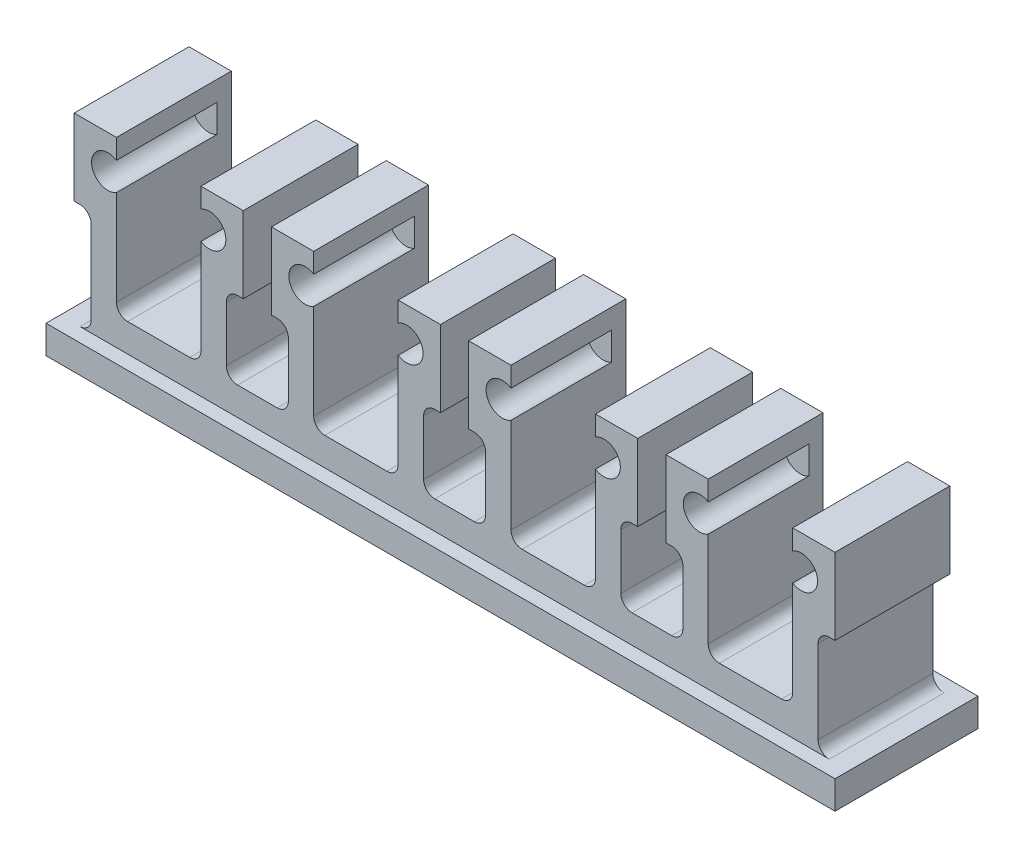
ISO-10303-21;
HEADER;
FILE_DESCRIPTION(('STEP AP214'),'2;1');
FILE_NAME('part.step','',(''),(''),'','','');
FILE_SCHEMA(('AUTOMOTIVE_DESIGN { 1 0 10303 214 1 1 1 1 }'));
ENDSEC;
DATA;
#1=APPLICATION_CONTEXT('core data for automotive mechanical design processes');
#2=APPLICATION_PROTOCOL_DEFINITION('international standard','automotive_design',2000,#1);
#3=PRODUCT_CONTEXT('',#1,'mechanical');
#4=PRODUCT('Part','Part','',(#3));
#5=PRODUCT_RELATED_PRODUCT_CATEGORY('part','',(#4));
#6=PRODUCT_DEFINITION_FORMATION('','',#4);
#7=PRODUCT_DEFINITION_CONTEXT('part definition',#1,'design');
#8=PRODUCT_DEFINITION('design','',#6,#7);
#9=PRODUCT_DEFINITION_SHAPE('','',#8);
#10=(LENGTH_UNIT() NAMED_UNIT(*) SI_UNIT(.MILLI.,.METRE.));
#11=(NAMED_UNIT(*) PLANE_ANGLE_UNIT() SI_UNIT($,.RADIAN.));
#12=(NAMED_UNIT(*) SI_UNIT($,.STERADIAN.) SOLID_ANGLE_UNIT());
#13=UNCERTAINTY_MEASURE_WITH_UNIT(LENGTH_MEASURE(1.E-05),#10,'distance_accuracy_value','');
#14=(GEOMETRIC_REPRESENTATION_CONTEXT(3) GLOBAL_UNCERTAINTY_ASSIGNED_CONTEXT((#13)) GLOBAL_UNIT_ASSIGNED_CONTEXT((#10,
#11,#12)) REPRESENTATION_CONTEXT('',''));
#15=CARTESIAN_POINT('',(0.,0.,0.));
#16=DIRECTION('',(0.,0.,1.));
#17=DIRECTION('',(1.,0.,0.));
#18=AXIS2_PLACEMENT_3D('',#15,#16,#17);
#19=CARTESIAN_POINT('',(-30.40625,2.79375,-7.15));
#20=DIRECTION('',(0.,0.,-1.));
#21=DIRECTION('',(-1.,0.,0.));
#22=AXIS2_PLACEMENT_3D('',#19,#20,#21);
#23=PLANE('',#22);
#24=CARTESIAN_POINT('',(3.79375,2.6494432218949,-7.15));
#25=DIRECTION('',(0.,0.,1.));
#26=DIRECTION('',(-1.,0.,0.));
#27=AXIS2_PLACEMENT_3D('',#24,#25,#26);
#28=CIRCLE('',#27,0.79375);
#29=CARTESIAN_POINT('',(3.,2.6494432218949,-7.15));
#30=VERTEX_POINT('',#29);
#31=CARTESIAN_POINT('',(3.79374999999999,1.8556932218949,-7.15));
#32=VERTEX_POINT('',#31);
#33=EDGE_CURVE('E51',#30,#32,#28,.T.);
#34=ORIENTED_EDGE('',*,*,#33,.F.);
#35=DIRECTION('',(0.,1.,0.));
#36=VECTOR('',#35,1.);
#37=CARTESIAN_POINT('',(3.,2.79374999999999,-7.15));
#38=LINE('',#37,#36);
#39=CARTESIAN_POINT('',(3.,2.79375,-7.15));
#40=VERTEX_POINT('',#39);
#41=EDGE_CURVE('E11',#30,#40,#38,.T.);
#42=ORIENTED_EDGE('',*,*,#41,.T.);
#43=CARTESIAN_POINT('',(3.79375,2.79375,-7.15));
#44=DIRECTION('',(0.,0.,1.));
#45=DIRECTION('',(-1.,0.,0.));
#46=AXIS2_PLACEMENT_3D('',#43,#44,#45);
#47=CIRCLE('',#46,0.79375);
#48=CARTESIAN_POINT('',(3.79375,2.,-7.15));
#49=VERTEX_POINT('',#48);
#50=EDGE_CURVE('E926',#40,#49,#47,.T.);
#51=ORIENTED_EDGE('',*,*,#50,.T.);
#52=DIRECTION('',(1.,0.,0.));
#53=VECTOR('',#52,1.);
#54=CARTESIAN_POINT('',(3.79375,2.,-7.15));
#55=LINE('',#54,#53);
#56=CARTESIAN_POINT('',(8.20625,2.,-7.15));
#57=VERTEX_POINT('',#56);
#58=EDGE_CURVE('E929',#49,#57,#55,.T.);
#59=ORIENTED_EDGE('',*,*,#58,.T.);
#60=CARTESIAN_POINT('',(8.20625,2.79375,-7.15));
#61=DIRECTION('',(0.,0.,1.));
#62=DIRECTION('',(-1.,0.,0.));
#63=AXIS2_PLACEMENT_3D('',#60,#61,#62);
#64=CIRCLE('',#63,0.79375);
#65=CARTESIAN_POINT('',(9.,2.79375,-7.15));
#66=VERTEX_POINT('',#65);
#67=EDGE_CURVE('E932',#57,#66,#64,.T.);
#68=ORIENTED_EDGE('',*,*,#67,.T.);
#69=DIRECTION('',(0.,1.,0.));
#70=VECTOR('',#69,1.);
#71=CARTESIAN_POINT('',(9.,10.9454280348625,-7.15));
#72=LINE('',#71,#70);
#73=CARTESIAN_POINT('',(9.,2.64944322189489,-7.15));
#74=VERTEX_POINT('',#73);
#75=EDGE_CURVE('E678',#74,#66,#72,.T.);
#76=ORIENTED_EDGE('',*,*,#75,.F.);
#77=CARTESIAN_POINT('',(8.20625,2.64944322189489,-7.15));
#78=DIRECTION('',(0.,0.,1.));
#79=DIRECTION('',(-1.,0.,0.));
#80=AXIS2_PLACEMENT_3D('',#77,#78,#79);
#81=CIRCLE('',#80,0.793749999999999);
#82=CARTESIAN_POINT('',(8.20625,1.85569322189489,-7.15));
#83=VERTEX_POINT('',#82);
#84=EDGE_CURVE('E674',#83,#74,#81,.T.);
#85=ORIENTED_EDGE('',*,*,#84,.F.);
#86=DIRECTION('',(1.,0.,0.));
#87=VECTOR('',#86,1.);
#88=CARTESIAN_POINT('',(3.79375,1.8556932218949,-7.15));
#89=LINE('',#88,#87);
#90=EDGE_CURVE('E56',#32,#83,#89,.T.);
#91=ORIENTED_EDGE('',*,*,#90,.F.);
#92=EDGE_LOOP('',(#34,#42,#51,#59,#68,#76,#85,#91));
#93=FACE_BOUND('',#92,.T.);
#94=ADVANCED_FACE('F37',(#93),#23,.T.);
#95=CARTESIAN_POINT('',(11.59375,0.79375,0.));
#96=DIRECTION('',(0.,0.,1.));
#97=DIRECTION('',(1.,0.,0.));
#98=AXIS2_PLACEMENT_3D('',#95,#96,#97);
#99=CYLINDRICAL_SURFACE('',#98,0.79375);
#100=DIRECTION('',(0.,0.,-1.));
#101=VECTOR('',#100,1.);
#102=CARTESIAN_POINT('',(10.8,0.79375,0.));
#103=LINE('',#102,#101);
#104=CARTESIAN_POINT('',(10.8,0.793749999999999,0.));
#105=VERTEX_POINT('',#104);
#106=CARTESIAN_POINT('',(10.8,0.793749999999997,-8.15));
#107=VERTEX_POINT('',#106);
#108=EDGE_CURVE('E1361',#105,#107,#103,.T.);
#109=ORIENTED_EDGE('',*,*,#108,.F.);
#110=CARTESIAN_POINT('',(11.59375,0.79375,0.));
#111=DIRECTION('',(0.,0.,-1.));
#112=DIRECTION('',(-1.,0.,0.));
#113=AXIS2_PLACEMENT_3D('',#110,#111,#112);
#114=CIRCLE('',#113,0.79375);
#115=CARTESIAN_POINT('',(11.59375,0.,0.));
#116=VERTEX_POINT('',#115);
#117=EDGE_CURVE('E45',#105,#116,#114,.F.);
#118=ORIENTED_EDGE('',*,*,#117,.T.);
#119=DIRECTION('',(0.,0.,-1.));
#120=VECTOR('',#119,1.);
#121=CARTESIAN_POINT('',(11.59375,0.,0.));
#122=LINE('',#121,#120);
#123=CARTESIAN_POINT('',(11.59375,0.,-8.15));
#124=VERTEX_POINT('',#123);
#125=EDGE_CURVE('E1363',#124,#116,#122,.F.);
#126=ORIENTED_EDGE('',*,*,#125,.F.);
#127=CARTESIAN_POINT('',(11.59375,0.793749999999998,-8.15));
#128=DIRECTION('',(0.,0.,1.));
#129=DIRECTION('',(-1.,0.,0.));
#130=AXIS2_PLACEMENT_3D('',#127,#128,#129);
#131=CIRCLE('',#130,0.793749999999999);
#132=EDGE_CURVE('E845',#107,#124,#131,.T.);
#133=ORIENTED_EDGE('',*,*,#132,.F.);
#134=EDGE_LOOP('',(#109,#118,#126,#133));
#135=FACE_BOUND('',#134,.T.);
#136=ADVANCED_FACE('F39',(#135),#99,.F.);
#137=CARTESIAN_POINT('',(-41.59375,0.79375,0.));
#138=DIRECTION('',(0.,0.,-1.));
#139=DIRECTION('',(-1.,0.,0.));
#140=AXIS2_PLACEMENT_3D('',#137,#138,#139);
#141=CYLINDRICAL_SURFACE('',#140,0.79375);
#142=DIRECTION('',(0.,0.,1.));
#143=VECTOR('',#142,1.);
#144=CARTESIAN_POINT('',(-40.8,0.79375,0.));
#145=LINE('',#144,#143);
#146=CARTESIAN_POINT('',(-40.8,0.79375,-8.15));
#147=VERTEX_POINT('',#146);
#148=CARTESIAN_POINT('',(-40.8,0.793749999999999,0.));
#149=VERTEX_POINT('',#148);
#150=EDGE_CURVE('E1354',#147,#149,#145,.T.);
#151=ORIENTED_EDGE('',*,*,#150,.F.);
#152=CARTESIAN_POINT('',(-41.59375,0.79375,-8.15));
#153=DIRECTION('',(0.,0.,1.));
#154=DIRECTION('',(-1.,0.,0.));
#155=AXIS2_PLACEMENT_3D('',#152,#153,#154);
#156=CIRCLE('',#155,0.793750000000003);
#157=CARTESIAN_POINT('',(-41.59375,0.,-8.15));
#158=VERTEX_POINT('',#157);
#159=EDGE_CURVE('E851',#158,#147,#156,.T.);
#160=ORIENTED_EDGE('',*,*,#159,.F.);
#161=DIRECTION('',(0.,0.,1.));
#162=VECTOR('',#161,1.);
#163=CARTESIAN_POINT('',(-41.59375,0.,0.));
#164=LINE('',#163,#162);
#165=CARTESIAN_POINT('',(-41.59375,0.,0.));
#166=VERTEX_POINT('',#165);
#167=EDGE_CURVE('E1357',#166,#158,#164,.F.);
#168=ORIENTED_EDGE('',*,*,#167,.F.);
#169=CARTESIAN_POINT('',(-41.59375,0.79375,0.));
#170=DIRECTION('',(0.,0.,-1.));
#171=DIRECTION('',(-1.,0.,0.));
#172=AXIS2_PLACEMENT_3D('',#169,#170,#171);
#173=CIRCLE('',#172,0.79375);
#174=EDGE_CURVE('E1359',#166,#149,#173,.F.);
#175=ORIENTED_EDGE('',*,*,#174,.T.);
#176=EDGE_LOOP('',(#151,#160,#168,#175));
#177=FACE_BOUND('',#176,.T.);
#178=ADVANCED_FACE('F1434',(#177),#141,.F.);
#179=CARTESIAN_POINT('',(-27.59375,2.79375,0.));
#180=DIRECTION('',(0.,0.,-1.));
#181=DIRECTION('',(-1.,0.,0.));
#182=AXIS2_PLACEMENT_3D('',#179,#180,#181);
#183=CYLINDRICAL_SURFACE('',#182,0.79375);
#184=DIRECTION('',(0.,0.,1.));
#185=VECTOR('',#184,1.);
#186=CARTESIAN_POINT('',(-26.8,2.79375,0.));
#187=LINE('',#186,#185);
#188=CARTESIAN_POINT('',(-26.8,2.79375,-8.15));
#189=VERTEX_POINT('',#188);
#190=CARTESIAN_POINT('',(-26.8,2.79375,0.));
#191=VERTEX_POINT('',#190);
#192=EDGE_CURVE('E1347',#189,#191,#187,.T.);
#193=ORIENTED_EDGE('',*,*,#192,.F.);
#194=CARTESIAN_POINT('',(-27.59375,2.79375,-8.15));
#195=DIRECTION('',(0.,0.,1.));
#196=DIRECTION('',(-1.,0.,0.));
#197=AXIS2_PLACEMENT_3D('',#194,#195,#196);
#198=CIRCLE('',#197,0.793749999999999);
#199=CARTESIAN_POINT('',(-27.59375,2.,-8.15));
#200=VERTEX_POINT('',#199);
#201=EDGE_CURVE('E693',#200,#189,#198,.T.);
#202=ORIENTED_EDGE('',*,*,#201,.F.);
#203=DIRECTION('',(0.,0.,1.));
#204=VECTOR('',#203,1.);
#205=CARTESIAN_POINT('',(-27.59375,2.,0.));
#206=LINE('',#205,#204);
#207=CARTESIAN_POINT('',(-27.59375,2.,0.));
#208=VERTEX_POINT('',#207);
#209=EDGE_CURVE('E1350',#208,#200,#206,.F.);
#210=ORIENTED_EDGE('',*,*,#209,.F.);
#211=CARTESIAN_POINT('',(-27.59375,2.79375,0.));
#212=DIRECTION('',(0.,0.,-1.));
#213=DIRECTION('',(-1.,0.,0.));
#214=AXIS2_PLACEMENT_3D('',#211,#212,#213);
#215=CIRCLE('',#214,0.79375);
#216=EDGE_CURVE('E1352',#208,#191,#215,.F.);
#217=ORIENTED_EDGE('',*,*,#216,.T.);
#218=EDGE_LOOP('',(#193,#202,#210,#217));
#219=FACE_BOUND('',#218,.T.);
#220=ADVANCED_FACE('F1733',(#219),#183,.F.);
#221=CARTESIAN_POINT('',(-13.59375,2.79375,0.));
#222=DIRECTION('',(0.,0.,-1.));
#223=DIRECTION('',(-1.,0.,0.));
#224=AXIS2_PLACEMENT_3D('',#221,#222,#223);
#225=CYLINDRICAL_SURFACE('',#224,0.79375);
#226=DIRECTION('',(0.,0.,1.));
#227=VECTOR('',#226,1.);
#228=CARTESIAN_POINT('',(-12.8,2.79375,0.));
#229=LINE('',#228,#227);
#230=CARTESIAN_POINT('',(-12.8,2.79375,-8.15));
#231=VERTEX_POINT('',#230);
#232=CARTESIAN_POINT('',(-12.8,2.79375,0.));
#233=VERTEX_POINT('',#232);
#234=EDGE_CURVE('E1340',#231,#233,#229,.T.);
#235=ORIENTED_EDGE('',*,*,#234,.F.);
#236=CARTESIAN_POINT('',(-13.59375,2.79375,-8.15));
#237=DIRECTION('',(0.,0.,1.));
#238=DIRECTION('',(-1.,0.,0.));
#239=AXIS2_PLACEMENT_3D('',#236,#237,#238);
#240=CIRCLE('',#239,0.793749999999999);
#241=CARTESIAN_POINT('',(-13.59375,2.,-8.15));
#242=VERTEX_POINT('',#241);
#243=EDGE_CURVE('E747',#242,#231,#240,.T.);
#244=ORIENTED_EDGE('',*,*,#243,.F.);
#245=DIRECTION('',(0.,0.,1.));
#246=VECTOR('',#245,1.);
#247=CARTESIAN_POINT('',(-13.59375,2.,0.));
#248=LINE('',#247,#246);
#249=CARTESIAN_POINT('',(-13.59375,2.,0.));
#250=VERTEX_POINT('',#249);
#251=EDGE_CURVE('E1343',#250,#242,#248,.F.);
#252=ORIENTED_EDGE('',*,*,#251,.F.);
#253=CARTESIAN_POINT('',(-13.59375,2.79375,0.));
#254=DIRECTION('',(0.,0.,-1.));
#255=DIRECTION('',(-1.,0.,0.));
#256=AXIS2_PLACEMENT_3D('',#253,#254,#255);
#257=CIRCLE('',#256,0.79375);
#258=EDGE_CURVE('E1345',#250,#233,#257,.F.);
#259=ORIENTED_EDGE('',*,*,#258,.T.);
#260=EDGE_LOOP('',(#235,#244,#252,#259));
#261=FACE_BOUND('',#260,.T.);
#262=ADVANCED_FACE('F1729',(#261),#225,.F.);
#263=CARTESIAN_POINT('',(0.40625,2.79375,0.));
#264=DIRECTION('',(0.,0.,-1.));
#265=DIRECTION('',(-1.,0.,0.));
#266=AXIS2_PLACEMENT_3D('',#263,#264,#265);
#267=CYLINDRICAL_SURFACE('',#266,0.79375);
#268=DIRECTION('',(0.,0.,1.));
#269=VECTOR('',#268,1.);
#270=CARTESIAN_POINT('',(1.2,2.79375,0.));
#271=LINE('',#270,#269);
#272=CARTESIAN_POINT('',(1.19999999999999,2.79375,-8.15));
#273=VERTEX_POINT('',#272);
#274=CARTESIAN_POINT('',(1.2,2.79375,0.));
#275=VERTEX_POINT('',#274);
#276=EDGE_CURVE('E1333',#273,#275,#271,.T.);
#277=ORIENTED_EDGE('',*,*,#276,.F.);
#278=CARTESIAN_POINT('',(0.406249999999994,2.79375,-8.15));
#279=DIRECTION('',(0.,0.,1.));
#280=DIRECTION('',(-1.,0.,0.));
#281=AXIS2_PLACEMENT_3D('',#278,#279,#280);
#282=CIRCLE('',#281,0.79375);
#283=CARTESIAN_POINT('',(0.406249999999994,2.,-8.15));
#284=VERTEX_POINT('',#283);
#285=EDGE_CURVE('E801',#284,#273,#282,.T.);
#286=ORIENTED_EDGE('',*,*,#285,.F.);
#287=DIRECTION('',(0.,0.,1.));
#288=VECTOR('',#287,1.);
#289=CARTESIAN_POINT('',(0.40625,2.,0.));
#290=LINE('',#289,#288);
#291=CARTESIAN_POINT('',(0.40625,2.,0.));
#292=VERTEX_POINT('',#291);
#293=EDGE_CURVE('E1336',#292,#284,#290,.F.);
#294=ORIENTED_EDGE('',*,*,#293,.F.);
#295=CARTESIAN_POINT('',(0.40625,2.79375,0.));
#296=DIRECTION('',(0.,0.,-1.));
#297=DIRECTION('',(-1.,0.,0.));
#298=AXIS2_PLACEMENT_3D('',#295,#296,#297);
#299=CIRCLE('',#298,0.79375);
#300=EDGE_CURVE('E1338',#292,#275,#299,.F.);
#301=ORIENTED_EDGE('',*,*,#300,.T.);
#302=EDGE_LOOP('',(#277,#286,#294,#301));
#303=FACE_BOUND('',#302,.T.);
#304=ADVANCED_FACE('F1725',(#303),#267,.F.);
#305=CARTESIAN_POINT('',(-30.40625,2.79375,0.));
#306=DIRECTION('',(0.,0.,1.));
#307=DIRECTION('',(1.,0.,0.));
#308=AXIS2_PLACEMENT_3D('',#305,#306,#307);
#309=CYLINDRICAL_SURFACE('',#308,0.79375);
#310=DIRECTION('',(0.,0.,-1.));
#311=VECTOR('',#310,1.);
#312=CARTESIAN_POINT('',(-31.2,2.79375,0.));
#313=LINE('',#312,#311);
#314=CARTESIAN_POINT('',(-31.2,2.79375,0.));
#315=VERTEX_POINT('',#314);
#316=CARTESIAN_POINT('',(-31.2,2.79375,-8.15));
#317=VERTEX_POINT('',#316);
#318=EDGE_CURVE('E1326',#315,#317,#313,.T.);
#319=ORIENTED_EDGE('',*,*,#318,.F.);
#320=CARTESIAN_POINT('',(-30.40625,2.79375,0.));
#321=DIRECTION('',(0.,0.,-1.));
#322=DIRECTION('',(-1.,0.,0.));
#323=AXIS2_PLACEMENT_3D('',#320,#321,#322);
#324=CIRCLE('',#323,0.79375);
#325=CARTESIAN_POINT('',(-30.40625,2.,0.));
#326=VERTEX_POINT('',#325);
#327=EDGE_CURVE('E1331',#315,#326,#324,.F.);
#328=ORIENTED_EDGE('',*,*,#327,.T.);
#329=DIRECTION('',(0.,0.,-1.));
#330=VECTOR('',#329,1.);
#331=CARTESIAN_POINT('',(-30.40625,2.,0.));
#332=LINE('',#331,#330);
#333=CARTESIAN_POINT('',(-30.40625,2.,-8.15));
#334=VERTEX_POINT('',#333);
#335=EDGE_CURVE('E1328',#334,#326,#332,.F.);
#336=ORIENTED_EDGE('',*,*,#335,.F.);
#337=CARTESIAN_POINT('',(-30.40625,2.79375,-8.15));
#338=DIRECTION('',(0.,0.,1.));
#339=DIRECTION('',(-1.,0.,0.));
#340=AXIS2_PLACEMENT_3D('',#337,#338,#339);
#341=CIRCLE('',#340,0.793749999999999);
#342=EDGE_CURVE('E687',#317,#334,#341,.T.);
#343=ORIENTED_EDGE('',*,*,#342,.F.);
#344=EDGE_LOOP('',(#319,#328,#336,#343));
#345=FACE_BOUND('',#344,.T.);
#346=ADVANCED_FACE('F1721',(#345),#309,.F.);
#347=CARTESIAN_POINT('',(-16.40625,2.79375,0.));
#348=DIRECTION('',(0.,0.,1.));
#349=DIRECTION('',(1.,0.,0.));
#350=AXIS2_PLACEMENT_3D('',#347,#348,#349);
#351=CYLINDRICAL_SURFACE('',#350,0.79375);
#352=DIRECTION('',(0.,0.,-1.));
#353=VECTOR('',#352,1.);
#354=CARTESIAN_POINT('',(-17.2,2.79375,0.));
#355=LINE('',#354,#353);
#356=CARTESIAN_POINT('',(-17.2,2.79375,0.));
#357=VERTEX_POINT('',#356);
#358=CARTESIAN_POINT('',(-17.2,2.79375,-8.15));
#359=VERTEX_POINT('',#358);
#360=EDGE_CURVE('E1319',#357,#359,#355,.T.);
#361=ORIENTED_EDGE('',*,*,#360,.F.);
#362=CARTESIAN_POINT('',(-16.40625,2.79375,0.));
#363=DIRECTION('',(0.,0.,-1.));
#364=DIRECTION('',(-1.,0.,0.));
#365=AXIS2_PLACEMENT_3D('',#362,#363,#364);
#366=CIRCLE('',#365,0.79375);
#367=CARTESIAN_POINT('',(-16.40625,2.,0.));
#368=VERTEX_POINT('',#367);
#369=EDGE_CURVE('E1324',#357,#368,#366,.F.);
#370=ORIENTED_EDGE('',*,*,#369,.T.);
#371=DIRECTION('',(0.,0.,-1.));
#372=VECTOR('',#371,1.);
#373=CARTESIAN_POINT('',(-16.40625,2.,0.));
#374=LINE('',#373,#372);
#375=CARTESIAN_POINT('',(-16.40625,2.,-8.15));
#376=VERTEX_POINT('',#375);
#377=EDGE_CURVE('E1321',#376,#368,#374,.F.);
#378=ORIENTED_EDGE('',*,*,#377,.F.);
#379=CARTESIAN_POINT('',(-16.40625,2.79375,-8.15));
#380=DIRECTION('',(0.,0.,1.));
#381=DIRECTION('',(-1.,0.,0.));
#382=AXIS2_PLACEMENT_3D('',#379,#380,#381);
#383=CIRCLE('',#382,0.793749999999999);
#384=EDGE_CURVE('E741',#359,#376,#383,.T.);
#385=ORIENTED_EDGE('',*,*,#384,.F.);
#386=EDGE_LOOP('',(#361,#370,#378,#385));
#387=FACE_BOUND('',#386,.T.);
#388=ADVANCED_FACE('F1717',(#387),#351,.F.);
#389=CARTESIAN_POINT('',(-2.40625,2.79375,0.));
#390=DIRECTION('',(0.,0.,1.));
#391=DIRECTION('',(1.,0.,0.));
#392=AXIS2_PLACEMENT_3D('',#389,#390,#391);
#393=CYLINDRICAL_SURFACE('',#392,0.79375);
#394=DIRECTION('',(0.,0.,-1.));
#395=VECTOR('',#394,1.);
#396=CARTESIAN_POINT('',(-3.2,2.79375,0.));
#397=LINE('',#396,#395);
#398=CARTESIAN_POINT('',(-3.2,2.79375,0.));
#399=VERTEX_POINT('',#398);
#400=CARTESIAN_POINT('',(-3.20000000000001,2.79375,-8.15));
#401=VERTEX_POINT('',#400);
#402=EDGE_CURVE('E1312',#399,#401,#397,.T.);
#403=ORIENTED_EDGE('',*,*,#402,.F.);
#404=CARTESIAN_POINT('',(-2.40625,2.79375,0.));
#405=DIRECTION('',(0.,0.,-1.));
#406=DIRECTION('',(-1.,0.,0.));
#407=AXIS2_PLACEMENT_3D('',#404,#405,#406);
#408=CIRCLE('',#407,0.79375);
#409=CARTESIAN_POINT('',(-2.40625,2.,0.));
#410=VERTEX_POINT('',#409);
#411=EDGE_CURVE('E1317',#399,#410,#408,.F.);
#412=ORIENTED_EDGE('',*,*,#411,.T.);
#413=DIRECTION('',(0.,0.,-1.));
#414=VECTOR('',#413,1.);
#415=CARTESIAN_POINT('',(-2.40625,2.,0.));
#416=LINE('',#415,#414);
#417=CARTESIAN_POINT('',(-2.40625000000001,2.,-8.15));
#418=VERTEX_POINT('',#417);
#419=EDGE_CURVE('E1314',#418,#410,#416,.F.);
#420=ORIENTED_EDGE('',*,*,#419,.F.);
#421=CARTESIAN_POINT('',(-2.40625,2.79375,-8.15));
#422=DIRECTION('',(0.,0.,1.));
#423=DIRECTION('',(-1.,0.,0.));
#424=AXIS2_PLACEMENT_3D('',#421,#422,#423);
#425=CIRCLE('',#424,0.79375);
#426=EDGE_CURVE('E795',#401,#418,#425,.T.);
#427=ORIENTED_EDGE('',*,*,#426,.F.);
#428=EDGE_LOOP('',(#403,#412,#420,#427));
#429=FACE_BOUND('',#428,.T.);
#430=ADVANCED_FACE('F1661',(#429),#393,.F.);
#431=CARTESIAN_POINT('',(-3.6,2.,-6.3));
#432=DIRECTION('',(0.,-1.,0.));
#433=DIRECTION('',(0.,0.,-1.));
#434=AXIS2_PLACEMENT_3D('',#431,#432,#433);
#435=PLANE('',#434);
#436=DIRECTION('',(1.,0.,0.));
#437=VECTOR('',#436,1.);
#438=CARTESIAN_POINT('',(-3.6,2.,0.));
#439=LINE('',#438,#437);
#440=EDGE_CURVE('E1220',#410,#292,#439,.T.);
#441=ORIENTED_EDGE('',*,*,#440,.T.);
#442=ORIENTED_EDGE('',*,*,#293,.T.);
#443=DIRECTION('',(1.,0.,0.));
#444=VECTOR('',#443,1.);
#445=CARTESIAN_POINT('',(-2.40625000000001,2.,-8.15));
#446=LINE('',#445,#444);
#447=EDGE_CURVE('E798',#418,#284,#446,.T.);
#448=ORIENTED_EDGE('',*,*,#447,.F.);
#449=ORIENTED_EDGE('',*,*,#419,.T.);
#450=EDGE_LOOP('',(#441,#442,#448,#449));
#451=FACE_BOUND('',#450,.T.);
#452=ADVANCED_FACE('F1657',(#451),#435,.F.);
#453=CARTESIAN_POINT('',(1.2,7.5,0.));
#454=DIRECTION('',(1.,0.,0.));
#455=DIRECTION('',(0.,0.,-1.));
#456=AXIS2_PLACEMENT_3D('',#453,#454,#455);
#457=PLANE('',#456);
#458=DIRECTION('',(0.,0.,-1.));
#459=VECTOR('',#458,1.);
#460=CARTESIAN_POINT('',(1.2,6.70625,0.));
#461=LINE('',#460,#459);
#462=CARTESIAN_POINT('',(1.2,6.70625,0.));
#463=VERTEX_POINT('',#462);
#464=CARTESIAN_POINT('',(1.19999999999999,6.70625,-8.15));
#465=VERTEX_POINT('',#464);
#466=EDGE_CURVE('E1290',#463,#465,#461,.T.);
#467=ORIENTED_EDGE('',*,*,#466,.T.);
#468=DIRECTION('',(0.,1.,0.));
#469=VECTOR('',#468,1.);
#470=CARTESIAN_POINT('',(1.19999999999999,2.79375,-8.15));
#471=LINE('',#470,#469);
#472=EDGE_CURVE('E804',#273,#465,#471,.T.);
#473=ORIENTED_EDGE('',*,*,#472,.F.);
#474=ORIENTED_EDGE('',*,*,#276,.T.);
#475=DIRECTION('',(0.,-1.,0.));
#476=VECTOR('',#475,1.);
#477=CARTESIAN_POINT('',(1.2,7.5,0.));
#478=LINE('',#477,#476);
#479=EDGE_CURVE('E1235',#463,#275,#478,.T.);
#480=ORIENTED_EDGE('',*,*,#479,.F.);
#481=EDGE_LOOP('',(#467,#473,#474,#480));
#482=FACE_BOUND('',#481,.T.);
#483=ADVANCED_FACE('F1660',(#482),#457,.F.);
#484=CARTESIAN_POINT('',(3.79375,2.79375,-6.3));
#485=DIRECTION('',(0.,0.,-1.));
#486=DIRECTION('',(-1.,0.,0.));
#487=AXIS2_PLACEMENT_3D('',#484,#485,#486);
#488=CYLINDRICAL_SURFACE('',#487,0.79375);
#489=DIRECTION('',(0.,0.,-1.));
#490=VECTOR('',#489,1.);
#491=CARTESIAN_POINT('',(3.,2.79375,-6.3));
#492=LINE('',#491,#490);
#493=CARTESIAN_POINT('',(3.,2.79375,0.));
#494=VERTEX_POINT('',#493);
#495=EDGE_CURVE('E1304',#494,#40,#492,.T.);
#496=ORIENTED_EDGE('',*,*,#495,.F.);
#497=CARTESIAN_POINT('',(3.79375,2.79375,0.));
#498=DIRECTION('',(0.,0.,-1.));
#499=DIRECTION('',(-1.,0.,0.));
#500=AXIS2_PLACEMENT_3D('',#497,#498,#499);
#501=CIRCLE('',#500,0.79375);
#502=CARTESIAN_POINT('',(3.79375,2.,0.));
#503=VERTEX_POINT('',#502);
#504=EDGE_CURVE('E1310',#494,#503,#501,.F.);
#505=ORIENTED_EDGE('',*,*,#504,.T.);
#506=DIRECTION('',(0.,0.,-1.));
#507=VECTOR('',#506,1.);
#508=CARTESIAN_POINT('',(3.79375,2.,0.));
#509=LINE('',#508,#507);
#510=EDGE_CURVE('E1307',#49,#503,#509,.F.);
#511=ORIENTED_EDGE('',*,*,#510,.F.);
#512=ORIENTED_EDGE('',*,*,#50,.F.);
#513=EDGE_LOOP('',(#496,#505,#511,#512));
#514=FACE_BOUND('',#513,.T.);
#515=ADVANCED_FACE('F1673',(#514),#488,.F.);
#516=CARTESIAN_POINT('',(8.20625,2.79375,-6.3));
#517=DIRECTION('',(0.,0.,1.));
#518=DIRECTION('',(1.,0.,0.));
#519=AXIS2_PLACEMENT_3D('',#516,#517,#518);
#520=CYLINDRICAL_SURFACE('',#519,0.79375);
#521=DIRECTION('',(0.,0.,1.));
#522=VECTOR('',#521,1.);
#523=CARTESIAN_POINT('',(9.,2.79375,-6.3));
#524=LINE('',#523,#522);
#525=CARTESIAN_POINT('',(9.,2.79375,0.));
#526=VERTEX_POINT('',#525);
#527=EDGE_CURVE('E1297',#66,#526,#524,.T.);
#528=ORIENTED_EDGE('',*,*,#527,.F.);
#529=ORIENTED_EDGE('',*,*,#67,.F.);
#530=DIRECTION('',(0.,0.,1.));
#531=VECTOR('',#530,1.);
#532=CARTESIAN_POINT('',(8.20625,2.,0.));
#533=LINE('',#532,#531);
#534=CARTESIAN_POINT('',(8.20625,2.,0.));
#535=VERTEX_POINT('',#534);
#536=EDGE_CURVE('E1300',#535,#57,#533,.F.);
#537=ORIENTED_EDGE('',*,*,#536,.F.);
#538=CARTESIAN_POINT('',(8.20625,2.79375,0.));
#539=DIRECTION('',(0.,0.,-1.));
#540=DIRECTION('',(-1.,0.,0.));
#541=AXIS2_PLACEMENT_3D('',#538,#539,#540);
#542=CIRCLE('',#541,0.79375);
#543=EDGE_CURVE('E1302',#535,#526,#542,.F.);
#544=ORIENTED_EDGE('',*,*,#543,.T.);
#545=EDGE_LOOP('',(#528,#529,#537,#544));
#546=FACE_BOUND('',#545,.T.);
#547=ADVANCED_FACE('F1707',(#546),#520,.F.);
#548=CARTESIAN_POINT('',(0.40625,6.70625,0.));
#549=DIRECTION('',(0.,0.,-1.));
#550=DIRECTION('',(-1.,0.,0.));
#551=AXIS2_PLACEMENT_3D('',#548,#549,#550);
#552=CYLINDRICAL_SURFACE('',#551,0.79375);
#553=ORIENTED_EDGE('',*,*,#466,.F.);
#554=CARTESIAN_POINT('',(0.40625,6.70625,0.));
#555=DIRECTION('',(0.,0.,-1.));
#556=DIRECTION('',(-1.,0.,0.));
#557=AXIS2_PLACEMENT_3D('',#554,#555,#556);
#558=CIRCLE('',#557,0.79375);
#559=CARTESIAN_POINT('',(0.40625,7.5,0.));
#560=VERTEX_POINT('',#559);
#561=EDGE_CURVE('E1295',#463,#560,#558,.F.);
#562=ORIENTED_EDGE('',*,*,#561,.T.);
#563=DIRECTION('',(0.,0.,-1.));
#564=VECTOR('',#563,1.);
#565=CARTESIAN_POINT('',(0.40625,7.5,-6.3));
#566=LINE('',#565,#564);
#567=CARTESIAN_POINT('',(0.406249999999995,7.5,-8.15));
#568=VERTEX_POINT('',#567);
#569=EDGE_CURVE('E1292',#568,#560,#566,.F.);
#570=ORIENTED_EDGE('',*,*,#569,.F.);
#571=CARTESIAN_POINT('',(0.406249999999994,6.70625,-8.15));
#572=DIRECTION('',(0.,0.,1.));
#573=DIRECTION('',(-1.,0.,0.));
#574=AXIS2_PLACEMENT_3D('',#571,#572,#573);
#575=CIRCLE('',#574,0.79375);
#576=EDGE_CURVE('E807',#465,#568,#575,.T.);
#577=ORIENTED_EDGE('',*,*,#576,.F.);
#578=EDGE_LOOP('',(#553,#562,#570,#577));
#579=FACE_BOUND('',#578,.T.);
#580=ADVANCED_FACE('F1704',(#579),#552,.F.);
#581=CARTESIAN_POINT('',(11.59375,6.70625,-6.3));
#582=DIRECTION('',(0.,0.,1.));
#583=DIRECTION('',(1.,0.,0.));
#584=AXIS2_PLACEMENT_3D('',#581,#582,#583);
#585=CYLINDRICAL_SURFACE('',#584,0.79375);
#586=DIRECTION('',(0.,0.,-1.));
#587=VECTOR('',#586,1.);
#588=CARTESIAN_POINT('',(11.59375,7.5,-6.3));
#589=LINE('',#588,#587);
#590=CARTESIAN_POINT('',(11.59375,7.5,0.));
#591=VERTEX_POINT('',#590);
#592=CARTESIAN_POINT('',(11.59375,7.5,-8.15));
#593=VERTEX_POINT('',#592);
#594=EDGE_CURVE('E1283',#591,#593,#589,.T.);
#595=ORIENTED_EDGE('',*,*,#594,.F.);
#596=CARTESIAN_POINT('',(11.59375,6.70625,0.));
#597=DIRECTION('',(0.,0.,-1.));
#598=DIRECTION('',(-1.,0.,0.));
#599=AXIS2_PLACEMENT_3D('',#596,#597,#598);
#600=CIRCLE('',#599,0.79375);
#601=CARTESIAN_POINT('',(10.8,6.70625,0.));
#602=VERTEX_POINT('',#601);
#603=EDGE_CURVE('E1288',#591,#602,#600,.F.);
#604=ORIENTED_EDGE('',*,*,#603,.T.);
#605=DIRECTION('',(0.,0.,-1.));
#606=VECTOR('',#605,1.);
#607=CARTESIAN_POINT('',(10.8,6.70625,-6.3));
#608=LINE('',#607,#606);
#609=CARTESIAN_POINT('',(10.8,6.70625,-8.15));
#610=VERTEX_POINT('',#609);
#611=EDGE_CURVE('E1285',#610,#602,#608,.F.);
#612=ORIENTED_EDGE('',*,*,#611,.F.);
#613=CARTESIAN_POINT('',(11.59375,6.70625,-8.15));
#614=DIRECTION('',(0.,0.,1.));
#615=DIRECTION('',(-1.,0.,0.));
#616=AXIS2_PLACEMENT_3D('',#613,#614,#615);
#617=CIRCLE('',#616,0.793750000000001);
#618=EDGE_CURVE('E839',#593,#610,#617,.T.);
#619=ORIENTED_EDGE('',*,*,#618,.F.);
#620=EDGE_LOOP('',(#595,#604,#612,#619));
#621=FACE_BOUND('',#620,.T.);
#622=ADVANCED_FACE('F1387',(#621),#585,.F.);
#623=CARTESIAN_POINT('',(0.,12.92,0.));
#624=DIRECTION('',(1.,0.,0.));
#625=DIRECTION('',(0.,0.,-1.));
#626=AXIS2_PLACEMENT_3D('',#623,#624,#625);
#627=PLANE('',#626);
#628=DIRECTION('',(0.,0.,-1.));
#629=VECTOR('',#628,1.);
#630=CARTESIAN_POINT('',(0.,7.5,0.));
#631=LINE('',#630,#629);
#632=CARTESIAN_POINT('',(0.,7.5,0.));
#633=VERTEX_POINT('',#632);
#634=CARTESIAN_POINT('',(0.,7.5,-8.15));
#635=VERTEX_POINT('',#634);
#636=EDGE_CURVE('E1231',#633,#635,#631,.T.);
#637=ORIENTED_EDGE('',*,*,#636,.F.);
#638=DIRECTION('',(0.,-1.,0.));
#639=VECTOR('',#638,1.);
#640=CARTESIAN_POINT('',(0.,12.92,0.));
#641=LINE('',#640,#639);
#642=CARTESIAN_POINT('',(0.,12.92,0.));
#643=VERTEX_POINT('',#642);
#644=EDGE_CURVE('E1270',#643,#633,#641,.T.);
#645=ORIENTED_EDGE('',*,*,#644,.F.);
#646=DIRECTION('',(0.,0.,1.));
#647=VECTOR('',#646,1.);
#648=CARTESIAN_POINT('',(0.,12.92,0.));
#649=LINE('',#648,#647);
#650=CARTESIAN_POINT('',(0.,12.92,-8.15));
#651=VERTEX_POINT('',#650);
#652=EDGE_CURVE('E1258',#651,#643,#649,.T.);
#653=ORIENTED_EDGE('',*,*,#652,.F.);
#654=DIRECTION('',(0.,1.,0.));
#655=VECTOR('',#654,1.);
#656=CARTESIAN_POINT('',(0.,7.5,-8.15));
#657=LINE('',#656,#655);
#658=EDGE_CURVE('E813',#635,#651,#657,.T.);
#659=ORIENTED_EDGE('',*,*,#658,.F.);
#660=EDGE_LOOP('',(#637,#645,#653,#659));
#661=FACE_BOUND('',#660,.T.);
#662=ADVANCED_FACE('F1698',(#661),#627,.F.);
#663=CARTESIAN_POINT('',(0.,12.92,-6.3));
#664=DIRECTION('',(0.,-1.,0.));
#665=DIRECTION('',(0.,0.,-1.));
#666=AXIS2_PLACEMENT_3D('',#663,#664,#665);
#667=PLANE('',#666);
#668=DIRECTION('',(1.,0.,0.));
#669=VECTOR('',#668,1.);
#670=CARTESIAN_POINT('',(0.,12.92,0.));
#671=LINE('',#670,#669);
#672=CARTESIAN_POINT('',(3.,12.92,0.));
#673=VERTEX_POINT('',#672);
#674=EDGE_CURVE('E1262',#643,#673,#671,.T.);
#675=ORIENTED_EDGE('',*,*,#674,.T.);
#676=DIRECTION('',(0.,0.,1.));
#677=VECTOR('',#676,1.);
#678=CARTESIAN_POINT('',(3.,12.92,-6.3));
#679=LINE('',#678,#677);
#680=CARTESIAN_POINT('',(3.,12.92,-8.15));
#681=VERTEX_POINT('',#680);
#682=EDGE_CURVE('E1243',#681,#673,#679,.T.);
#683=ORIENTED_EDGE('',*,*,#682,.F.);
#684=DIRECTION('',(1.,0.,0.));
#685=VECTOR('',#684,1.);
#686=CARTESIAN_POINT('',(0.,12.92,-8.15));
#687=LINE('',#686,#685);
#688=EDGE_CURVE('E816',#651,#681,#687,.T.);
#689=ORIENTED_EDGE('',*,*,#688,.F.);
#690=ORIENTED_EDGE('',*,*,#652,.T.);
#691=EDGE_LOOP('',(#675,#683,#689,#690));
#692=FACE_BOUND('',#691,.T.);
#693=ADVANCED_FACE('F1693',(#692),#667,.F.);
#694=CARTESIAN_POINT('',(0.,12.92,0.));
#695=DIRECTION('',(0.,0.,-1.));
#696=DIRECTION('',(-1.,0.,0.));
#697=AXIS2_PLACEMENT_3D('',#694,#695,#696);
#698=PLANE('',#697);
#699=DIRECTION('',(1.,0.,0.));
#700=VECTOR('',#699,1.);
#701=CARTESIAN_POINT('',(0.,0.,0.));
#702=LINE('',#701,#700);
#703=EDGE_CURVE('E1253',#166,#116,#702,.T.);
#704=ORIENTED_EDGE('',*,*,#703,.T.);
#705=ORIENTED_EDGE('',*,*,#117,.F.);
#706=DIRECTION('',(0.,-1.,0.));
#707=VECTOR('',#706,1.);
#708=CARTESIAN_POINT('',(10.8,7.5,0.));
#709=LINE('',#708,#707);
#710=EDGE_CURVE('E1228',#602,#105,#709,.T.);
#711=ORIENTED_EDGE('',*,*,#710,.F.);
#712=ORIENTED_EDGE('',*,*,#603,.F.);
#713=DIRECTION('',(-1.,0.,0.));
#714=VECTOR('',#713,1.);
#715=CARTESIAN_POINT('',(12.,7.5,0.));
#716=LINE('',#715,#714);
#717=CARTESIAN_POINT('',(12.,7.5,0.));
#718=VERTEX_POINT('',#717);
#719=EDGE_CURVE('E1225',#718,#591,#716,.T.);
#720=ORIENTED_EDGE('',*,*,#719,.F.);
#721=DIRECTION('',(0.,-1.,0.));
#722=VECTOR('',#721,1.);
#723=CARTESIAN_POINT('',(12.,12.92,0.));
#724=LINE('',#723,#722);
#725=CARTESIAN_POINT('',(12.,12.92,0.));
#726=VERTEX_POINT('',#725);
#727=EDGE_CURVE('E1267',#726,#718,#724,.T.);
#728=ORIENTED_EDGE('',*,*,#727,.F.);
#729=CARTESIAN_POINT('',(9.00000000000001,12.92,0.));
#730=VERTEX_POINT('',#729);
#731=EDGE_CURVE('E1261',#730,#726,#671,.T.);
#732=ORIENTED_EDGE('',*,*,#731,.F.);
#733=DIRECTION('',(0.,1.,0.));
#734=VECTOR('',#733,1.);
#735=CARTESIAN_POINT('',(9.,2.,0.));
#736=LINE('',#735,#734);
#737=CARTESIAN_POINT('',(9.,11.5097348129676,0.));
#738=VERTEX_POINT('',#737);
#739=EDGE_CURVE('E1254',#738,#730,#736,.T.);
#740=ORIENTED_EDGE('',*,*,#739,.F.);
#741=CARTESIAN_POINT('',(9.605,10.52,0.));
#742=DIRECTION('',(0.,0.,1.));
#743=DIRECTION('',(1.,0.,0.));
#744=AXIS2_PLACEMENT_3D('',#741,#742,#743);
#745=CIRCLE('',#744,1.16);
#746=CARTESIAN_POINT('',(9.,9.5302651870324,0.));
#747=VERTEX_POINT('',#746);
#748=EDGE_CURVE('E1238',#747,#738,#745,.T.);
#749=ORIENTED_EDGE('',*,*,#748,.F.);
#750=EDGE_CURVE('E1251',#526,#747,#736,.T.);
#751=ORIENTED_EDGE('',*,*,#750,.F.);
#752=ORIENTED_EDGE('',*,*,#543,.F.);
#753=DIRECTION('',(1.,0.,0.));
#754=VECTOR('',#753,1.);
#755=CARTESIAN_POINT('',(3.,2.,0.));
#756=LINE('',#755,#754);
#757=EDGE_CURVE('E1248',#503,#535,#756,.T.);
#758=ORIENTED_EDGE('',*,*,#757,.F.);
#759=ORIENTED_EDGE('',*,*,#504,.F.);
#760=DIRECTION('',(0.,1.,0.));
#761=VECTOR('',#760,1.);
#762=CARTESIAN_POINT('',(3.,2.,0.));
#763=LINE('',#762,#761);
#764=CARTESIAN_POINT('',(3.,9.53026518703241,0.));
#765=VERTEX_POINT('',#764);
#766=EDGE_CURVE('E1255',#494,#765,#763,.T.);
#767=ORIENTED_EDGE('',*,*,#766,.T.);
#768=CARTESIAN_POINT('',(2.395,10.52,0.));
#769=DIRECTION('',(0.,0.,1.));
#770=DIRECTION('',(1.,0.,0.));
#771=AXIS2_PLACEMENT_3D('',#768,#769,#770);
#772=CIRCLE('',#771,1.16);
#773=CARTESIAN_POINT('',(3.,11.5097348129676,0.));
#774=VERTEX_POINT('',#773);
#775=EDGE_CURVE('E1240',#774,#765,#772,.T.);
#776=ORIENTED_EDGE('',*,*,#775,.F.);
#777=EDGE_CURVE('E1250',#774,#673,#763,.T.);
#778=ORIENTED_EDGE('',*,*,#777,.T.);
#779=ORIENTED_EDGE('',*,*,#674,.F.);
#780=ORIENTED_EDGE('',*,*,#644,.T.);
#781=DIRECTION('',(-1.,0.,0.));
#782=VECTOR('',#781,1.);
#783=CARTESIAN_POINT('',(0.,7.5,0.));
#784=LINE('',#783,#782);
#785=EDGE_CURVE('E1233',#560,#633,#784,.T.);
#786=ORIENTED_EDGE('',*,*,#785,.F.);
#787=ORIENTED_EDGE('',*,*,#561,.F.);
#788=ORIENTED_EDGE('',*,*,#479,.T.);
#789=ORIENTED_EDGE('',*,*,#300,.F.);
#790=ORIENTED_EDGE('',*,*,#440,.F.);
#791=ORIENTED_EDGE('',*,*,#411,.F.);
#792=DIRECTION('',(0.,-1.,0.));
#793=VECTOR('',#792,1.);
#794=CARTESIAN_POINT('',(-3.2,7.5,0.));
#795=LINE('',#794,#793);
#796=CARTESIAN_POINT('',(-3.2,6.70625,0.));
#797=VERTEX_POINT('',#796);
#798=EDGE_CURVE('E1139',#797,#399,#795,.T.);
#799=ORIENTED_EDGE('',*,*,#798,.F.);
#800=CARTESIAN_POINT('',(-2.40625,6.70625,0.));
#801=DIRECTION('',(0.,0.,-1.));
#802=DIRECTION('',(-1.,0.,0.));
#803=AXIS2_PLACEMENT_3D('',#800,#801,#802);
#804=CIRCLE('',#803,0.79375);
#805=CARTESIAN_POINT('',(-2.40625,7.5,0.));
#806=VERTEX_POINT('',#805);
#807=EDGE_CURVE('E1197',#806,#797,#804,.F.);
#808=ORIENTED_EDGE('',*,*,#807,.F.);
#809=DIRECTION('',(-1.,0.,0.));
#810=VECTOR('',#809,1.);
#811=CARTESIAN_POINT('',(-2.,7.5,0.));
#812=LINE('',#811,#810);
#813=CARTESIAN_POINT('',(-2.,7.5,0.));
#814=VERTEX_POINT('',#813);
#815=EDGE_CURVE('E1136',#814,#806,#812,.T.);
#816=ORIENTED_EDGE('',*,*,#815,.F.);
#817=DIRECTION('',(0.,-1.,0.));
#818=VECTOR('',#817,1.);
#819=CARTESIAN_POINT('',(-2.,12.92,0.));
#820=LINE('',#819,#818);
#821=CARTESIAN_POINT('',(-2.,12.92,0.));
#822=VERTEX_POINT('',#821);
#823=EDGE_CURVE('E1176',#822,#814,#820,.T.);
#824=ORIENTED_EDGE('',*,*,#823,.F.);
#825=DIRECTION('',(1.,0.,0.));
#826=VECTOR('',#825,1.);
#827=CARTESIAN_POINT('',(-14.,12.92,0.));
#828=LINE('',#827,#826);
#829=CARTESIAN_POINT('',(-5.,12.92,0.));
#830=VERTEX_POINT('',#829);
#831=EDGE_CURVE('E1170',#830,#822,#828,.T.);
#832=ORIENTED_EDGE('',*,*,#831,.F.);
#833=DIRECTION('',(0.,1.,0.));
#834=VECTOR('',#833,1.);
#835=CARTESIAN_POINT('',(-5.,2.,0.));
#836=LINE('',#835,#834);
#837=CARTESIAN_POINT('',(-5.,11.5097348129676,0.));
#838=VERTEX_POINT('',#837);
#839=EDGE_CURVE('E1165',#838,#830,#836,.T.);
#840=ORIENTED_EDGE('',*,*,#839,.F.);
#841=CARTESIAN_POINT('',(-4.395,10.52,0.));
#842=DIRECTION('',(0.,0.,1.));
#843=DIRECTION('',(1.,0.,0.));
#844=AXIS2_PLACEMENT_3D('',#841,#842,#843);
#845=CIRCLE('',#844,1.16);
#846=CARTESIAN_POINT('',(-5.,9.5302651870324,0.));
#847=VERTEX_POINT('',#846);
#848=EDGE_CURVE('E1149',#847,#838,#845,.T.);
#849=ORIENTED_EDGE('',*,*,#848,.F.);
#850=CARTESIAN_POINT('',(-5.,2.79375,0.));
#851=VERTEX_POINT('',#850);
#852=EDGE_CURVE('E1162',#851,#847,#836,.T.);
#853=ORIENTED_EDGE('',*,*,#852,.F.);
#854=CARTESIAN_POINT('',(-5.79375,2.79375,0.));
#855=DIRECTION('',(0.,0.,-1.));
#856=DIRECTION('',(-1.,0.,0.));
#857=AXIS2_PLACEMENT_3D('',#854,#855,#856);
#858=CIRCLE('',#857,0.79375);
#859=CARTESIAN_POINT('',(-5.79375,2.,0.));
#860=VERTEX_POINT('',#859);
#861=EDGE_CURVE('E1211',#860,#851,#858,.F.);
#862=ORIENTED_EDGE('',*,*,#861,.F.);
#863=DIRECTION('',(1.,0.,0.));
#864=VECTOR('',#863,1.);
#865=CARTESIAN_POINT('',(-11.,2.,0.));
#866=LINE('',#865,#864);
#867=CARTESIAN_POINT('',(-10.20625,2.,0.));
#868=VERTEX_POINT('',#867);
#869=EDGE_CURVE('E1159',#868,#860,#866,.T.);
#870=ORIENTED_EDGE('',*,*,#869,.F.);
#871=CARTESIAN_POINT('',(-10.20625,2.79375,0.));
#872=DIRECTION('',(0.,0.,-1.));
#873=DIRECTION('',(-1.,0.,0.));
#874=AXIS2_PLACEMENT_3D('',#871,#872,#873);
#875=CIRCLE('',#874,0.79375);
#876=CARTESIAN_POINT('',(-11.,2.79375,0.));
#877=VERTEX_POINT('',#876);
#878=EDGE_CURVE('E1218',#877,#868,#875,.F.);
#879=ORIENTED_EDGE('',*,*,#878,.F.);
#880=DIRECTION('',(0.,1.,0.));
#881=VECTOR('',#880,1.);
#882=CARTESIAN_POINT('',(-11.,2.,0.));
#883=LINE('',#882,#881);
#884=CARTESIAN_POINT('',(-11.,9.53026518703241,0.));
#885=VERTEX_POINT('',#884);
#886=EDGE_CURVE('E1166',#877,#885,#883,.T.);
#887=ORIENTED_EDGE('',*,*,#886,.T.);
#888=CARTESIAN_POINT('',(-11.605,10.52,0.));
#889=DIRECTION('',(0.,0.,1.));
#890=DIRECTION('',(1.,0.,0.));
#891=AXIS2_PLACEMENT_3D('',#888,#889,#890);
#892=CIRCLE('',#891,1.16);
#893=CARTESIAN_POINT('',(-11.,11.5097348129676,0.));
#894=VERTEX_POINT('',#893);
#895=EDGE_CURVE('E1151',#894,#885,#892,.T.);
#896=ORIENTED_EDGE('',*,*,#895,.F.);
#897=CARTESIAN_POINT('',(-11.,12.92,0.));
#898=VERTEX_POINT('',#897);
#899=EDGE_CURVE('E1161',#894,#898,#883,.T.);
#900=ORIENTED_EDGE('',*,*,#899,.T.);
#901=CARTESIAN_POINT('',(-14.,12.92,0.));
#902=VERTEX_POINT('',#901);
#903=EDGE_CURVE('E1171',#902,#898,#828,.T.);
#904=ORIENTED_EDGE('',*,*,#903,.F.);
#905=DIRECTION('',(0.,-1.,0.));
#906=VECTOR('',#905,1.);
#907=CARTESIAN_POINT('',(-14.,12.92,0.));
#908=LINE('',#907,#906);
#909=CARTESIAN_POINT('',(-14.,7.5,0.));
#910=VERTEX_POINT('',#909);
#911=EDGE_CURVE('E1179',#902,#910,#908,.T.);
#912=ORIENTED_EDGE('',*,*,#911,.T.);
#913=DIRECTION('',(-1.,0.,0.));
#914=VECTOR('',#913,1.);
#915=CARTESIAN_POINT('',(-14.,7.5,0.));
#916=LINE('',#915,#914);
#917=CARTESIAN_POINT('',(-13.59375,7.5,0.));
#918=VERTEX_POINT('',#917);
#919=EDGE_CURVE('E1144',#918,#910,#916,.T.);
#920=ORIENTED_EDGE('',*,*,#919,.F.);
#921=CARTESIAN_POINT('',(-13.59375,6.70625,0.));
#922=DIRECTION('',(0.,0.,-1.));
#923=DIRECTION('',(-1.,0.,0.));
#924=AXIS2_PLACEMENT_3D('',#921,#922,#923);
#925=CIRCLE('',#924,0.79375);
#926=CARTESIAN_POINT('',(-12.8,6.70625,0.));
#927=VERTEX_POINT('',#926);
#928=EDGE_CURVE('E1204',#927,#918,#925,.F.);
#929=ORIENTED_EDGE('',*,*,#928,.F.);
#930=DIRECTION('',(0.,-1.,0.));
#931=VECTOR('',#930,1.);
#932=CARTESIAN_POINT('',(-12.8,7.5,0.));
#933=LINE('',#932,#931);
#934=EDGE_CURVE('E1146',#927,#233,#933,.T.);
#935=ORIENTED_EDGE('',*,*,#934,.T.);
#936=ORIENTED_EDGE('',*,*,#258,.F.);
#937=DIRECTION('',(1.,0.,0.));
#938=VECTOR('',#937,1.);
#939=CARTESIAN_POINT('',(-17.6,2.,0.));
#940=LINE('',#939,#938);
#941=EDGE_CURVE('E1131',#368,#250,#940,.T.);
#942=ORIENTED_EDGE('',*,*,#941,.F.);
#943=ORIENTED_EDGE('',*,*,#369,.F.);
#944=DIRECTION('',(0.,-1.,0.));
#945=VECTOR('',#944,1.);
#946=CARTESIAN_POINT('',(-17.2,7.5,0.));
#947=LINE('',#946,#945);
#948=CARTESIAN_POINT('',(-17.2,6.70625,0.));
#949=VERTEX_POINT('',#948);
#950=EDGE_CURVE('E1050',#949,#357,#947,.T.);
#951=ORIENTED_EDGE('',*,*,#950,.F.);
#952=CARTESIAN_POINT('',(-16.40625,6.70625,0.));
#953=DIRECTION('',(0.,0.,-1.));
#954=DIRECTION('',(-1.,0.,0.));
#955=AXIS2_PLACEMENT_3D('',#952,#953,#954);
#956=CIRCLE('',#955,0.79375);
#957=CARTESIAN_POINT('',(-16.40625,7.5,0.));
#958=VERTEX_POINT('',#957);
#959=EDGE_CURVE('E1108',#958,#949,#956,.F.);
#960=ORIENTED_EDGE('',*,*,#959,.F.);
#961=DIRECTION('',(-1.,0.,0.));
#962=VECTOR('',#961,1.);
#963=CARTESIAN_POINT('',(-16.,7.5,0.));
#964=LINE('',#963,#962);
#965=CARTESIAN_POINT('',(-16.,7.5,0.));
#966=VERTEX_POINT('',#965);
#967=EDGE_CURVE('E1047',#966,#958,#964,.T.);
#968=ORIENTED_EDGE('',*,*,#967,.F.);
#969=DIRECTION('',(0.,-1.,0.));
#970=VECTOR('',#969,1.);
#971=CARTESIAN_POINT('',(-16.,12.92,0.));
#972=LINE('',#971,#970);
#973=CARTESIAN_POINT('',(-16.,12.92,0.));
#974=VERTEX_POINT('',#973);
#975=EDGE_CURVE('E1087',#974,#966,#972,.T.);
#976=ORIENTED_EDGE('',*,*,#975,.F.);
#977=DIRECTION('',(1.,0.,0.));
#978=VECTOR('',#977,1.);
#979=CARTESIAN_POINT('',(-28.,12.92,0.));
#980=LINE('',#979,#978);
#981=CARTESIAN_POINT('',(-19.,12.92,0.));
#982=VERTEX_POINT('',#981);
#983=EDGE_CURVE('E1081',#982,#974,#980,.T.);
#984=ORIENTED_EDGE('',*,*,#983,.F.);
#985=DIRECTION('',(0.,1.,0.));
#986=VECTOR('',#985,1.);
#987=CARTESIAN_POINT('',(-19.,2.,0.));
#988=LINE('',#987,#986);
#989=CARTESIAN_POINT('',(-19.,11.5097348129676,0.));
#990=VERTEX_POINT('',#989);
#991=EDGE_CURVE('E1076',#990,#982,#988,.T.);
#992=ORIENTED_EDGE('',*,*,#991,.F.);
#993=CARTESIAN_POINT('',(-18.395,10.52,0.));
#994=DIRECTION('',(0.,0.,1.));
#995=DIRECTION('',(1.,0.,0.));
#996=AXIS2_PLACEMENT_3D('',#993,#994,#995);
#997=CIRCLE('',#996,1.16);
#998=CARTESIAN_POINT('',(-19.,9.5302651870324,0.));
#999=VERTEX_POINT('',#998);
#1000=EDGE_CURVE('E1060',#999,#990,#997,.T.);
#1001=ORIENTED_EDGE('',*,*,#1000,.F.);
#1002=CARTESIAN_POINT('',(-19.,2.79375,0.));
#1003=VERTEX_POINT('',#1002);
#1004=EDGE_CURVE('E1073',#1003,#999,#988,.T.);
#1005=ORIENTED_EDGE('',*,*,#1004,.F.);
#1006=CARTESIAN_POINT('',(-19.79375,2.79375,0.));
#1007=DIRECTION('',(0.,0.,-1.));
#1008=DIRECTION('',(-1.,0.,0.));
#1009=AXIS2_PLACEMENT_3D('',#1006,#1007,#1008);
#1010=CIRCLE('',#1009,0.79375);
#1011=CARTESIAN_POINT('',(-19.79375,2.,0.));
#1012=VERTEX_POINT('',#1011);
#1013=EDGE_CURVE('E1122',#1012,#1003,#1010,.F.);
#1014=ORIENTED_EDGE('',*,*,#1013,.F.);
#1015=DIRECTION('',(1.,0.,0.));
#1016=VECTOR('',#1015,1.);
#1017=CARTESIAN_POINT('',(-25.,2.,0.));
#1018=LINE('',#1017,#1016);
#1019=CARTESIAN_POINT('',(-24.20625,2.,0.));
#1020=VERTEX_POINT('',#1019);
#1021=EDGE_CURVE('E1070',#1020,#1012,#1018,.T.);
#1022=ORIENTED_EDGE('',*,*,#1021,.F.);
#1023=CARTESIAN_POINT('',(-24.20625,2.79375,0.));
#1024=DIRECTION('',(0.,0.,-1.));
#1025=DIRECTION('',(-1.,0.,0.));
#1026=AXIS2_PLACEMENT_3D('',#1023,#1024,#1025);
#1027=CIRCLE('',#1026,0.79375);
#1028=CARTESIAN_POINT('',(-25.,2.79375,0.));
#1029=VERTEX_POINT('',#1028);
#1030=EDGE_CURVE('E1129',#1029,#1020,#1027,.F.);
#1031=ORIENTED_EDGE('',*,*,#1030,.F.);
#1032=DIRECTION('',(0.,1.,0.));
#1033=VECTOR('',#1032,1.);
#1034=CARTESIAN_POINT('',(-25.,2.,0.));
#1035=LINE('',#1034,#1033);
#1036=CARTESIAN_POINT('',(-25.,9.53026518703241,0.));
#1037=VERTEX_POINT('',#1036);
#1038=EDGE_CURVE('E1077',#1029,#1037,#1035,.T.);
#1039=ORIENTED_EDGE('',*,*,#1038,.T.);
#1040=CARTESIAN_POINT('',(-25.605,10.52,0.));
#1041=DIRECTION('',(0.,0.,1.));
#1042=DIRECTION('',(1.,0.,0.));
#1043=AXIS2_PLACEMENT_3D('',#1040,#1041,#1042);
#1044=CIRCLE('',#1043,1.16);
#1045=CARTESIAN_POINT('',(-25.,11.5097348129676,0.));
#1046=VERTEX_POINT('',#1045);
#1047=EDGE_CURVE('E1062',#1046,#1037,#1044,.T.);
#1048=ORIENTED_EDGE('',*,*,#1047,.F.);
#1049=CARTESIAN_POINT('',(-25.,12.92,0.));
#1050=VERTEX_POINT('',#1049);
#1051=EDGE_CURVE('E1072',#1046,#1050,#1035,.T.);
#1052=ORIENTED_EDGE('',*,*,#1051,.T.);
#1053=CARTESIAN_POINT('',(-28.,12.92,0.));
#1054=VERTEX_POINT('',#1053);
#1055=EDGE_CURVE('E1082',#1054,#1050,#980,.T.);
#1056=ORIENTED_EDGE('',*,*,#1055,.F.);
#1057=DIRECTION('',(0.,-1.,0.));
#1058=VECTOR('',#1057,1.);
#1059=CARTESIAN_POINT('',(-28.,12.92,0.));
#1060=LINE('',#1059,#1058);
#1061=CARTESIAN_POINT('',(-28.,7.5,0.));
#1062=VERTEX_POINT('',#1061);
#1063=EDGE_CURVE('E1090',#1054,#1062,#1060,.T.);
#1064=ORIENTED_EDGE('',*,*,#1063,.T.);
#1065=DIRECTION('',(-1.,0.,0.));
#1066=VECTOR('',#1065,1.);
#1067=CARTESIAN_POINT('',(-28.,7.5,0.));
#1068=LINE('',#1067,#1066);
#1069=CARTESIAN_POINT('',(-27.59375,7.5,0.));
#1070=VERTEX_POINT('',#1069);
#1071=EDGE_CURVE('E1055',#1070,#1062,#1068,.T.);
#1072=ORIENTED_EDGE('',*,*,#1071,.F.);
#1073=CARTESIAN_POINT('',(-27.59375,6.70625,0.));
#1074=DIRECTION('',(0.,0.,-1.));
#1075=DIRECTION('',(-1.,0.,0.));
#1076=AXIS2_PLACEMENT_3D('',#1073,#1074,#1075);
#1077=CIRCLE('',#1076,0.79375);
#1078=CARTESIAN_POINT('',(-26.8,6.70625,0.));
#1079=VERTEX_POINT('',#1078);
#1080=EDGE_CURVE('E1115',#1079,#1070,#1077,.F.);
#1081=ORIENTED_EDGE('',*,*,#1080,.F.);
#1082=DIRECTION('',(0.,-1.,0.));
#1083=VECTOR('',#1082,1.);
#1084=CARTESIAN_POINT('',(-26.8,7.5,0.));
#1085=LINE('',#1084,#1083);
#1086=EDGE_CURVE('E1057',#1079,#191,#1085,.T.);
#1087=ORIENTED_EDGE('',*,*,#1086,.T.);
#1088=ORIENTED_EDGE('',*,*,#216,.F.);
#1089=DIRECTION('',(1.,0.,0.));
#1090=VECTOR('',#1089,1.);
#1091=CARTESIAN_POINT('',(-31.6,2.,0.));
#1092=LINE('',#1091,#1090);
#1093=EDGE_CURVE('E1042',#326,#208,#1092,.T.);
#1094=ORIENTED_EDGE('',*,*,#1093,.F.);
#1095=ORIENTED_EDGE('',*,*,#327,.F.);
#1096=DIRECTION('',(0.,-1.,0.));
#1097=VECTOR('',#1096,1.);
#1098=CARTESIAN_POINT('',(-31.2,7.5,0.));
#1099=LINE('',#1098,#1097);
#1100=CARTESIAN_POINT('',(-31.2,6.70625,0.));
#1101=VERTEX_POINT('',#1100);
#1102=EDGE_CURVE('E961',#1101,#315,#1099,.T.);
#1103=ORIENTED_EDGE('',*,*,#1102,.F.);
#1104=CARTESIAN_POINT('',(-30.40625,6.70625,0.));
#1105=DIRECTION('',(0.,0.,-1.));
#1106=DIRECTION('',(-1.,0.,0.));
#1107=AXIS2_PLACEMENT_3D('',#1104,#1105,#1106);
#1108=CIRCLE('',#1107,0.79375);
#1109=CARTESIAN_POINT('',(-30.40625,7.5,0.));
#1110=VERTEX_POINT('',#1109);
#1111=EDGE_CURVE('E1019',#1110,#1101,#1108,.F.);
#1112=ORIENTED_EDGE('',*,*,#1111,.F.);
#1113=DIRECTION('',(-1.,0.,0.));
#1114=VECTOR('',#1113,1.);
#1115=CARTESIAN_POINT('',(-30.,7.5,0.));
#1116=LINE('',#1115,#1114);
#1117=CARTESIAN_POINT('',(-30.,7.5,0.));
#1118=VERTEX_POINT('',#1117);
#1119=EDGE_CURVE('E958',#1118,#1110,#1116,.T.);
#1120=ORIENTED_EDGE('',*,*,#1119,.F.);
#1121=DIRECTION('',(0.,-1.,0.));
#1122=VECTOR('',#1121,1.);
#1123=CARTESIAN_POINT('',(-30.,12.92,0.));
#1124=LINE('',#1123,#1122);
#1125=CARTESIAN_POINT('',(-30.,12.92,0.));
#1126=VERTEX_POINT('',#1125);
#1127=EDGE_CURVE('E998',#1126,#1118,#1124,.T.);
#1128=ORIENTED_EDGE('',*,*,#1127,.F.);
#1129=DIRECTION('',(1.,0.,0.));
#1130=VECTOR('',#1129,1.);
#1131=CARTESIAN_POINT('',(-42.,12.92,0.));
#1132=LINE('',#1131,#1130);
#1133=CARTESIAN_POINT('',(-33.,12.92,0.));
#1134=VERTEX_POINT('',#1133);
#1135=EDGE_CURVE('E992',#1134,#1126,#1132,.T.);
#1136=ORIENTED_EDGE('',*,*,#1135,.F.);
#1137=DIRECTION('',(0.,1.,0.));
#1138=VECTOR('',#1137,1.);
#1139=CARTESIAN_POINT('',(-33.,2.,0.));
#1140=LINE('',#1139,#1138);
#1141=CARTESIAN_POINT('',(-33.,11.5097348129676,0.));
#1142=VERTEX_POINT('',#1141);
#1143=EDGE_CURVE('E987',#1142,#1134,#1140,.T.);
#1144=ORIENTED_EDGE('',*,*,#1143,.F.);
#1145=CARTESIAN_POINT('',(-32.395,10.52,0.));
#1146=DIRECTION('',(0.,0.,1.));
#1147=DIRECTION('',(1.,0.,0.));
#1148=AXIS2_PLACEMENT_3D('',#1145,#1146,#1147);
#1149=CIRCLE('',#1148,1.16);
#1150=CARTESIAN_POINT('',(-33.,9.5302651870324,0.));
#1151=VERTEX_POINT('',#1150);
#1152=EDGE_CURVE('E971',#1151,#1142,#1149,.T.);
#1153=ORIENTED_EDGE('',*,*,#1152,.F.);
#1154=CARTESIAN_POINT('',(-33.,2.79375,0.));
#1155=VERTEX_POINT('',#1154);
#1156=EDGE_CURVE('E984',#1155,#1151,#1140,.T.);
#1157=ORIENTED_EDGE('',*,*,#1156,.F.);
#1158=CARTESIAN_POINT('',(-33.79375,2.79375,0.));
#1159=DIRECTION('',(0.,0.,-1.));
#1160=DIRECTION('',(-1.,0.,0.));
#1161=AXIS2_PLACEMENT_3D('',#1158,#1159,#1160);
#1162=CIRCLE('',#1161,0.79375);
#1163=CARTESIAN_POINT('',(-33.79375,2.,0.));
#1164=VERTEX_POINT('',#1163);
#1165=EDGE_CURVE('E1033',#1164,#1155,#1162,.F.);
#1166=ORIENTED_EDGE('',*,*,#1165,.F.);
#1167=DIRECTION('',(1.,0.,0.));
#1168=VECTOR('',#1167,1.);
#1169=CARTESIAN_POINT('',(-39.,2.,0.));
#1170=LINE('',#1169,#1168);
#1171=CARTESIAN_POINT('',(-38.20625,2.,0.));
#1172=VERTEX_POINT('',#1171);
#1173=EDGE_CURVE('E981',#1172,#1164,#1170,.T.);
#1174=ORIENTED_EDGE('',*,*,#1173,.F.);
#1175=CARTESIAN_POINT('',(-38.20625,2.79375,0.));
#1176=DIRECTION('',(0.,0.,-1.));
#1177=DIRECTION('',(-1.,0.,0.));
#1178=AXIS2_PLACEMENT_3D('',#1175,#1176,#1177);
#1179=CIRCLE('',#1178,0.79375);
#1180=CARTESIAN_POINT('',(-39.,2.79375,0.));
#1181=VERTEX_POINT('',#1180);
#1182=EDGE_CURVE('E1040',#1181,#1172,#1179,.F.);
#1183=ORIENTED_EDGE('',*,*,#1182,.F.);
#1184=DIRECTION('',(0.,1.,0.));
#1185=VECTOR('',#1184,1.);
#1186=CARTESIAN_POINT('',(-39.,2.,0.));
#1187=LINE('',#1186,#1185);
#1188=CARTESIAN_POINT('',(-39.,9.53026518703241,0.));
#1189=VERTEX_POINT('',#1188);
#1190=EDGE_CURVE('E988',#1181,#1189,#1187,.T.);
#1191=ORIENTED_EDGE('',*,*,#1190,.T.);
#1192=CARTESIAN_POINT('',(-39.605,10.52,0.));
#1193=DIRECTION('',(0.,0.,1.));
#1194=DIRECTION('',(1.,0.,0.));
#1195=AXIS2_PLACEMENT_3D('',#1192,#1193,#1194);
#1196=CIRCLE('',#1195,1.16);
#1197=CARTESIAN_POINT('',(-39.,11.5097348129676,0.));
#1198=VERTEX_POINT('',#1197);
#1199=EDGE_CURVE('E973',#1198,#1189,#1196,.T.);
#1200=ORIENTED_EDGE('',*,*,#1199,.F.);
#1201=CARTESIAN_POINT('',(-39.,12.92,0.));
#1202=VERTEX_POINT('',#1201);
#1203=EDGE_CURVE('E983',#1198,#1202,#1187,.T.);
#1204=ORIENTED_EDGE('',*,*,#1203,.T.);
#1205=CARTESIAN_POINT('',(-42.,12.92,0.));
#1206=VERTEX_POINT('',#1205);
#1207=EDGE_CURVE('E993',#1206,#1202,#1132,.T.);
#1208=ORIENTED_EDGE('',*,*,#1207,.F.);
#1209=DIRECTION('',(0.,-1.,0.));
#1210=VECTOR('',#1209,1.);
#1211=CARTESIAN_POINT('',(-42.,12.92,0.));
#1212=LINE('',#1211,#1210);
#1213=CARTESIAN_POINT('',(-42.,7.5,0.));
#1214=VERTEX_POINT('',#1213);
#1215=EDGE_CURVE('E1001',#1206,#1214,#1212,.T.);
#1216=ORIENTED_EDGE('',*,*,#1215,.T.);
#1217=DIRECTION('',(-1.,0.,0.));
#1218=VECTOR('',#1217,1.);
#1219=CARTESIAN_POINT('',(-42.,7.5,0.));
#1220=LINE('',#1219,#1218);
#1221=CARTESIAN_POINT('',(-41.59375,7.5,0.));
#1222=VERTEX_POINT('',#1221);
#1223=EDGE_CURVE('E966',#1222,#1214,#1220,.T.);
#1224=ORIENTED_EDGE('',*,*,#1223,.F.);
#1225=CARTESIAN_POINT('',(-41.59375,6.70625,0.));
#1226=DIRECTION('',(0.,0.,-1.));
#1227=DIRECTION('',(-1.,0.,0.));
#1228=AXIS2_PLACEMENT_3D('',#1225,#1226,#1227);
#1229=CIRCLE('',#1228,0.79375);
#1230=CARTESIAN_POINT('',(-40.8,6.70625,0.));
#1231=VERTEX_POINT('',#1230);
#1232=EDGE_CURVE('E1026',#1231,#1222,#1229,.F.);
#1233=ORIENTED_EDGE('',*,*,#1232,.F.);
#1234=DIRECTION('',(0.,-1.,0.));
#1235=VECTOR('',#1234,1.);
#1236=CARTESIAN_POINT('',(-40.8,7.5,0.));
#1237=LINE('',#1236,#1235);
#1238=EDGE_CURVE('E968',#1231,#149,#1237,.T.);
#1239=ORIENTED_EDGE('',*,*,#1238,.T.);
#1240=ORIENTED_EDGE('',*,*,#174,.F.);
#1241=EDGE_LOOP('',(#704,#705,#711,#712,#720,#728,#732,#740,#749,#751,#752,#758,#759,#767,#776,
#778,#779,#780,#786,#787,#788,#789,#790,#791,#799,#808,#816,#824,#832,#840,#849,#853,#862,#870,
#879,#887,#896,#900,#904,#912,#920,#929,#935,#936,#942,#943,#951,#960,#968,#976,#984,#992,#1001,
#1005,#1014,#1022,#1031,#1039,#1048,#1052,#1056,#1064,#1072,#1081,#1087,#1088,#1094,#1095,#1103,
#1112,#1120,#1128,#1136,#1144,#1153,#1157,#1166,#1174,#1183,#1191,#1200,#1204,#1208,#1216,#1224,
#1233,#1239,#1240));
#1242=FACE_BOUND('',#1241,.T.);
#1243=ADVANCED_FACE('F1382',(#1242),#698,.F.);
#1244=CARTESIAN_POINT('',(12.,12.92,0.));
#1245=DIRECTION('',(-1.,0.,0.));
#1246=DIRECTION('',(0.,0.,1.));
#1247=AXIS2_PLACEMENT_3D('',#1244,#1245,#1246);
#1248=PLANE('',#1247);
#1249=ORIENTED_EDGE('',*,*,#727,.T.);
#1250=DIRECTION('',(0.,0.,1.));
#1251=VECTOR('',#1250,1.);
#1252=CARTESIAN_POINT('',(12.,7.5,0.));
#1253=LINE('',#1252,#1251);
#1254=CARTESIAN_POINT('',(12.,7.5,-8.15));
#1255=VERTEX_POINT('',#1254);
#1256=EDGE_CURVE('E1223',#1255,#718,#1253,.T.);
#1257=ORIENTED_EDGE('',*,*,#1256,.F.);
#1258=DIRECTION('',(0.,-1.,0.));
#1259=VECTOR('',#1258,1.);
#1260=CARTESIAN_POINT('',(12.,12.92,-8.15));
#1261=LINE('',#1260,#1259);
#1262=CARTESIAN_POINT('',(12.,12.92,-8.15));
#1263=VERTEX_POINT('',#1262);
#1264=EDGE_CURVE('E833',#1263,#1255,#1261,.T.);
#1265=ORIENTED_EDGE('',*,*,#1264,.F.);
#1266=DIRECTION('',(0.,0.,-1.));
#1267=VECTOR('',#1266,1.);
#1268=CARTESIAN_POINT('',(12.,12.92,0.));
#1269=LINE('',#1268,#1267);
#1270=EDGE_CURVE('E1265',#726,#1263,#1269,.T.);
#1271=ORIENTED_EDGE('',*,*,#1270,.F.);
#1272=EDGE_LOOP('',(#1249,#1257,#1265,#1271));
#1273=FACE_BOUND('',#1272,.T.);
#1274=ADVANCED_FACE('F1393',(#1273),#1248,.F.);
#1275=ORIENTED_EDGE('',*,*,#1270,.T.);
#1276=DIRECTION('',(1.,0.,0.));
#1277=VECTOR('',#1276,1.);
#1278=CARTESIAN_POINT('',(9.,12.92,-8.15));
#1279=LINE('',#1278,#1277);
#1280=CARTESIAN_POINT('',(9.,12.92,-8.15));
#1281=VERTEX_POINT('',#1280);
#1282=EDGE_CURVE('E830',#1281,#1263,#1279,.T.);
#1283=ORIENTED_EDGE('',*,*,#1282,.F.);
#1284=DIRECTION('',(0.,0.,-1.));
#1285=VECTOR('',#1284,1.);
#1286=CARTESIAN_POINT('',(9.,12.92,-6.3));
#1287=LINE('',#1286,#1285);
#1288=EDGE_CURVE('E1246',#730,#1281,#1287,.T.);
#1289=ORIENTED_EDGE('',*,*,#1288,.F.);
#1290=ORIENTED_EDGE('',*,*,#731,.T.);
#1291=EDGE_LOOP('',(#1275,#1283,#1289,#1290));
#1292=FACE_BOUND('',#1291,.T.);
#1293=ADVANCED_FACE('F1399',(#1292),#667,.F.);
#1294=CARTESIAN_POINT('',(3.,2.,-6.3));
#1295=DIRECTION('',(-1.,0.,0.));
#1296=DIRECTION('',(0.,0.,1.));
#1297=AXIS2_PLACEMENT_3D('',#1294,#1295,#1296);
#1298=PLANE('',#1297);
#1299=ORIENTED_EDGE('',*,*,#777,.F.);
#1300=DIRECTION('',(0.,0.,1.));
#1301=VECTOR('',#1300,1.);
#1302=CARTESIAN_POINT('',(2.99999999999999,11.5097348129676,-9.58097546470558));
#1303=LINE('',#1302,#1301);
#1304=CARTESIAN_POINT('',(3.,11.5097348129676,-7.15));
#1305=VERTEX_POINT('',#1304);
#1306=EDGE_CURVE('E1273',#774,#1305,#1303,.F.);
#1307=ORIENTED_EDGE('',*,*,#1306,.T.);
#1308=DIRECTION('',(0.,-1.,0.));
#1309=VECTOR('',#1308,1.);
#1310=CARTESIAN_POINT('',(3.,8.9659584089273,-7.15));
#1311=LINE('',#1310,#1309);
#1312=CARTESIAN_POINT('',(3.,9.53026518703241,-7.15));
#1313=VERTEX_POINT('',#1312);
#1314=EDGE_CURVE('E669',#1305,#1313,#1311,.T.);
#1315=ORIENTED_EDGE('',*,*,#1314,.T.);
#1316=DIRECTION('',(0.,0.,1.));
#1317=VECTOR('',#1316,1.);
#1318=CARTESIAN_POINT('',(2.99999999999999,9.5302651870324,-9.58097546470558));
#1319=LINE('',#1318,#1317);
#1320=EDGE_CURVE('E1275',#1313,#765,#1319,.T.);
#1321=ORIENTED_EDGE('',*,*,#1320,.T.);
#1322=ORIENTED_EDGE('',*,*,#766,.F.);
#1323=ORIENTED_EDGE('',*,*,#495,.T.);
#1324=ORIENTED_EDGE('',*,*,#41,.F.);
#1325=DIRECTION('',(0.,0.,1.));
#1326=VECTOR('',#1325,1.);
#1327=CARTESIAN_POINT('',(3.,2.64944322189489,-8.15));
#1328=LINE('',#1327,#1326);
#1329=CARTESIAN_POINT('',(3.,2.64944322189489,-8.15));
#1330=VERTEX_POINT('',#1329);
#1331=EDGE_CURVE('E908',#1330,#30,#1328,.T.);
#1332=ORIENTED_EDGE('',*,*,#1331,.F.);
#1333=DIRECTION('',(0.,-1.,0.));
#1334=VECTOR('',#1333,1.);
#1335=CARTESIAN_POINT('',(3.,12.92,-8.15));
#1336=LINE('',#1335,#1334);
#1337=EDGE_CURVE('E819',#681,#1330,#1336,.T.);
#1338=ORIENTED_EDGE('',*,*,#1337,.F.);
#1339=ORIENTED_EDGE('',*,*,#682,.T.);
#1340=EDGE_LOOP('',(#1299,#1307,#1315,#1321,#1322,#1323,#1324,#1332,#1338,#1339));
#1341=FACE_BOUND('',#1340,.T.);
#1342=ADVANCED_FACE('F1687',(#1341),#1298,.F.);
#1343=CARTESIAN_POINT('',(9.,2.,-6.3));
#1344=DIRECTION('',(1.,0.,0.));
#1345=DIRECTION('',(0.,0.,-1.));
#1346=AXIS2_PLACEMENT_3D('',#1343,#1344,#1345);
#1347=PLANE('',#1346);
#1348=DIRECTION('',(0.,0.,1.));
#1349=VECTOR('',#1348,1.);
#1350=CARTESIAN_POINT('',(9.,9.53026518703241,-9.58097546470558));
#1351=LINE('',#1350,#1349);
#1352=CARTESIAN_POINT('',(9.,9.5302651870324,-7.15));
#1353=VERTEX_POINT('',#1352);
#1354=EDGE_CURVE('E1278',#747,#1353,#1351,.F.);
#1355=ORIENTED_EDGE('',*,*,#1354,.T.);
#1356=CARTESIAN_POINT('',(9.,11.5097348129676,-7.15));
#1357=VERTEX_POINT('',#1356);
#1358=EDGE_CURVE('E677',#1353,#1357,#72,.T.);
#1359=ORIENTED_EDGE('',*,*,#1358,.T.);
#1360=DIRECTION('',(0.,0.,1.));
#1361=VECTOR('',#1360,1.);
#1362=CARTESIAN_POINT('',(9.,11.5097348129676,-9.58097546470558));
#1363=LINE('',#1362,#1361);
#1364=EDGE_CURVE('E1280',#1357,#738,#1363,.T.);
#1365=ORIENTED_EDGE('',*,*,#1364,.T.);
#1366=ORIENTED_EDGE('',*,*,#739,.T.);
#1367=ORIENTED_EDGE('',*,*,#1288,.T.);
#1368=DIRECTION('',(0.,1.,0.));
#1369=VECTOR('',#1368,1.);
#1370=CARTESIAN_POINT('',(9.,2.64944322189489,-8.15));
#1371=LINE('',#1370,#1369);
#1372=CARTESIAN_POINT('',(9.,2.64944322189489,-8.15));
#1373=VERTEX_POINT('',#1372);
#1374=EDGE_CURVE('E827',#1373,#1281,#1371,.T.);
#1375=ORIENTED_EDGE('',*,*,#1374,.F.);
#1376=DIRECTION('',(0.,0.,1.));
#1377=VECTOR('',#1376,1.);
#1378=CARTESIAN_POINT('',(9.,2.64944322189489,-8.15));
#1379=LINE('',#1378,#1377);
#1380=EDGE_CURVE('E899',#1373,#74,#1379,.T.);
#1381=ORIENTED_EDGE('',*,*,#1380,.T.);
#1382=ORIENTED_EDGE('',*,*,#75,.T.);
#1383=ORIENTED_EDGE('',*,*,#527,.T.);
#1384=ORIENTED_EDGE('',*,*,#750,.T.);
#1385=EDGE_LOOP('',(#1355,#1359,#1365,#1366,#1367,#1375,#1381,#1382,#1383,#1384));
#1386=FACE_BOUND('',#1385,.T.);
#1387=ADVANCED_FACE('F1405',(#1386),#1347,.F.);
#1388=CARTESIAN_POINT('',(3.,2.,0.));
#1389=DIRECTION('',(0.,1.,0.));
#1390=DIRECTION('',(0.,0.,1.));
#1391=AXIS2_PLACEMENT_3D('',#1388,#1389,#1390);
#1392=PLANE('',#1391);
#1393=ORIENTED_EDGE('',*,*,#536,.T.);
#1394=ORIENTED_EDGE('',*,*,#58,.F.);
#1395=ORIENTED_EDGE('',*,*,#510,.T.);
#1396=ORIENTED_EDGE('',*,*,#757,.T.);
#1397=EDGE_LOOP('',(#1393,#1394,#1395,#1396));
#1398=FACE_BOUND('',#1397,.T.);
#1399=ADVANCED_FACE('F1680',(#1398),#1392,.T.);
#1400=CARTESIAN_POINT('',(2.395,10.52,-9.58097546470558));
#1401=DIRECTION('',(0.,0.,1.));
#1402=DIRECTION('',(1.,0.,0.));
#1403=AXIS2_PLACEMENT_3D('',#1400,#1401,#1402);
#1404=CYLINDRICAL_SURFACE('',#1403,1.16);
#1405=ORIENTED_EDGE('',*,*,#1320,.F.);
#1406=CARTESIAN_POINT('',(2.395,10.52,-7.15));
#1407=DIRECTION('',(0.,0.,1.));
#1408=DIRECTION('',(-1.,0.,0.));
#1409=AXIS2_PLACEMENT_3D('',#1406,#1407,#1408);
#1410=CIRCLE('',#1409,1.16);
#1411=EDGE_CURVE('E923',#1305,#1313,#1410,.T.);
#1412=ORIENTED_EDGE('',*,*,#1411,.F.);
#1413=ORIENTED_EDGE('',*,*,#1306,.F.);
#1414=ORIENTED_EDGE('',*,*,#775,.T.);
#1415=EDGE_LOOP('',(#1405,#1412,#1413,#1414));
#1416=FACE_BOUND('',#1415,.T.);
#1417=ADVANCED_FACE('F1677',(#1416),#1404,.F.);
#1418=CARTESIAN_POINT('',(9.605,10.52,-9.58097546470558));
#1419=DIRECTION('',(0.,0.,1.));
#1420=DIRECTION('',(1.,0.,0.));
#1421=AXIS2_PLACEMENT_3D('',#1418,#1419,#1420);
#1422=CYLINDRICAL_SURFACE('',#1421,1.16);
#1423=ORIENTED_EDGE('',*,*,#1364,.F.);
#1424=CARTESIAN_POINT('',(9.605,10.52,-7.15));
#1425=DIRECTION('',(0.,0.,1.));
#1426=DIRECTION('',(-1.,0.,0.));
#1427=AXIS2_PLACEMENT_3D('',#1424,#1425,#1426);
#1428=CIRCLE('',#1427,1.16);
#1429=EDGE_CURVE('E935',#1353,#1357,#1428,.T.);
#1430=ORIENTED_EDGE('',*,*,#1429,.F.);
#1431=ORIENTED_EDGE('',*,*,#1354,.F.);
#1432=ORIENTED_EDGE('',*,*,#748,.T.);
#1433=EDGE_LOOP('',(#1423,#1430,#1431,#1432));
#1434=FACE_BOUND('',#1433,.T.);
#1435=ADVANCED_FACE('F1410',(#1434),#1422,.F.);
#1436=CARTESIAN_POINT('',(0.,7.5,-6.3));
#1437=DIRECTION('',(0.,-1.,0.));
#1438=DIRECTION('',(0.,0.,-1.));
#1439=AXIS2_PLACEMENT_3D('',#1436,#1437,#1438);
#1440=PLANE('',#1439);
#1441=ORIENTED_EDGE('',*,*,#636,.T.);
#1442=DIRECTION('',(-1.,0.,0.));
#1443=VECTOR('',#1442,1.);
#1444=CARTESIAN_POINT('',(0.406249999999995,7.5,-8.15));
#1445=LINE('',#1444,#1443);
#1446=EDGE_CURVE('E810',#568,#635,#1445,.T.);
#1447=ORIENTED_EDGE('',*,*,#1446,.F.);
#1448=ORIENTED_EDGE('',*,*,#569,.T.);
#1449=ORIENTED_EDGE('',*,*,#785,.T.);
#1450=EDGE_LOOP('',(#1441,#1447,#1448,#1449));
#1451=FACE_BOUND('',#1450,.T.);
#1452=ADVANCED_FACE('F1667',(#1451),#1440,.T.);
#1453=CARTESIAN_POINT('',(10.8,7.5,0.));
#1454=DIRECTION('',(-1.,0.,0.));
#1455=DIRECTION('',(0.,0.,1.));
#1456=AXIS2_PLACEMENT_3D('',#1453,#1454,#1455);
#1457=PLANE('',#1456);
#1458=ORIENTED_EDGE('',*,*,#710,.T.);
#1459=ORIENTED_EDGE('',*,*,#108,.T.);
#1460=DIRECTION('',(0.,-1.,0.));
#1461=VECTOR('',#1460,1.);
#1462=CARTESIAN_POINT('',(10.8,6.70625,-8.15));
#1463=LINE('',#1462,#1461);
#1464=EDGE_CURVE('E842',#610,#107,#1463,.T.);
#1465=ORIENTED_EDGE('',*,*,#1464,.F.);
#1466=ORIENTED_EDGE('',*,*,#611,.T.);
#1467=EDGE_LOOP('',(#1458,#1459,#1465,#1466));
#1468=FACE_BOUND('',#1467,.T.);
#1469=ADVANCED_FACE('F1381',(#1468),#1457,.F.);
#1470=CARTESIAN_POINT('',(12.,7.5,-6.3));
#1471=DIRECTION('',(0.,1.,0.));
#1472=DIRECTION('',(0.,0.,1.));
#1473=AXIS2_PLACEMENT_3D('',#1470,#1471,#1472);
#1474=PLANE('',#1473);
#1475=ORIENTED_EDGE('',*,*,#719,.T.);
#1476=ORIENTED_EDGE('',*,*,#594,.T.);
#1477=DIRECTION('',(-1.,0.,0.));
#1478=VECTOR('',#1477,1.);
#1479=CARTESIAN_POINT('',(12.,7.5,-8.15));
#1480=LINE('',#1479,#1478);
#1481=EDGE_CURVE('E836',#1255,#593,#1480,.T.);
#1482=ORIENTED_EDGE('',*,*,#1481,.F.);
#1483=ORIENTED_EDGE('',*,*,#1256,.T.);
#1484=EDGE_LOOP('',(#1475,#1476,#1482,#1483));
#1485=FACE_BOUND('',#1484,.T.);
#1486=ADVANCED_FACE('F1390',(#1485),#1474,.F.);
#1487=CARTESIAN_POINT('',(-3.2,7.5,0.));
#1488=DIRECTION('',(-1.,0.,0.));
#1489=DIRECTION('',(0.,0.,1.));
#1490=AXIS2_PLACEMENT_3D('',#1487,#1488,#1489);
#1491=PLANE('',#1490);
#1492=ORIENTED_EDGE('',*,*,#798,.T.);
#1493=ORIENTED_EDGE('',*,*,#402,.T.);
#1494=DIRECTION('',(0.,-1.,0.));
#1495=VECTOR('',#1494,1.);
#1496=CARTESIAN_POINT('',(-3.20000000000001,6.70625,-8.15));
#1497=LINE('',#1496,#1495);
#1498=CARTESIAN_POINT('',(-3.2,6.70625,-8.15));
#1499=VERTEX_POINT('',#1498);
#1500=EDGE_CURVE('E792',#1499,#401,#1497,.T.);
#1501=ORIENTED_EDGE('',*,*,#1500,.F.);
#1502=DIRECTION('',(0.,0.,-1.));
#1503=VECTOR('',#1502,1.);
#1504=CARTESIAN_POINT('',(-3.2,6.70625,-6.3));
#1505=LINE('',#1504,#1503);
#1506=EDGE_CURVE('E1194',#1499,#797,#1505,.F.);
#1507=ORIENTED_EDGE('',*,*,#1506,.T.);
#1508=EDGE_LOOP('',(#1492,#1493,#1501,#1507));
#1509=FACE_BOUND('',#1508,.T.);
#1510=ADVANCED_FACE('F1593',(#1509),#1491,.F.);
#1511=CARTESIAN_POINT('',(-17.6,2.,-6.3));
#1512=DIRECTION('',(0.,-1.,0.));
#1513=DIRECTION('',(0.,0.,-1.));
#1514=AXIS2_PLACEMENT_3D('',#1511,#1512,#1513);
#1515=PLANE('',#1514);
#1516=ORIENTED_EDGE('',*,*,#941,.T.);
#1517=ORIENTED_EDGE('',*,*,#251,.T.);
#1518=DIRECTION('',(1.,0.,0.));
#1519=VECTOR('',#1518,1.);
#1520=CARTESIAN_POINT('',(-16.40625,2.,-8.15));
#1521=LINE('',#1520,#1519);
#1522=EDGE_CURVE('E744',#376,#242,#1521,.T.);
#1523=ORIENTED_EDGE('',*,*,#1522,.F.);
#1524=ORIENTED_EDGE('',*,*,#377,.T.);
#1525=EDGE_LOOP('',(#1516,#1517,#1523,#1524));
#1526=FACE_BOUND('',#1525,.T.);
#1527=ADVANCED_FACE('F1589',(#1526),#1515,.F.);
#1528=CARTESIAN_POINT('',(-12.8,7.5,0.));
#1529=DIRECTION('',(1.,0.,0.));
#1530=DIRECTION('',(0.,0.,-1.));
#1531=AXIS2_PLACEMENT_3D('',#1528,#1529,#1530);
#1532=PLANE('',#1531);
#1533=DIRECTION('',(0.,0.,-1.));
#1534=VECTOR('',#1533,1.);
#1535=CARTESIAN_POINT('',(-12.8,6.70625,0.));
#1536=LINE('',#1535,#1534);
#1537=CARTESIAN_POINT('',(-12.8,6.70625,-8.15));
#1538=VERTEX_POINT('',#1537);
#1539=EDGE_CURVE('E1199',#927,#1538,#1536,.T.);
#1540=ORIENTED_EDGE('',*,*,#1539,.T.);
#1541=DIRECTION('',(0.,1.,0.));
#1542=VECTOR('',#1541,1.);
#1543=CARTESIAN_POINT('',(-12.8,2.79375,-8.15));
#1544=LINE('',#1543,#1542);
#1545=EDGE_CURVE('E750',#231,#1538,#1544,.T.);
#1546=ORIENTED_EDGE('',*,*,#1545,.F.);
#1547=ORIENTED_EDGE('',*,*,#234,.T.);
#1548=ORIENTED_EDGE('',*,*,#934,.F.);
#1549=EDGE_LOOP('',(#1540,#1546,#1547,#1548));
#1550=FACE_BOUND('',#1549,.T.);
#1551=ADVANCED_FACE('F1592',(#1550),#1532,.F.);
#1552=CARTESIAN_POINT('',(-10.20625,2.79375,-6.3));
#1553=DIRECTION('',(0.,0.,-1.));
#1554=DIRECTION('',(-1.,0.,0.));
#1555=AXIS2_PLACEMENT_3D('',#1552,#1553,#1554);
#1556=CYLINDRICAL_SURFACE('',#1555,0.79375);
#1557=DIRECTION('',(0.,0.,-1.));
#1558=VECTOR('',#1557,1.);
#1559=CARTESIAN_POINT('',(-11.,2.79375,-6.3));
#1560=LINE('',#1559,#1558);
#1561=CARTESIAN_POINT('',(-11.,2.79375,-8.15));
#1562=VERTEX_POINT('',#1561);
#1563=EDGE_CURVE('E1213',#877,#1562,#1560,.T.);
#1564=ORIENTED_EDGE('',*,*,#1563,.F.);
#1565=ORIENTED_EDGE('',*,*,#878,.T.);
#1566=DIRECTION('',(0.,0.,-1.));
#1567=VECTOR('',#1566,1.);
#1568=CARTESIAN_POINT('',(-10.20625,2.,0.));
#1569=LINE('',#1568,#1567);
#1570=CARTESIAN_POINT('',(-10.20625,2.,-8.15));
#1571=VERTEX_POINT('',#1570);
#1572=EDGE_CURVE('E1215',#1571,#868,#1569,.F.);
#1573=ORIENTED_EDGE('',*,*,#1572,.F.);
#1574=CARTESIAN_POINT('',(-10.20625,2.79375,-8.15));
#1575=DIRECTION('',(0.,0.,1.));
#1576=DIRECTION('',(-1.,0.,0.));
#1577=AXIS2_PLACEMENT_3D('',#1574,#1575,#1576);
#1578=CIRCLE('',#1577,0.793749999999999);
#1579=EDGE_CURVE('E768',#1562,#1571,#1578,.T.);
#1580=ORIENTED_EDGE('',*,*,#1579,.F.);
#1581=EDGE_LOOP('',(#1564,#1565,#1573,#1580));
#1582=FACE_BOUND('',#1581,.T.);
#1583=ADVANCED_FACE('F1608',(#1582),#1556,.F.);
#1584=CARTESIAN_POINT('',(-5.79375,2.79375,-6.3));
#1585=DIRECTION('',(0.,0.,1.));
#1586=DIRECTION('',(1.,0.,0.));
#1587=AXIS2_PLACEMENT_3D('',#1584,#1585,#1586);
#1588=CYLINDRICAL_SURFACE('',#1587,0.79375);
#1589=DIRECTION('',(0.,0.,1.));
#1590=VECTOR('',#1589,1.);
#1591=CARTESIAN_POINT('',(-5.,2.79375,-6.3));
#1592=LINE('',#1591,#1590);
#1593=CARTESIAN_POINT('',(-5.,2.79375,-8.15));
#1594=VERTEX_POINT('',#1593);
#1595=EDGE_CURVE('E1206',#1594,#851,#1592,.T.);
#1596=ORIENTED_EDGE('',*,*,#1595,.F.);
#1597=CARTESIAN_POINT('',(-5.79375,2.79375,-8.15));
#1598=DIRECTION('',(0.,0.,1.));
#1599=DIRECTION('',(-1.,0.,0.));
#1600=AXIS2_PLACEMENT_3D('',#1597,#1598,#1599);
#1601=CIRCLE('',#1600,0.793749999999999);
#1602=CARTESIAN_POINT('',(-5.79375,2.,-8.15));
#1603=VERTEX_POINT('',#1602);
#1604=EDGE_CURVE('E774',#1603,#1594,#1601,.T.);
#1605=ORIENTED_EDGE('',*,*,#1604,.F.);
#1606=DIRECTION('',(0.,0.,1.));
#1607=VECTOR('',#1606,1.);
#1608=CARTESIAN_POINT('',(-5.79375,2.,0.));
#1609=LINE('',#1608,#1607);
#1610=EDGE_CURVE('E1209',#860,#1603,#1609,.F.);
#1611=ORIENTED_EDGE('',*,*,#1610,.F.);
#1612=ORIENTED_EDGE('',*,*,#861,.T.);
#1613=EDGE_LOOP('',(#1596,#1605,#1611,#1612));
#1614=FACE_BOUND('',#1613,.T.);
#1615=ADVANCED_FACE('F1649',(#1614),#1588,.F.);
#1616=CARTESIAN_POINT('',(-13.59375,6.70625,0.));
#1617=DIRECTION('',(0.,0.,-1.));
#1618=DIRECTION('',(-1.,0.,0.));
#1619=AXIS2_PLACEMENT_3D('',#1616,#1617,#1618);
#1620=CYLINDRICAL_SURFACE('',#1619,0.79375);
#1621=ORIENTED_EDGE('',*,*,#1539,.F.);
#1622=ORIENTED_EDGE('',*,*,#928,.T.);
#1623=DIRECTION('',(0.,0.,-1.));
#1624=VECTOR('',#1623,1.);
#1625=CARTESIAN_POINT('',(-13.59375,7.5,-6.3));
#1626=LINE('',#1625,#1624);
#1627=CARTESIAN_POINT('',(-13.59375,7.5,-8.15));
#1628=VERTEX_POINT('',#1627);
#1629=EDGE_CURVE('E1201',#1628,#918,#1626,.F.);
#1630=ORIENTED_EDGE('',*,*,#1629,.F.);
#1631=CARTESIAN_POINT('',(-13.59375,6.70625,-8.15));
#1632=DIRECTION('',(0.,0.,1.));
#1633=DIRECTION('',(-1.,0.,0.));
#1634=AXIS2_PLACEMENT_3D('',#1631,#1632,#1633);
#1635=CIRCLE('',#1634,0.793749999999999);
#1636=EDGE_CURVE('E753',#1538,#1628,#1635,.T.);
#1637=ORIENTED_EDGE('',*,*,#1636,.F.);
#1638=EDGE_LOOP('',(#1621,#1622,#1630,#1637));
#1639=FACE_BOUND('',#1638,.T.);
#1640=ADVANCED_FACE('F1645',(#1639),#1620,.F.);
#1641=CARTESIAN_POINT('',(-2.40625,6.70625,-6.3));
#1642=DIRECTION('',(0.,0.,1.));
#1643=DIRECTION('',(1.,0.,0.));
#1644=AXIS2_PLACEMENT_3D('',#1641,#1642,#1643);
#1645=CYLINDRICAL_SURFACE('',#1644,0.79375);
#1646=DIRECTION('',(0.,0.,-1.));
#1647=VECTOR('',#1646,1.);
#1648=CARTESIAN_POINT('',(-2.40625,7.5,-6.3));
#1649=LINE('',#1648,#1647);
#1650=CARTESIAN_POINT('',(-2.40625,7.5,-8.15));
#1651=VERTEX_POINT('',#1650);
#1652=EDGE_CURVE('E1192',#806,#1651,#1649,.T.);
#1653=ORIENTED_EDGE('',*,*,#1652,.F.);
#1654=ORIENTED_EDGE('',*,*,#807,.T.);
#1655=ORIENTED_EDGE('',*,*,#1506,.F.);
#1656=CARTESIAN_POINT('',(-2.40625,6.70625,-8.15));
#1657=DIRECTION('',(0.,0.,1.));
#1658=DIRECTION('',(-1.,0.,0.));
#1659=AXIS2_PLACEMENT_3D('',#1656,#1657,#1658);
#1660=CIRCLE('',#1659,0.79375);
#1661=EDGE_CURVE('E789',#1651,#1499,#1660,.T.);
#1662=ORIENTED_EDGE('',*,*,#1661,.F.);
#1663=EDGE_LOOP('',(#1653,#1654,#1655,#1662));
#1664=FACE_BOUND('',#1663,.T.);
#1665=ADVANCED_FACE('F1641',(#1664),#1645,.F.);
#1666=CARTESIAN_POINT('',(-14.,12.92,0.));
#1667=DIRECTION('',(1.,0.,0.));
#1668=DIRECTION('',(0.,0.,-1.));
#1669=AXIS2_PLACEMENT_3D('',#1666,#1667,#1668);
#1670=PLANE('',#1669);
#1671=DIRECTION('',(0.,0.,-1.));
#1672=VECTOR('',#1671,1.);
#1673=CARTESIAN_POINT('',(-14.,7.5,0.));
#1674=LINE('',#1673,#1672);
#1675=CARTESIAN_POINT('',(-14.,7.5,-8.15));
#1676=VERTEX_POINT('',#1675);
#1677=EDGE_CURVE('E1142',#910,#1676,#1674,.T.);
#1678=ORIENTED_EDGE('',*,*,#1677,.F.);
#1679=ORIENTED_EDGE('',*,*,#911,.F.);
#1680=DIRECTION('',(0.,0.,1.));
#1681=VECTOR('',#1680,1.);
#1682=CARTESIAN_POINT('',(-14.,12.92,0.));
#1683=LINE('',#1682,#1681);
#1684=CARTESIAN_POINT('',(-14.,12.92,-8.15));
#1685=VERTEX_POINT('',#1684);
#1686=EDGE_CURVE('E1164',#1685,#902,#1683,.T.);
#1687=ORIENTED_EDGE('',*,*,#1686,.F.);
#1688=DIRECTION('',(0.,1.,0.));
#1689=VECTOR('',#1688,1.);
#1690=CARTESIAN_POINT('',(-14.,7.5,-8.15));
#1691=LINE('',#1690,#1689);
#1692=EDGE_CURVE('E759',#1676,#1685,#1691,.T.);
#1693=ORIENTED_EDGE('',*,*,#1692,.F.);
#1694=EDGE_LOOP('',(#1678,#1679,#1687,#1693));
#1695=FACE_BOUND('',#1694,.T.);
#1696=ADVANCED_FACE('F1626',(#1695),#1670,.F.);
#1697=CARTESIAN_POINT('',(-5.,2.,-6.3));
#1698=DIRECTION('',(1.,0.,0.));
#1699=DIRECTION('',(0.,0.,-1.));
#1700=AXIS2_PLACEMENT_3D('',#1697,#1698,#1699);
#1701=PLANE('',#1700);
#1702=DIRECTION('',(0.,0.,-1.));
#1703=VECTOR('',#1702,1.);
#1704=CARTESIAN_POINT('',(-5.,12.92,-6.3));
#1705=LINE('',#1704,#1703);
#1706=CARTESIAN_POINT('',(-5.,12.92,-8.15));
#1707=VERTEX_POINT('',#1706);
#1708=EDGE_CURVE('E1157',#830,#1707,#1705,.T.);
#1709=ORIENTED_EDGE('',*,*,#1708,.T.);
#1710=DIRECTION('',(0.,1.,0.));
#1711=VECTOR('',#1710,1.);
#1712=CARTESIAN_POINT('',(-5.,2.79375,-8.15));
#1713=LINE('',#1712,#1711);
#1714=EDGE_CURVE('E777',#1594,#1707,#1713,.T.);
#1715=ORIENTED_EDGE('',*,*,#1714,.F.);
#1716=ORIENTED_EDGE('',*,*,#1595,.T.);
#1717=ORIENTED_EDGE('',*,*,#852,.T.);
#1718=DIRECTION('',(0.,0.,1.));
#1719=VECTOR('',#1718,1.);
#1720=CARTESIAN_POINT('',(-5.,9.53026518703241,-9.58097546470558));
#1721=LINE('',#1720,#1719);
#1722=CARTESIAN_POINT('',(-5.,9.5302651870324,-7.15));
#1723=VERTEX_POINT('',#1722);
#1724=EDGE_CURVE('E1187',#847,#1723,#1721,.F.);
#1725=ORIENTED_EDGE('',*,*,#1724,.T.);
#1726=DIRECTION('',(0.,1.,0.));
#1727=VECTOR('',#1726,1.);
#1728=CARTESIAN_POINT('',(-5.,11.0897348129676,-7.15));
#1729=LINE('',#1728,#1727);
#1730=CARTESIAN_POINT('',(-5.,11.5097348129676,-7.15));
#1731=VERTEX_POINT('',#1730);
#1732=EDGE_CURVE('E666',#1723,#1731,#1729,.T.);
#1733=ORIENTED_EDGE('',*,*,#1732,.T.);
#1734=DIRECTION('',(0.,0.,1.));
#1735=VECTOR('',#1734,1.);
#1736=CARTESIAN_POINT('',(-5.,11.5097348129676,-9.58097546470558));
#1737=LINE('',#1736,#1735);
#1738=EDGE_CURVE('E1189',#1731,#838,#1737,.T.);
#1739=ORIENTED_EDGE('',*,*,#1738,.T.);
#1740=ORIENTED_EDGE('',*,*,#839,.T.);
#1741=EDGE_LOOP('',(#1709,#1715,#1716,#1717,#1725,#1733,#1739,#1740));
#1742=FACE_BOUND('',#1741,.T.);
#1743=ADVANCED_FACE('F1622',(#1742),#1701,.F.);
#1744=CARTESIAN_POINT('',(-11.,2.,-6.3));
#1745=DIRECTION('',(-1.,0.,0.));
#1746=DIRECTION('',(0.,0.,1.));
#1747=AXIS2_PLACEMENT_3D('',#1744,#1745,#1746);
#1748=PLANE('',#1747);
#1749=ORIENTED_EDGE('',*,*,#886,.F.);
#1750=ORIENTED_EDGE('',*,*,#1563,.T.);
#1751=DIRECTION('',(0.,-1.,0.));
#1752=VECTOR('',#1751,1.);
#1753=CARTESIAN_POINT('',(-11.,12.92,-8.15));
#1754=LINE('',#1753,#1752);
#1755=CARTESIAN_POINT('',(-11.,12.92,-8.15));
#1756=VERTEX_POINT('',#1755);
#1757=EDGE_CURVE('E765',#1756,#1562,#1754,.T.);
#1758=ORIENTED_EDGE('',*,*,#1757,.F.);
#1759=DIRECTION('',(0.,0.,1.));
#1760=VECTOR('',#1759,1.);
#1761=CARTESIAN_POINT('',(-11.,12.92,-6.3));
#1762=LINE('',#1761,#1760);
#1763=EDGE_CURVE('E1154',#1756,#898,#1762,.T.);
#1764=ORIENTED_EDGE('',*,*,#1763,.T.);
#1765=ORIENTED_EDGE('',*,*,#899,.F.);
#1766=DIRECTION('',(0.,0.,1.));
#1767=VECTOR('',#1766,1.);
#1768=CARTESIAN_POINT('',(-11.,11.5097348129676,-9.58097546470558));
#1769=LINE('',#1768,#1767);
#1770=CARTESIAN_POINT('',(-11.,11.5097348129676,-7.15));
#1771=VERTEX_POINT('',#1770);
#1772=EDGE_CURVE('E1182',#894,#1771,#1769,.F.);
#1773=ORIENTED_EDGE('',*,*,#1772,.T.);
#1774=DIRECTION('',(0.,-1.,0.));
#1775=VECTOR('',#1774,1.);
#1776=CARTESIAN_POINT('',(-11.,9.11026518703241,-7.15));
#1777=LINE('',#1776,#1775);
#1778=CARTESIAN_POINT('',(-11.,9.5302651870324,-7.15));
#1779=VERTEX_POINT('',#1778);
#1780=EDGE_CURVE('E663',#1771,#1779,#1777,.T.);
#1781=ORIENTED_EDGE('',*,*,#1780,.T.);
#1782=DIRECTION('',(0.,0.,1.));
#1783=VECTOR('',#1782,1.);
#1784=CARTESIAN_POINT('',(-11.,9.5302651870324,-9.58097546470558));
#1785=LINE('',#1784,#1783);
#1786=EDGE_CURVE('E1184',#1779,#885,#1785,.T.);
#1787=ORIENTED_EDGE('',*,*,#1786,.T.);
#1788=EDGE_LOOP('',(#1749,#1750,#1758,#1764,#1765,#1773,#1781,#1787));
#1789=FACE_BOUND('',#1788,.T.);
#1790=ADVANCED_FACE('F1625',(#1789),#1748,.F.);
#1791=CARTESIAN_POINT('',(-14.,12.92,-6.3));
#1792=DIRECTION('',(0.,-1.,0.));
#1793=DIRECTION('',(0.,0.,-1.));
#1794=AXIS2_PLACEMENT_3D('',#1791,#1792,#1793);
#1795=PLANE('',#1794);
#1796=ORIENTED_EDGE('',*,*,#903,.T.);
#1797=ORIENTED_EDGE('',*,*,#1763,.F.);
#1798=DIRECTION('',(1.,0.,0.));
#1799=VECTOR('',#1798,1.);
#1800=CARTESIAN_POINT('',(-14.,12.92,-8.15));
#1801=LINE('',#1800,#1799);
#1802=EDGE_CURVE('E762',#1685,#1756,#1801,.T.);
#1803=ORIENTED_EDGE('',*,*,#1802,.F.);
#1804=ORIENTED_EDGE('',*,*,#1686,.T.);
#1805=EDGE_LOOP('',(#1796,#1797,#1803,#1804));
#1806=FACE_BOUND('',#1805,.T.);
#1807=ADVANCED_FACE('F1630',(#1806),#1795,.F.);
#1808=CARTESIAN_POINT('',(-2.,12.92,0.));
#1809=DIRECTION('',(-1.,0.,0.));
#1810=DIRECTION('',(0.,0.,1.));
#1811=AXIS2_PLACEMENT_3D('',#1808,#1809,#1810);
#1812=PLANE('',#1811);
#1813=ORIENTED_EDGE('',*,*,#823,.T.);
#1814=DIRECTION('',(0.,0.,1.));
#1815=VECTOR('',#1814,1.);
#1816=CARTESIAN_POINT('',(-2.,7.5,0.));
#1817=LINE('',#1816,#1815);
#1818=CARTESIAN_POINT('',(-2.,7.5,-8.15));
#1819=VERTEX_POINT('',#1818);
#1820=EDGE_CURVE('E1134',#1819,#814,#1817,.T.);
#1821=ORIENTED_EDGE('',*,*,#1820,.F.);
#1822=DIRECTION('',(0.,-1.,0.));
#1823=VECTOR('',#1822,1.);
#1824=CARTESIAN_POINT('',(-2.,12.92,-8.15));
#1825=LINE('',#1824,#1823);
#1826=CARTESIAN_POINT('',(-2.,12.92,-8.15));
#1827=VERTEX_POINT('',#1826);
#1828=EDGE_CURVE('E783',#1827,#1819,#1825,.T.);
#1829=ORIENTED_EDGE('',*,*,#1828,.F.);
#1830=DIRECTION('',(0.,0.,-1.));
#1831=VECTOR('',#1830,1.);
#1832=CARTESIAN_POINT('',(-2.,12.92,0.));
#1833=LINE('',#1832,#1831);
#1834=EDGE_CURVE('E1174',#822,#1827,#1833,.T.);
#1835=ORIENTED_EDGE('',*,*,#1834,.F.);
#1836=EDGE_LOOP('',(#1813,#1821,#1829,#1835));
#1837=FACE_BOUND('',#1836,.T.);
#1838=ADVANCED_FACE('F1634',(#1837),#1812,.F.);
#1839=ORIENTED_EDGE('',*,*,#1834,.T.);
#1840=DIRECTION('',(1.,0.,0.));
#1841=VECTOR('',#1840,1.);
#1842=CARTESIAN_POINT('',(-5.,12.92,-8.15));
#1843=LINE('',#1842,#1841);
#1844=EDGE_CURVE('E780',#1707,#1827,#1843,.T.);
#1845=ORIENTED_EDGE('',*,*,#1844,.F.);
#1846=ORIENTED_EDGE('',*,*,#1708,.F.);
#1847=ORIENTED_EDGE('',*,*,#831,.T.);
#1848=EDGE_LOOP('',(#1839,#1845,#1846,#1847));
#1849=FACE_BOUND('',#1848,.T.);
#1850=ADVANCED_FACE('F1620',(#1849),#1795,.F.);
#1851=CARTESIAN_POINT('',(-11.,2.,0.));
#1852=DIRECTION('',(0.,1.,0.));
#1853=DIRECTION('',(0.,0.,1.));
#1854=AXIS2_PLACEMENT_3D('',#1851,#1852,#1853);
#1855=PLANE('',#1854);
#1856=ORIENTED_EDGE('',*,*,#1610,.T.);
#1857=DIRECTION('',(1.,0.,0.));
#1858=VECTOR('',#1857,1.);
#1859=CARTESIAN_POINT('',(-10.20625,2.,-8.15));
#1860=LINE('',#1859,#1858);
#1861=EDGE_CURVE('E771',#1571,#1603,#1860,.T.);
#1862=ORIENTED_EDGE('',*,*,#1861,.F.);
#1863=ORIENTED_EDGE('',*,*,#1572,.T.);
#1864=ORIENTED_EDGE('',*,*,#869,.T.);
#1865=EDGE_LOOP('',(#1856,#1862,#1863,#1864));
#1866=FACE_BOUND('',#1865,.T.);
#1867=ADVANCED_FACE('F1616',(#1866),#1855,.T.);
#1868=CARTESIAN_POINT('',(-11.605,10.52,-9.58097546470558));
#1869=DIRECTION('',(0.,0.,1.));
#1870=DIRECTION('',(1.,0.,0.));
#1871=AXIS2_PLACEMENT_3D('',#1868,#1869,#1870);
#1872=CYLINDRICAL_SURFACE('',#1871,1.16);
#1873=ORIENTED_EDGE('',*,*,#1786,.F.);
#1874=CARTESIAN_POINT('',(-11.605,10.52,-7.15));
#1875=DIRECTION('',(0.,0.,1.));
#1876=DIRECTION('',(-1.,0.,0.));
#1877=AXIS2_PLACEMENT_3D('',#1874,#1875,#1876);
#1878=CIRCLE('',#1877,1.16);
#1879=EDGE_CURVE('E917',#1771,#1779,#1878,.T.);
#1880=ORIENTED_EDGE('',*,*,#1879,.F.);
#1881=ORIENTED_EDGE('',*,*,#1772,.F.);
#1882=ORIENTED_EDGE('',*,*,#895,.T.);
#1883=EDGE_LOOP('',(#1873,#1880,#1881,#1882));
#1884=FACE_BOUND('',#1883,.T.);
#1885=ADVANCED_FACE('F1612',(#1884),#1872,.F.);
#1886=CARTESIAN_POINT('',(-4.395,10.52,-9.58097546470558));
#1887=DIRECTION('',(0.,0.,1.));
#1888=DIRECTION('',(1.,0.,0.));
#1889=AXIS2_PLACEMENT_3D('',#1886,#1887,#1888);
#1890=CYLINDRICAL_SURFACE('',#1889,1.16);
#1891=ORIENTED_EDGE('',*,*,#1738,.F.);
#1892=CARTESIAN_POINT('',(-4.395,10.52,-7.15));
#1893=DIRECTION('',(0.,0.,1.));
#1894=DIRECTION('',(-1.,0.,0.));
#1895=AXIS2_PLACEMENT_3D('',#1892,#1893,#1894);
#1896=CIRCLE('',#1895,1.16);
#1897=EDGE_CURVE('E920',#1723,#1731,#1896,.T.);
#1898=ORIENTED_EDGE('',*,*,#1897,.F.);
#1899=ORIENTED_EDGE('',*,*,#1724,.F.);
#1900=ORIENTED_EDGE('',*,*,#848,.T.);
#1901=EDGE_LOOP('',(#1891,#1898,#1899,#1900));
#1902=FACE_BOUND('',#1901,.T.);
#1903=ADVANCED_FACE('F1604',(#1902),#1890,.F.);
#1904=CARTESIAN_POINT('',(-14.,7.5,-6.3));
#1905=DIRECTION('',(0.,-1.,0.));
#1906=DIRECTION('',(0.,0.,-1.));
#1907=AXIS2_PLACEMENT_3D('',#1904,#1905,#1906);
#1908=PLANE('',#1907);
#1909=ORIENTED_EDGE('',*,*,#1677,.T.);
#1910=DIRECTION('',(-1.,0.,0.));
#1911=VECTOR('',#1910,1.);
#1912=CARTESIAN_POINT('',(-13.59375,7.5,-8.15));
#1913=LINE('',#1912,#1911);
#1914=EDGE_CURVE('E756',#1628,#1676,#1913,.T.);
#1915=ORIENTED_EDGE('',*,*,#1914,.F.);
#1916=ORIENTED_EDGE('',*,*,#1629,.T.);
#1917=ORIENTED_EDGE('',*,*,#919,.T.);
#1918=EDGE_LOOP('',(#1909,#1915,#1916,#1917));
#1919=FACE_BOUND('',#1918,.T.);
#1920=ADVANCED_FACE('F1597',(#1919),#1908,.T.);
#1921=CARTESIAN_POINT('',(-2.,7.5,-6.3));
#1922=DIRECTION('',(0.,1.,0.));
#1923=DIRECTION('',(0.,0.,1.));
#1924=AXIS2_PLACEMENT_3D('',#1921,#1922,#1923);
#1925=PLANE('',#1924);
#1926=ORIENTED_EDGE('',*,*,#815,.T.);
#1927=ORIENTED_EDGE('',*,*,#1652,.T.);
#1928=DIRECTION('',(-1.,0.,0.));
#1929=VECTOR('',#1928,1.);
#1930=CARTESIAN_POINT('',(-2.,7.5,-8.15));
#1931=LINE('',#1930,#1929);
#1932=EDGE_CURVE('E786',#1819,#1651,#1931,.T.);
#1933=ORIENTED_EDGE('',*,*,#1932,.F.);
#1934=ORIENTED_EDGE('',*,*,#1820,.T.);
#1935=EDGE_LOOP('',(#1926,#1927,#1933,#1934));
#1936=FACE_BOUND('',#1935,.T.);
#1937=ADVANCED_FACE('F1532',(#1936),#1925,.F.);
#1938=CARTESIAN_POINT('',(-17.2,7.5,0.));
#1939=DIRECTION('',(-1.,0.,0.));
#1940=DIRECTION('',(0.,0.,1.));
#1941=AXIS2_PLACEMENT_3D('',#1938,#1939,#1940);
#1942=PLANE('',#1941);
#1943=ORIENTED_EDGE('',*,*,#950,.T.);
#1944=ORIENTED_EDGE('',*,*,#360,.T.);
#1945=DIRECTION('',(0.,-1.,0.));
#1946=VECTOR('',#1945,1.);
#1947=CARTESIAN_POINT('',(-17.2,6.70625,-8.15));
#1948=LINE('',#1947,#1946);
#1949=CARTESIAN_POINT('',(-17.2,6.70625,-8.15));
#1950=VERTEX_POINT('',#1949);
#1951=EDGE_CURVE('E738',#1950,#359,#1948,.T.);
#1952=ORIENTED_EDGE('',*,*,#1951,.F.);
#1953=DIRECTION('',(0.,0.,-1.));
#1954=VECTOR('',#1953,1.);
#1955=CARTESIAN_POINT('',(-17.2,6.70625,-6.3));
#1956=LINE('',#1955,#1954);
#1957=EDGE_CURVE('E1105',#1950,#949,#1956,.F.);
#1958=ORIENTED_EDGE('',*,*,#1957,.T.);
#1959=EDGE_LOOP('',(#1943,#1944,#1952,#1958));
#1960=FACE_BOUND('',#1959,.T.);
#1961=ADVANCED_FACE('F1524',(#1960),#1942,.F.);
#1962=CARTESIAN_POINT('',(-31.6,2.,-6.3));
#1963=DIRECTION('',(0.,-1.,0.));
#1964=DIRECTION('',(0.,0.,-1.));
#1965=AXIS2_PLACEMENT_3D('',#1962,#1963,#1964);
#1966=PLANE('',#1965);
#1967=ORIENTED_EDGE('',*,*,#1093,.T.);
#1968=ORIENTED_EDGE('',*,*,#209,.T.);
#1969=DIRECTION('',(1.,0.,0.));
#1970=VECTOR('',#1969,1.);
#1971=CARTESIAN_POINT('',(-30.40625,2.,-8.15));
#1972=LINE('',#1971,#1970);
#1973=EDGE_CURVE('E690',#334,#200,#1972,.T.);
#1974=ORIENTED_EDGE('',*,*,#1973,.F.);
#1975=ORIENTED_EDGE('',*,*,#335,.T.);
#1976=EDGE_LOOP('',(#1967,#1968,#1974,#1975));
#1977=FACE_BOUND('',#1976,.T.);
#1978=ADVANCED_FACE('F1520',(#1977),#1966,.F.);
#1979=CARTESIAN_POINT('',(-26.8,7.5,0.));
#1980=DIRECTION('',(1.,0.,0.));
#1981=DIRECTION('',(0.,0.,-1.));
#1982=AXIS2_PLACEMENT_3D('',#1979,#1980,#1981);
#1983=PLANE('',#1982);
#1984=DIRECTION('',(0.,0.,-1.));
#1985=VECTOR('',#1984,1.);
#1986=CARTESIAN_POINT('',(-26.8,6.70625,0.));
#1987=LINE('',#1986,#1985);
#1988=CARTESIAN_POINT('',(-26.8,6.70625,-8.15));
#1989=VERTEX_POINT('',#1988);
#1990=EDGE_CURVE('E1110',#1079,#1989,#1987,.T.);
#1991=ORIENTED_EDGE('',*,*,#1990,.T.);
#1992=DIRECTION('',(0.,1.,0.));
#1993=VECTOR('',#1992,1.);
#1994=CARTESIAN_POINT('',(-26.8,2.79375,-8.15));
#1995=LINE('',#1994,#1993);
#1996=EDGE_CURVE('E696',#189,#1989,#1995,.T.);
#1997=ORIENTED_EDGE('',*,*,#1996,.F.);
#1998=ORIENTED_EDGE('',*,*,#192,.T.);
#1999=ORIENTED_EDGE('',*,*,#1086,.F.);
#2000=EDGE_LOOP('',(#1991,#1997,#1998,#1999));
#2001=FACE_BOUND('',#2000,.T.);
#2002=ADVANCED_FACE('F1523',(#2001),#1983,.F.);
#2003=CARTESIAN_POINT('',(-24.20625,2.79375,-6.3));
#2004=DIRECTION('',(0.,0.,-1.));
#2005=DIRECTION('',(-1.,0.,0.));
#2006=AXIS2_PLACEMENT_3D('',#2003,#2004,#2005);
#2007=CYLINDRICAL_SURFACE('',#2006,0.79375);
#2008=DIRECTION('',(0.,0.,-1.));
#2009=VECTOR('',#2008,1.);
#2010=CARTESIAN_POINT('',(-25.,2.79375,-6.3));
#2011=LINE('',#2010,#2009);
#2012=CARTESIAN_POINT('',(-25.,2.79375,-8.15));
#2013=VERTEX_POINT('',#2012);
#2014=EDGE_CURVE('E1124',#1029,#2013,#2011,.T.);
#2015=ORIENTED_EDGE('',*,*,#2014,.F.);
#2016=ORIENTED_EDGE('',*,*,#1030,.T.);
#2017=DIRECTION('',(0.,0.,-1.));
#2018=VECTOR('',#2017,1.);
#2019=CARTESIAN_POINT('',(-24.20625,2.,0.));
#2020=LINE('',#2019,#2018);
#2021=CARTESIAN_POINT('',(-24.20625,2.,-8.15));
#2022=VERTEX_POINT('',#2021);
#2023=EDGE_CURVE('E1126',#2022,#1020,#2020,.F.);
#2024=ORIENTED_EDGE('',*,*,#2023,.F.);
#2025=CARTESIAN_POINT('',(-24.20625,2.79375,-8.15));
#2026=DIRECTION('',(0.,0.,1.));
#2027=DIRECTION('',(-1.,0.,0.));
#2028=AXIS2_PLACEMENT_3D('',#2025,#2026,#2027);
#2029=CIRCLE('',#2028,0.79375);
#2030=EDGE_CURVE('E714',#2013,#2022,#2029,.T.);
#2031=ORIENTED_EDGE('',*,*,#2030,.F.);
#2032=EDGE_LOOP('',(#2015,#2016,#2024,#2031));
#2033=FACE_BOUND('',#2032,.T.);
#2034=ADVANCED_FACE('F1540',(#2033),#2007,.F.);
#2035=CARTESIAN_POINT('',(-19.79375,2.79375,-6.3));
#2036=DIRECTION('',(0.,0.,1.));
#2037=DIRECTION('',(1.,0.,0.));
#2038=AXIS2_PLACEMENT_3D('',#2035,#2036,#2037);
#2039=CYLINDRICAL_SURFACE('',#2038,0.79375);
#2040=DIRECTION('',(0.,0.,1.));
#2041=VECTOR('',#2040,1.);
#2042=CARTESIAN_POINT('',(-19.,2.79375,-6.3));
#2043=LINE('',#2042,#2041);
#2044=CARTESIAN_POINT('',(-19.,2.79375,-8.15));
#2045=VERTEX_POINT('',#2044);
#2046=EDGE_CURVE('E1117',#2045,#1003,#2043,.T.);
#2047=ORIENTED_EDGE('',*,*,#2046,.F.);
#2048=CARTESIAN_POINT('',(-19.79375,2.79375,-8.15));
#2049=DIRECTION('',(0.,0.,1.));
#2050=DIRECTION('',(-1.,0.,0.));
#2051=AXIS2_PLACEMENT_3D('',#2048,#2049,#2050);
#2052=CIRCLE('',#2051,0.793749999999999);
#2053=CARTESIAN_POINT('',(-19.79375,2.,-8.15));
#2054=VERTEX_POINT('',#2053);
#2055=EDGE_CURVE('E720',#2054,#2045,#2052,.T.);
#2056=ORIENTED_EDGE('',*,*,#2055,.F.);
#2057=DIRECTION('',(0.,0.,1.));
#2058=VECTOR('',#2057,1.);
#2059=CARTESIAN_POINT('',(-19.79375,2.,0.));
#2060=LINE('',#2059,#2058);
#2061=EDGE_CURVE('E1120',#1012,#2054,#2060,.F.);
#2062=ORIENTED_EDGE('',*,*,#2061,.F.);
#2063=ORIENTED_EDGE('',*,*,#1013,.T.);
#2064=EDGE_LOOP('',(#2047,#2056,#2062,#2063));
#2065=FACE_BOUND('',#2064,.T.);
#2066=ADVANCED_FACE('F1581',(#2065),#2039,.F.);
#2067=CARTESIAN_POINT('',(-27.59375,6.70625,0.));
#2068=DIRECTION('',(0.,0.,-1.));
#2069=DIRECTION('',(-1.,0.,0.));
#2070=AXIS2_PLACEMENT_3D('',#2067,#2068,#2069);
#2071=CYLINDRICAL_SURFACE('',#2070,0.79375);
#2072=ORIENTED_EDGE('',*,*,#1990,.F.);
#2073=ORIENTED_EDGE('',*,*,#1080,.T.);
#2074=DIRECTION('',(0.,0.,-1.));
#2075=VECTOR('',#2074,1.);
#2076=CARTESIAN_POINT('',(-27.59375,7.5,-6.3));
#2077=LINE('',#2076,#2075);
#2078=CARTESIAN_POINT('',(-27.59375,7.5,-8.15));
#2079=VERTEX_POINT('',#2078);
#2080=EDGE_CURVE('E1112',#2079,#1070,#2077,.F.);
#2081=ORIENTED_EDGE('',*,*,#2080,.F.);
#2082=CARTESIAN_POINT('',(-27.59375,6.70625,-8.15));
#2083=DIRECTION('',(0.,0.,1.));
#2084=DIRECTION('',(-1.,0.,0.));
#2085=AXIS2_PLACEMENT_3D('',#2082,#2083,#2084);
#2086=CIRCLE('',#2085,0.793749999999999);
#2087=EDGE_CURVE('E699',#1989,#2079,#2086,.T.);
#2088=ORIENTED_EDGE('',*,*,#2087,.F.);
#2089=EDGE_LOOP('',(#2072,#2073,#2081,#2088));
#2090=FACE_BOUND('',#2089,.T.);
#2091=ADVANCED_FACE('F1577',(#2090),#2071,.F.);
#2092=CARTESIAN_POINT('',(-16.40625,6.70625,-6.3));
#2093=DIRECTION('',(0.,0.,1.));
#2094=DIRECTION('',(1.,0.,0.));
#2095=AXIS2_PLACEMENT_3D('',#2092,#2093,#2094);
#2096=CYLINDRICAL_SURFACE('',#2095,0.79375);
#2097=DIRECTION('',(0.,0.,-1.));
#2098=VECTOR('',#2097,1.);
#2099=CARTESIAN_POINT('',(-16.40625,7.5,-6.3));
#2100=LINE('',#2099,#2098);
#2101=CARTESIAN_POINT('',(-16.40625,7.5,-8.15));
#2102=VERTEX_POINT('',#2101);
#2103=EDGE_CURVE('E1103',#958,#2102,#2100,.T.);
#2104=ORIENTED_EDGE('',*,*,#2103,.F.);
#2105=ORIENTED_EDGE('',*,*,#959,.T.);
#2106=ORIENTED_EDGE('',*,*,#1957,.F.);
#2107=CARTESIAN_POINT('',(-16.40625,6.70625,-8.15));
#2108=DIRECTION('',(0.,0.,1.));
#2109=DIRECTION('',(-1.,0.,0.));
#2110=AXIS2_PLACEMENT_3D('',#2107,#2108,#2109);
#2111=CIRCLE('',#2110,0.793749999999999);
#2112=EDGE_CURVE('E735',#2102,#1950,#2111,.T.);
#2113=ORIENTED_EDGE('',*,*,#2112,.F.);
#2114=EDGE_LOOP('',(#2104,#2105,#2106,#2113));
#2115=FACE_BOUND('',#2114,.T.);
#2116=ADVANCED_FACE('F1573',(#2115),#2096,.F.);
#2117=CARTESIAN_POINT('',(-28.,12.92,0.));
#2118=DIRECTION('',(1.,0.,0.));
#2119=DIRECTION('',(0.,0.,-1.));
#2120=AXIS2_PLACEMENT_3D('',#2117,#2118,#2119);
#2121=PLANE('',#2120);
#2122=DIRECTION('',(0.,0.,-1.));
#2123=VECTOR('',#2122,1.);
#2124=CARTESIAN_POINT('',(-28.,7.5,0.));
#2125=LINE('',#2124,#2123);
#2126=CARTESIAN_POINT('',(-28.,7.5,-8.15));
#2127=VERTEX_POINT('',#2126);
#2128=EDGE_CURVE('E1053',#1062,#2127,#2125,.T.);
#2129=ORIENTED_EDGE('',*,*,#2128,.F.);
#2130=ORIENTED_EDGE('',*,*,#1063,.F.);
#2131=DIRECTION('',(0.,0.,1.));
#2132=VECTOR('',#2131,1.);
#2133=CARTESIAN_POINT('',(-28.,12.92,0.));
#2134=LINE('',#2133,#2132);
#2135=CARTESIAN_POINT('',(-28.,12.92,-8.15));
#2136=VERTEX_POINT('',#2135);
#2137=EDGE_CURVE('E1075',#2136,#1054,#2134,.T.);
#2138=ORIENTED_EDGE('',*,*,#2137,.F.);
#2139=DIRECTION('',(0.,1.,0.));
#2140=VECTOR('',#2139,1.);
#2141=CARTESIAN_POINT('',(-28.,7.5,-8.15));
#2142=LINE('',#2141,#2140);
#2143=EDGE_CURVE('E705',#2127,#2136,#2142,.T.);
#2144=ORIENTED_EDGE('',*,*,#2143,.F.);
#2145=EDGE_LOOP('',(#2129,#2130,#2138,#2144));
#2146=FACE_BOUND('',#2145,.T.);
#2147=ADVANCED_FACE('F1558',(#2146),#2121,.F.);
#2148=CARTESIAN_POINT('',(-19.,2.,-6.3));
#2149=DIRECTION('',(1.,0.,0.));
#2150=DIRECTION('',(0.,0.,-1.));
#2151=AXIS2_PLACEMENT_3D('',#2148,#2149,#2150);
#2152=PLANE('',#2151);
#2153=DIRECTION('',(0.,0.,-1.));
#2154=VECTOR('',#2153,1.);
#2155=CARTESIAN_POINT('',(-19.,12.92,-6.3));
#2156=LINE('',#2155,#2154);
#2157=CARTESIAN_POINT('',(-19.,12.92,-8.15));
#2158=VERTEX_POINT('',#2157);
#2159=EDGE_CURVE('E1068',#982,#2158,#2156,.T.);
#2160=ORIENTED_EDGE('',*,*,#2159,.T.);
#2161=DIRECTION('',(0.,1.,0.));
#2162=VECTOR('',#2161,1.);
#2163=CARTESIAN_POINT('',(-19.,2.79375,-8.15));
#2164=LINE('',#2163,#2162);
#2165=EDGE_CURVE('E723',#2045,#2158,#2164,.T.);
#2166=ORIENTED_EDGE('',*,*,#2165,.F.);
#2167=ORIENTED_EDGE('',*,*,#2046,.T.);
#2168=ORIENTED_EDGE('',*,*,#1004,.T.);
#2169=DIRECTION('',(0.,0.,1.));
#2170=VECTOR('',#2169,1.);
#2171=CARTESIAN_POINT('',(-19.,9.53026518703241,-9.58097546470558));
#2172=LINE('',#2171,#2170);
#2173=CARTESIAN_POINT('',(-19.,9.5302651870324,-7.15));
#2174=VERTEX_POINT('',#2173);
#2175=EDGE_CURVE('E1098',#999,#2174,#2172,.F.);
#2176=ORIENTED_EDGE('',*,*,#2175,.T.);
#2177=DIRECTION('',(0.,1.,0.));
#2178=VECTOR('',#2177,1.);
#2179=CARTESIAN_POINT('',(-19.,11.0897348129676,-7.15));
#2180=LINE('',#2179,#2178);
#2181=CARTESIAN_POINT('',(-19.,11.5097348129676,-7.15));
#2182=VERTEX_POINT('',#2181);
#2183=EDGE_CURVE('E660',#2174,#2182,#2180,.T.);
#2184=ORIENTED_EDGE('',*,*,#2183,.T.);
#2185=DIRECTION('',(0.,0.,1.));
#2186=VECTOR('',#2185,1.);
#2187=CARTESIAN_POINT('',(-19.,11.5097348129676,-9.58097546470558));
#2188=LINE('',#2187,#2186);
#2189=EDGE_CURVE('E1100',#2182,#990,#2188,.T.);
#2190=ORIENTED_EDGE('',*,*,#2189,.T.);
#2191=ORIENTED_EDGE('',*,*,#991,.T.);
#2192=EDGE_LOOP('',(#2160,#2166,#2167,#2168,#2176,#2184,#2190,#2191));
#2193=FACE_BOUND('',#2192,.T.);
#2194=ADVANCED_FACE('F1554',(#2193),#2152,.F.);
#2195=CARTESIAN_POINT('',(-25.,2.,-6.3));
#2196=DIRECTION('',(-1.,0.,0.));
#2197=DIRECTION('',(0.,0.,1.));
#2198=AXIS2_PLACEMENT_3D('',#2195,#2196,#2197);
#2199=PLANE('',#2198);
#2200=ORIENTED_EDGE('',*,*,#1038,.F.);
#2201=ORIENTED_EDGE('',*,*,#2014,.T.);
#2202=DIRECTION('',(0.,-1.,0.));
#2203=VECTOR('',#2202,1.);
#2204=CARTESIAN_POINT('',(-25.,12.92,-8.15));
#2205=LINE('',#2204,#2203);
#2206=CARTESIAN_POINT('',(-25.,12.92,-8.15));
#2207=VERTEX_POINT('',#2206);
#2208=EDGE_CURVE('E711',#2207,#2013,#2205,.T.);
#2209=ORIENTED_EDGE('',*,*,#2208,.F.);
#2210=DIRECTION('',(0.,0.,1.));
#2211=VECTOR('',#2210,1.);
#2212=CARTESIAN_POINT('',(-25.,12.92,-6.3));
#2213=LINE('',#2212,#2211);
#2214=EDGE_CURVE('E1065',#2207,#1050,#2213,.T.);
#2215=ORIENTED_EDGE('',*,*,#2214,.T.);
#2216=ORIENTED_EDGE('',*,*,#1051,.F.);
#2217=DIRECTION('',(0.,0.,1.));
#2218=VECTOR('',#2217,1.);
#2219=CARTESIAN_POINT('',(-25.,11.5097348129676,-9.58097546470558));
#2220=LINE('',#2219,#2218);
#2221=CARTESIAN_POINT('',(-25.,11.5097348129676,-7.15));
#2222=VERTEX_POINT('',#2221);
#2223=EDGE_CURVE('E1093',#1046,#2222,#2220,.F.);
#2224=ORIENTED_EDGE('',*,*,#2223,.T.);
#2225=DIRECTION('',(0.,-1.,0.));
#2226=VECTOR('',#2225,1.);
#2227=CARTESIAN_POINT('',(-25.,9.11026518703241,-7.15));
#2228=LINE('',#2227,#2226);
#2229=CARTESIAN_POINT('',(-25.,9.53026518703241,-7.15));
#2230=VERTEX_POINT('',#2229);
#2231=EDGE_CURVE('E657',#2222,#2230,#2228,.T.);
#2232=ORIENTED_EDGE('',*,*,#2231,.T.);
#2233=DIRECTION('',(0.,0.,1.));
#2234=VECTOR('',#2233,1.);
#2235=CARTESIAN_POINT('',(-25.,9.5302651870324,-9.58097546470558));
#2236=LINE('',#2235,#2234);
#2237=EDGE_CURVE('E1095',#2230,#1037,#2236,.T.);
#2238=ORIENTED_EDGE('',*,*,#2237,.T.);
#2239=EDGE_LOOP('',(#2200,#2201,#2209,#2215,#2216,#2224,#2232,#2238));
#2240=FACE_BOUND('',#2239,.T.);
#2241=ADVANCED_FACE('F1557',(#2240),#2199,.F.);
#2242=CARTESIAN_POINT('',(-28.,12.92,-6.3));
#2243=DIRECTION('',(0.,-1.,0.));
#2244=DIRECTION('',(0.,0.,-1.));
#2245=AXIS2_PLACEMENT_3D('',#2242,#2243,#2244);
#2246=PLANE('',#2245);
#2247=ORIENTED_EDGE('',*,*,#1055,.T.);
#2248=ORIENTED_EDGE('',*,*,#2214,.F.);
#2249=DIRECTION('',(1.,0.,0.));
#2250=VECTOR('',#2249,1.);
#2251=CARTESIAN_POINT('',(-28.,12.92,-8.15));
#2252=LINE('',#2251,#2250);
#2253=EDGE_CURVE('E708',#2136,#2207,#2252,.T.);
#2254=ORIENTED_EDGE('',*,*,#2253,.F.);
#2255=ORIENTED_EDGE('',*,*,#2137,.T.);
#2256=EDGE_LOOP('',(#2247,#2248,#2254,#2255));
#2257=FACE_BOUND('',#2256,.T.);
#2258=ADVANCED_FACE('F1562',(#2257),#2246,.F.);
#2259=CARTESIAN_POINT('',(-16.,12.92,0.));
#2260=DIRECTION('',(-1.,0.,0.));
#2261=DIRECTION('',(0.,0.,1.));
#2262=AXIS2_PLACEMENT_3D('',#2259,#2260,#2261);
#2263=PLANE('',#2262);
#2264=ORIENTED_EDGE('',*,*,#975,.T.);
#2265=DIRECTION('',(0.,0.,1.));
#2266=VECTOR('',#2265,1.);
#2267=CARTESIAN_POINT('',(-16.,7.5,0.));
#2268=LINE('',#2267,#2266);
#2269=CARTESIAN_POINT('',(-16.,7.5,-8.15));
#2270=VERTEX_POINT('',#2269);
#2271=EDGE_CURVE('E1045',#2270,#966,#2268,.T.);
#2272=ORIENTED_EDGE('',*,*,#2271,.F.);
#2273=DIRECTION('',(0.,-1.,0.));
#2274=VECTOR('',#2273,1.);
#2275=CARTESIAN_POINT('',(-16.,12.92,-8.15));
#2276=LINE('',#2275,#2274);
#2277=CARTESIAN_POINT('',(-16.,12.92,-8.15));
#2278=VERTEX_POINT('',#2277);
#2279=EDGE_CURVE('E729',#2278,#2270,#2276,.T.);
#2280=ORIENTED_EDGE('',*,*,#2279,.F.);
#2281=DIRECTION('',(0.,0.,-1.));
#2282=VECTOR('',#2281,1.);
#2283=CARTESIAN_POINT('',(-16.,12.92,0.));
#2284=LINE('',#2283,#2282);
#2285=EDGE_CURVE('E1085',#974,#2278,#2284,.T.);
#2286=ORIENTED_EDGE('',*,*,#2285,.F.);
#2287=EDGE_LOOP('',(#2264,#2272,#2280,#2286));
#2288=FACE_BOUND('',#2287,.T.);
#2289=ADVANCED_FACE('F1566',(#2288),#2263,.F.);
#2290=ORIENTED_EDGE('',*,*,#2285,.T.);
#2291=DIRECTION('',(1.,0.,0.));
#2292=VECTOR('',#2291,1.);
#2293=CARTESIAN_POINT('',(-19.,12.92,-8.15));
#2294=LINE('',#2293,#2292);
#2295=EDGE_CURVE('E726',#2158,#2278,#2294,.T.);
#2296=ORIENTED_EDGE('',*,*,#2295,.F.);
#2297=ORIENTED_EDGE('',*,*,#2159,.F.);
#2298=ORIENTED_EDGE('',*,*,#983,.T.);
#2299=EDGE_LOOP('',(#2290,#2296,#2297,#2298));
#2300=FACE_BOUND('',#2299,.T.);
#2301=ADVANCED_FACE('F1552',(#2300),#2246,.F.);
#2302=CARTESIAN_POINT('',(-25.,2.,0.));
#2303=DIRECTION('',(0.,1.,0.));
#2304=DIRECTION('',(0.,0.,1.));
#2305=AXIS2_PLACEMENT_3D('',#2302,#2303,#2304);
#2306=PLANE('',#2305);
#2307=ORIENTED_EDGE('',*,*,#2061,.T.);
#2308=DIRECTION('',(1.,0.,0.));
#2309=VECTOR('',#2308,1.);
#2310=CARTESIAN_POINT('',(-24.20625,2.,-8.15));
#2311=LINE('',#2310,#2309);
#2312=EDGE_CURVE('E717',#2022,#2054,#2311,.T.);
#2313=ORIENTED_EDGE('',*,*,#2312,.F.);
#2314=ORIENTED_EDGE('',*,*,#2023,.T.);
#2315=ORIENTED_EDGE('',*,*,#1021,.T.);
#2316=EDGE_LOOP('',(#2307,#2313,#2314,#2315));
#2317=FACE_BOUND('',#2316,.T.);
#2318=ADVANCED_FACE('F1548',(#2317),#2306,.T.);
#2319=CARTESIAN_POINT('',(-25.605,10.52,-9.58097546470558));
#2320=DIRECTION('',(0.,0.,1.));
#2321=DIRECTION('',(1.,0.,0.));
#2322=AXIS2_PLACEMENT_3D('',#2319,#2320,#2321);
#2323=CYLINDRICAL_SURFACE('',#2322,1.16);
#2324=ORIENTED_EDGE('',*,*,#2237,.F.);
#2325=CARTESIAN_POINT('',(-25.605,10.52,-7.15));
#2326=DIRECTION('',(0.,0.,1.));
#2327=DIRECTION('',(-1.,0.,0.));
#2328=AXIS2_PLACEMENT_3D('',#2325,#2326,#2327);
#2329=CIRCLE('',#2328,1.16);
#2330=EDGE_CURVE('E911',#2222,#2230,#2329,.T.);
#2331=ORIENTED_EDGE('',*,*,#2330,.F.);
#2332=ORIENTED_EDGE('',*,*,#2223,.F.);
#2333=ORIENTED_EDGE('',*,*,#1047,.T.);
#2334=EDGE_LOOP('',(#2324,#2331,#2332,#2333));
#2335=FACE_BOUND('',#2334,.T.);
#2336=ADVANCED_FACE('F1544',(#2335),#2323,.F.);
#2337=CARTESIAN_POINT('',(-18.395,10.52,-9.58097546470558));
#2338=DIRECTION('',(0.,0.,1.));
#2339=DIRECTION('',(1.,0.,0.));
#2340=AXIS2_PLACEMENT_3D('',#2337,#2338,#2339);
#2341=CYLINDRICAL_SURFACE('',#2340,1.16);
#2342=ORIENTED_EDGE('',*,*,#2189,.F.);
#2343=CARTESIAN_POINT('',(-18.395,10.52,-7.15));
#2344=DIRECTION('',(0.,0.,1.));
#2345=DIRECTION('',(-1.,0.,0.));
#2346=AXIS2_PLACEMENT_3D('',#2343,#2344,#2345);
#2347=CIRCLE('',#2346,1.16);
#2348=EDGE_CURVE('E914',#2174,#2182,#2347,.T.);
#2349=ORIENTED_EDGE('',*,*,#2348,.F.);
#2350=ORIENTED_EDGE('',*,*,#2175,.F.);
#2351=ORIENTED_EDGE('',*,*,#1000,.T.);
#2352=EDGE_LOOP('',(#2342,#2349,#2350,#2351));
#2353=FACE_BOUND('',#2352,.T.);
#2354=ADVANCED_FACE('F1536',(#2353),#2341,.F.);
#2355=CARTESIAN_POINT('',(-28.,7.5,-6.3));
#2356=DIRECTION('',(0.,-1.,0.));
#2357=DIRECTION('',(0.,0.,-1.));
#2358=AXIS2_PLACEMENT_3D('',#2355,#2356,#2357);
#2359=PLANE('',#2358);
#2360=ORIENTED_EDGE('',*,*,#2128,.T.);
#2361=DIRECTION('',(-1.,0.,0.));
#2362=VECTOR('',#2361,1.);
#2363=CARTESIAN_POINT('',(-27.59375,7.5,-8.15));
#2364=LINE('',#2363,#2362);
#2365=EDGE_CURVE('E702',#2079,#2127,#2364,.T.);
#2366=ORIENTED_EDGE('',*,*,#2365,.F.);
#2367=ORIENTED_EDGE('',*,*,#2080,.T.);
#2368=ORIENTED_EDGE('',*,*,#1071,.T.);
#2369=EDGE_LOOP('',(#2360,#2366,#2367,#2368));
#2370=FACE_BOUND('',#2369,.T.);
#2371=ADVANCED_FACE('F1528',(#2370),#2359,.T.);
#2372=CARTESIAN_POINT('',(-16.,7.5,-6.3));
#2373=DIRECTION('',(0.,1.,0.));
#2374=DIRECTION('',(0.,0.,1.));
#2375=AXIS2_PLACEMENT_3D('',#2372,#2373,#2374);
#2376=PLANE('',#2375);
#2377=ORIENTED_EDGE('',*,*,#967,.T.);
#2378=ORIENTED_EDGE('',*,*,#2103,.T.);
#2379=DIRECTION('',(-1.,0.,0.));
#2380=VECTOR('',#2379,1.);
#2381=CARTESIAN_POINT('',(-16.,7.5,-8.15));
#2382=LINE('',#2381,#2380);
#2383=EDGE_CURVE('E732',#2270,#2102,#2382,.T.);
#2384=ORIENTED_EDGE('',*,*,#2383,.F.);
#2385=ORIENTED_EDGE('',*,*,#2271,.T.);
#2386=EDGE_LOOP('',(#2377,#2378,#2384,#2385));
#2387=FACE_BOUND('',#2386,.T.);
#2388=ADVANCED_FACE('F1463',(#2387),#2376,.F.);
#2389=CARTESIAN_POINT('',(-31.2,7.5,0.));
#2390=DIRECTION('',(-1.,0.,0.));
#2391=DIRECTION('',(0.,0.,1.));
#2392=AXIS2_PLACEMENT_3D('',#2389,#2390,#2391);
#2393=PLANE('',#2392);
#2394=ORIENTED_EDGE('',*,*,#1102,.T.);
#2395=ORIENTED_EDGE('',*,*,#318,.T.);
#2396=DIRECTION('',(0.,-1.,0.));
#2397=VECTOR('',#2396,1.);
#2398=CARTESIAN_POINT('',(-31.2,6.70625,-8.15));
#2399=LINE('',#2398,#2397);
#2400=CARTESIAN_POINT('',(-31.2,6.70625,-8.15));
#2401=VERTEX_POINT('',#2400);
#2402=EDGE_CURVE('E896',#2401,#317,#2399,.T.);
#2403=ORIENTED_EDGE('',*,*,#2402,.F.);
#2404=DIRECTION('',(0.,0.,-1.));
#2405=VECTOR('',#2404,1.);
#2406=CARTESIAN_POINT('',(-31.2,6.70625,-6.3));
#2407=LINE('',#2406,#2405);
#2408=EDGE_CURVE('E1016',#2401,#1101,#2407,.F.);
#2409=ORIENTED_EDGE('',*,*,#2408,.T.);
#2410=EDGE_LOOP('',(#2394,#2395,#2403,#2409));
#2411=FACE_BOUND('',#2410,.T.);
#2412=ADVANCED_FACE('F1459',(#2411),#2393,.F.);
#2413=CARTESIAN_POINT('',(-40.8,7.5,0.));
#2414=DIRECTION('',(1.,0.,0.));
#2415=DIRECTION('',(0.,0.,-1.));
#2416=AXIS2_PLACEMENT_3D('',#2413,#2414,#2415);
#2417=PLANE('',#2416);
#2418=DIRECTION('',(0.,0.,-1.));
#2419=VECTOR('',#2418,1.);
#2420=CARTESIAN_POINT('',(-40.8,6.70625,0.));
#2421=LINE('',#2420,#2419);
#2422=CARTESIAN_POINT('',(-40.8,6.70625,-8.15));
#2423=VERTEX_POINT('',#2422);
#2424=EDGE_CURVE('E1021',#1231,#2423,#2421,.T.);
#2425=ORIENTED_EDGE('',*,*,#2424,.T.);
#2426=DIRECTION('',(0.,1.,0.));
#2427=VECTOR('',#2426,1.);
#2428=CARTESIAN_POINT('',(-40.8,0.793749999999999,-8.15));
#2429=LINE('',#2428,#2427);
#2430=EDGE_CURVE('E854',#147,#2423,#2429,.T.);
#2431=ORIENTED_EDGE('',*,*,#2430,.F.);
#2432=ORIENTED_EDGE('',*,*,#150,.T.);
#2433=ORIENTED_EDGE('',*,*,#1238,.F.);
#2434=EDGE_LOOP('',(#2425,#2431,#2432,#2433));
#2435=FACE_BOUND('',#2434,.T.);
#2436=ADVANCED_FACE('F1462',(#2435),#2417,.F.);
#2437=CARTESIAN_POINT('',(-38.20625,2.79375,-6.3));
#2438=DIRECTION('',(0.,0.,-1.));
#2439=DIRECTION('',(-1.,0.,0.));
#2440=AXIS2_PLACEMENT_3D('',#2437,#2438,#2439);
#2441=CYLINDRICAL_SURFACE('',#2440,0.79375);
#2442=DIRECTION('',(0.,0.,-1.));
#2443=VECTOR('',#2442,1.);
#2444=CARTESIAN_POINT('',(-39.,2.79375,-6.3));
#2445=LINE('',#2444,#2443);
#2446=CARTESIAN_POINT('',(-39.,2.79375,-8.15));
#2447=VERTEX_POINT('',#2446);
#2448=EDGE_CURVE('E1035',#1181,#2447,#2445,.T.);
#2449=ORIENTED_EDGE('',*,*,#2448,.F.);
#2450=ORIENTED_EDGE('',*,*,#1182,.T.);
#2451=DIRECTION('',(0.,0.,-1.));
#2452=VECTOR('',#2451,1.);
#2453=CARTESIAN_POINT('',(-38.20625,2.,0.));
#2454=LINE('',#2453,#2452);
#2455=CARTESIAN_POINT('',(-38.20625,2.,-8.15));
#2456=VERTEX_POINT('',#2455);
#2457=EDGE_CURVE('E1037',#2456,#1172,#2454,.F.);
#2458=ORIENTED_EDGE('',*,*,#2457,.F.);
#2459=CARTESIAN_POINT('',(-38.20625,2.79375,-8.15));
#2460=DIRECTION('',(0.,0.,1.));
#2461=DIRECTION('',(-1.,0.,0.));
#2462=AXIS2_PLACEMENT_3D('',#2459,#2460,#2461);
#2463=CIRCLE('',#2462,0.793750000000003);
#2464=EDGE_CURVE('E872',#2447,#2456,#2463,.T.);
#2465=ORIENTED_EDGE('',*,*,#2464,.F.);
#2466=EDGE_LOOP('',(#2449,#2450,#2458,#2465));
#2467=FACE_BOUND('',#2466,.T.);
#2468=ADVANCED_FACE('F1471',(#2467),#2441,.F.);
#2469=CARTESIAN_POINT('',(-33.79375,2.79375,-6.3));
#2470=DIRECTION('',(0.,0.,1.));
#2471=DIRECTION('',(1.,0.,0.));
#2472=AXIS2_PLACEMENT_3D('',#2469,#2470,#2471);
#2473=CYLINDRICAL_SURFACE('',#2472,0.79375);
#2474=DIRECTION('',(0.,0.,1.));
#2475=VECTOR('',#2474,1.);
#2476=CARTESIAN_POINT('',(-33.,2.79375,-6.3));
#2477=LINE('',#2476,#2475);
#2478=CARTESIAN_POINT('',(-33.,2.79375,-8.15));
#2479=VERTEX_POINT('',#2478);
#2480=EDGE_CURVE('E1028',#2479,#1155,#2477,.T.);
#2481=ORIENTED_EDGE('',*,*,#2480,.F.);
#2482=CARTESIAN_POINT('',(-33.79375,2.79375,-8.15));
#2483=DIRECTION('',(0.,0.,1.));
#2484=DIRECTION('',(-1.,0.,0.));
#2485=AXIS2_PLACEMENT_3D('',#2482,#2483,#2484);
#2486=CIRCLE('',#2485,0.793750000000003);
#2487=CARTESIAN_POINT('',(-33.79375,2.,-8.15));
#2488=VERTEX_POINT('',#2487);
#2489=EDGE_CURVE('E878',#2488,#2479,#2486,.T.);
#2490=ORIENTED_EDGE('',*,*,#2489,.F.);
#2491=DIRECTION('',(0.,0.,1.));
#2492=VECTOR('',#2491,1.);
#2493=CARTESIAN_POINT('',(-33.79375,2.,0.));
#2494=LINE('',#2493,#2492);
#2495=EDGE_CURVE('E1031',#1164,#2488,#2494,.F.);
#2496=ORIENTED_EDGE('',*,*,#2495,.F.);
#2497=ORIENTED_EDGE('',*,*,#1165,.T.);
#2498=EDGE_LOOP('',(#2481,#2490,#2496,#2497));
#2499=FACE_BOUND('',#2498,.T.);
#2500=ADVANCED_FACE('F1512',(#2499),#2473,.F.);
#2501=CARTESIAN_POINT('',(-41.59375,6.70625,0.));
#2502=DIRECTION('',(0.,0.,-1.));
#2503=DIRECTION('',(-1.,0.,0.));
#2504=AXIS2_PLACEMENT_3D('',#2501,#2502,#2503);
#2505=CYLINDRICAL_SURFACE('',#2504,0.79375);
#2506=ORIENTED_EDGE('',*,*,#2424,.F.);
#2507=ORIENTED_EDGE('',*,*,#1232,.T.);
#2508=DIRECTION('',(0.,0.,-1.));
#2509=VECTOR('',#2508,1.);
#2510=CARTESIAN_POINT('',(-41.59375,7.5,-6.3));
#2511=LINE('',#2510,#2509);
#2512=CARTESIAN_POINT('',(-41.59375,7.5,-8.15));
#2513=VERTEX_POINT('',#2512);
#2514=EDGE_CURVE('E1023',#2513,#1222,#2511,.F.);
#2515=ORIENTED_EDGE('',*,*,#2514,.F.);
#2516=CARTESIAN_POINT('',(-41.59375,6.70625,-8.15));
#2517=DIRECTION('',(0.,0.,1.));
#2518=DIRECTION('',(-1.,0.,0.));
#2519=AXIS2_PLACEMENT_3D('',#2516,#2517,#2518);
#2520=CIRCLE('',#2519,0.793750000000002);
#2521=EDGE_CURVE('E857',#2423,#2513,#2520,.T.);
#2522=ORIENTED_EDGE('',*,*,#2521,.F.);
#2523=EDGE_LOOP('',(#2506,#2507,#2515,#2522));
#2524=FACE_BOUND('',#2523,.T.);
#2525=ADVANCED_FACE('F1508',(#2524),#2505,.F.);
#2526=CARTESIAN_POINT('',(-30.40625,6.70625,-6.3));
#2527=DIRECTION('',(0.,0.,1.));
#2528=DIRECTION('',(1.,0.,0.));
#2529=AXIS2_PLACEMENT_3D('',#2526,#2527,#2528);
#2530=CYLINDRICAL_SURFACE('',#2529,0.79375);
#2531=DIRECTION('',(0.,0.,-1.));
#2532=VECTOR('',#2531,1.);
#2533=CARTESIAN_POINT('',(-30.40625,7.5,-6.3));
#2534=LINE('',#2533,#2532);
#2535=CARTESIAN_POINT('',(-30.40625,7.49999999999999,-8.15));
#2536=VERTEX_POINT('',#2535);
#2537=EDGE_CURVE('E1014',#1110,#2536,#2534,.T.);
#2538=ORIENTED_EDGE('',*,*,#2537,.F.);
#2539=ORIENTED_EDGE('',*,*,#1111,.T.);
#2540=ORIENTED_EDGE('',*,*,#2408,.F.);
#2541=CARTESIAN_POINT('',(-30.40625,6.70625,-8.15));
#2542=DIRECTION('',(0.,0.,1.));
#2543=DIRECTION('',(-1.,0.,0.));
#2544=AXIS2_PLACEMENT_3D('',#2541,#2542,#2543);
#2545=CIRCLE('',#2544,0.793749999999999);
#2546=EDGE_CURVE('E893',#2536,#2401,#2545,.T.);
#2547=ORIENTED_EDGE('',*,*,#2546,.F.);
#2548=EDGE_LOOP('',(#2538,#2539,#2540,#2547));
#2549=FACE_BOUND('',#2548,.T.);
#2550=ADVANCED_FACE('F1504',(#2549),#2530,.F.);
#2551=CARTESIAN_POINT('',(-42.,12.92,0.));
#2552=DIRECTION('',(1.,0.,0.));
#2553=DIRECTION('',(0.,0.,-1.));
#2554=AXIS2_PLACEMENT_3D('',#2551,#2552,#2553);
#2555=PLANE('',#2554);
#2556=DIRECTION('',(0.,0.,-1.));
#2557=VECTOR('',#2556,1.);
#2558=CARTESIAN_POINT('',(-42.,7.5,0.));
#2559=LINE('',#2558,#2557);
#2560=CARTESIAN_POINT('',(-42.,7.5,-8.15));
#2561=VERTEX_POINT('',#2560);
#2562=EDGE_CURVE('E964',#1214,#2561,#2559,.T.);
#2563=ORIENTED_EDGE('',*,*,#2562,.F.);
#2564=ORIENTED_EDGE('',*,*,#1215,.F.);
#2565=DIRECTION('',(0.,0.,1.));
#2566=VECTOR('',#2565,1.);
#2567=CARTESIAN_POINT('',(-42.,12.92,0.));
#2568=LINE('',#2567,#2566);
#2569=CARTESIAN_POINT('',(-42.,12.92,-8.15));
#2570=VERTEX_POINT('',#2569);
#2571=EDGE_CURVE('E986',#2570,#1206,#2568,.T.);
#2572=ORIENTED_EDGE('',*,*,#2571,.F.);
#2573=DIRECTION('',(0.,1.,0.));
#2574=VECTOR('',#2573,1.);
#2575=CARTESIAN_POINT('',(-42.,7.5,-8.15));
#2576=LINE('',#2575,#2574);
#2577=EDGE_CURVE('E863',#2561,#2570,#2576,.T.);
#2578=ORIENTED_EDGE('',*,*,#2577,.F.);
#2579=EDGE_LOOP('',(#2563,#2564,#2572,#2578));
#2580=FACE_BOUND('',#2579,.T.);
#2581=ADVANCED_FACE('F1489',(#2580),#2555,.F.);
#2582=CARTESIAN_POINT('',(-33.,2.,-6.3));
#2583=DIRECTION('',(1.,0.,0.));
#2584=DIRECTION('',(0.,0.,-1.));
#2585=AXIS2_PLACEMENT_3D('',#2582,#2583,#2584);
#2586=PLANE('',#2585);
#2587=DIRECTION('',(0.,0.,-1.));
#2588=VECTOR('',#2587,1.);
#2589=CARTESIAN_POINT('',(-33.,12.92,-6.3));
#2590=LINE('',#2589,#2588);
#2591=CARTESIAN_POINT('',(-33.,12.92,-8.15));
#2592=VERTEX_POINT('',#2591);
#2593=EDGE_CURVE('E979',#1134,#2592,#2590,.T.);
#2594=ORIENTED_EDGE('',*,*,#2593,.T.);
#2595=DIRECTION('',(0.,1.,0.));
#2596=VECTOR('',#2595,1.);
#2597=CARTESIAN_POINT('',(-33.,2.79375,-8.15));
#2598=LINE('',#2597,#2596);
#2599=EDGE_CURVE('E881',#2479,#2592,#2598,.T.);
#2600=ORIENTED_EDGE('',*,*,#2599,.F.);
#2601=ORIENTED_EDGE('',*,*,#2480,.T.);
#2602=ORIENTED_EDGE('',*,*,#1156,.T.);
#2603=DIRECTION('',(0.,0.,1.));
#2604=VECTOR('',#2603,1.);
#2605=CARTESIAN_POINT('',(-33.,9.53026518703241,-9.58097546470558));
#2606=LINE('',#2605,#2604);
#2607=CARTESIAN_POINT('',(-33.,9.5302651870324,-7.15));
#2608=VERTEX_POINT('',#2607);
#2609=EDGE_CURVE('E1009',#1151,#2608,#2606,.F.);
#2610=ORIENTED_EDGE('',*,*,#2609,.T.);
#2611=DIRECTION('',(0.,1.,0.));
#2612=VECTOR('',#2611,1.);
#2613=CARTESIAN_POINT('',(-33.,11.0897348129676,-7.15));
#2614=LINE('',#2613,#2612);
#2615=CARTESIAN_POINT('',(-33.,11.5097348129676,-7.15));
#2616=VERTEX_POINT('',#2615);
#2617=EDGE_CURVE('E684',#2608,#2616,#2614,.T.);
#2618=ORIENTED_EDGE('',*,*,#2617,.T.);
#2619=DIRECTION('',(0.,0.,1.));
#2620=VECTOR('',#2619,1.);
#2621=CARTESIAN_POINT('',(-33.,11.5097348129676,-9.58097546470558));
#2622=LINE('',#2621,#2620);
#2623=EDGE_CURVE('E1011',#2616,#1142,#2622,.T.);
#2624=ORIENTED_EDGE('',*,*,#2623,.T.);
#2625=ORIENTED_EDGE('',*,*,#1143,.T.);
#2626=EDGE_LOOP('',(#2594,#2600,#2601,#2602,#2610,#2618,#2624,#2625));
#2627=FACE_BOUND('',#2626,.T.);
#2628=ADVANCED_FACE('F1485',(#2627),#2586,.F.);
#2629=CARTESIAN_POINT('',(-39.,2.,-6.3));
#2630=DIRECTION('',(-1.,0.,0.));
#2631=DIRECTION('',(0.,0.,1.));
#2632=AXIS2_PLACEMENT_3D('',#2629,#2630,#2631);
#2633=PLANE('',#2632);
#2634=ORIENTED_EDGE('',*,*,#1190,.F.);
#2635=ORIENTED_EDGE('',*,*,#2448,.T.);
#2636=DIRECTION('',(0.,-1.,0.));
#2637=VECTOR('',#2636,1.);
#2638=CARTESIAN_POINT('',(-39.,12.92,-8.15));
#2639=LINE('',#2638,#2637);
#2640=CARTESIAN_POINT('',(-39.,12.92,-8.15));
#2641=VERTEX_POINT('',#2640);
#2642=EDGE_CURVE('E869',#2641,#2447,#2639,.T.);
#2643=ORIENTED_EDGE('',*,*,#2642,.F.);
#2644=DIRECTION('',(0.,0.,1.));
#2645=VECTOR('',#2644,1.);
#2646=CARTESIAN_POINT('',(-39.,12.92,-6.3));
#2647=LINE('',#2646,#2645);
#2648=EDGE_CURVE('E976',#2641,#1202,#2647,.T.);
#2649=ORIENTED_EDGE('',*,*,#2648,.T.);
#2650=ORIENTED_EDGE('',*,*,#1203,.F.);
#2651=DIRECTION('',(0.,0.,1.));
#2652=VECTOR('',#2651,1.);
#2653=CARTESIAN_POINT('',(-39.,11.5097348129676,-9.58097546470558));
#2654=LINE('',#2653,#2652);
#2655=CARTESIAN_POINT('',(-39.,11.5097348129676,-7.15));
#2656=VERTEX_POINT('',#2655);
#2657=EDGE_CURVE('E1004',#1198,#2656,#2654,.F.);
#2658=ORIENTED_EDGE('',*,*,#2657,.T.);
#2659=DIRECTION('',(0.,-1.,0.));
#2660=VECTOR('',#2659,1.);
#2661=CARTESIAN_POINT('',(-39.,9.11026518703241,-7.15));
#2662=LINE('',#2661,#2660);
#2663=CARTESIAN_POINT('',(-39.,9.53026518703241,-7.15));
#2664=VERTEX_POINT('',#2663);
#2665=EDGE_CURVE('E681',#2656,#2664,#2662,.T.);
#2666=ORIENTED_EDGE('',*,*,#2665,.T.);
#2667=DIRECTION('',(0.,0.,1.));
#2668=VECTOR('',#2667,1.);
#2669=CARTESIAN_POINT('',(-39.,9.5302651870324,-9.58097546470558));
#2670=LINE('',#2669,#2668);
#2671=EDGE_CURVE('E1006',#2664,#1189,#2670,.T.);
#2672=ORIENTED_EDGE('',*,*,#2671,.T.);
#2673=EDGE_LOOP('',(#2634,#2635,#2643,#2649,#2650,#2658,#2666,#2672));
#2674=FACE_BOUND('',#2673,.T.);
#2675=ADVANCED_FACE('F1488',(#2674),#2633,.F.);
#2676=CARTESIAN_POINT('',(-42.,12.92,-6.3));
#2677=DIRECTION('',(0.,-1.,0.));
#2678=DIRECTION('',(0.,0.,-1.));
#2679=AXIS2_PLACEMENT_3D('',#2676,#2677,#2678);
#2680=PLANE('',#2679);
#2681=ORIENTED_EDGE('',*,*,#1207,.T.);
#2682=ORIENTED_EDGE('',*,*,#2648,.F.);
#2683=DIRECTION('',(1.,0.,0.));
#2684=VECTOR('',#2683,1.);
#2685=CARTESIAN_POINT('',(-42.,12.92,-8.15));
#2686=LINE('',#2685,#2684);
#2687=EDGE_CURVE('E866',#2570,#2641,#2686,.T.);
#2688=ORIENTED_EDGE('',*,*,#2687,.F.);
#2689=ORIENTED_EDGE('',*,*,#2571,.T.);
#2690=EDGE_LOOP('',(#2681,#2682,#2688,#2689));
#2691=FACE_BOUND('',#2690,.T.);
#2692=ADVANCED_FACE('F1493',(#2691),#2680,.F.);
#2693=CARTESIAN_POINT('',(-30.,12.92,0.));
#2694=DIRECTION('',(-1.,0.,0.));
#2695=DIRECTION('',(0.,0.,1.));
#2696=AXIS2_PLACEMENT_3D('',#2693,#2694,#2695);
#2697=PLANE('',#2696);
#2698=ORIENTED_EDGE('',*,*,#1127,.T.);
#2699=DIRECTION('',(0.,0.,1.));
#2700=VECTOR('',#2699,1.);
#2701=CARTESIAN_POINT('',(-30.,7.5,0.));
#2702=LINE('',#2701,#2700);
#2703=CARTESIAN_POINT('',(-30.,7.49999999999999,-8.15));
#2704=VERTEX_POINT('',#2703);
#2705=EDGE_CURVE('E956',#2704,#1118,#2702,.T.);
#2706=ORIENTED_EDGE('',*,*,#2705,.F.);
#2707=DIRECTION('',(0.,-1.,0.));
#2708=VECTOR('',#2707,1.);
#2709=CARTESIAN_POINT('',(-30.,12.92,-8.15));
#2710=LINE('',#2709,#2708);
#2711=CARTESIAN_POINT('',(-30.,12.92,-8.15));
#2712=VERTEX_POINT('',#2711);
#2713=EDGE_CURVE('E887',#2712,#2704,#2710,.T.);
#2714=ORIENTED_EDGE('',*,*,#2713,.F.);
#2715=DIRECTION('',(0.,0.,-1.));
#2716=VECTOR('',#2715,1.);
#2717=CARTESIAN_POINT('',(-30.,12.92,0.));
#2718=LINE('',#2717,#2716);
#2719=EDGE_CURVE('E996',#1126,#2712,#2718,.T.);
#2720=ORIENTED_EDGE('',*,*,#2719,.F.);
#2721=EDGE_LOOP('',(#2698,#2706,#2714,#2720));
#2722=FACE_BOUND('',#2721,.T.);
#2723=ADVANCED_FACE('F1497',(#2722),#2697,.F.);
#2724=ORIENTED_EDGE('',*,*,#2719,.T.);
#2725=DIRECTION('',(1.,0.,0.));
#2726=VECTOR('',#2725,1.);
#2727=CARTESIAN_POINT('',(-33.,12.92,-8.15));
#2728=LINE('',#2727,#2726);
#2729=EDGE_CURVE('E884',#2592,#2712,#2728,.T.);
#2730=ORIENTED_EDGE('',*,*,#2729,.F.);
#2731=ORIENTED_EDGE('',*,*,#2593,.F.);
#2732=ORIENTED_EDGE('',*,*,#1135,.T.);
#2733=EDGE_LOOP('',(#2724,#2730,#2731,#2732));
#2734=FACE_BOUND('',#2733,.T.);
#2735=ADVANCED_FACE('F1483',(#2734),#2680,.F.);
#2736=CARTESIAN_POINT('',(-39.,2.,0.));
#2737=DIRECTION('',(0.,1.,0.));
#2738=DIRECTION('',(0.,0.,1.));
#2739=AXIS2_PLACEMENT_3D('',#2736,#2737,#2738);
#2740=PLANE('',#2739);
#2741=ORIENTED_EDGE('',*,*,#2495,.T.);
#2742=DIRECTION('',(1.,0.,0.));
#2743=VECTOR('',#2742,1.);
#2744=CARTESIAN_POINT('',(-38.20625,2.,-8.15));
#2745=LINE('',#2744,#2743);
#2746=EDGE_CURVE('E875',#2456,#2488,#2745,.T.);
#2747=ORIENTED_EDGE('',*,*,#2746,.F.);
#2748=ORIENTED_EDGE('',*,*,#2457,.T.);
#2749=ORIENTED_EDGE('',*,*,#1173,.T.);
#2750=EDGE_LOOP('',(#2741,#2747,#2748,#2749));
#2751=FACE_BOUND('',#2750,.T.);
#2752=ADVANCED_FACE('F1479',(#2751),#2740,.T.);
#2753=CARTESIAN_POINT('',(-39.605,10.52,-9.58097546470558));
#2754=DIRECTION('',(0.,0.,1.));
#2755=DIRECTION('',(1.,0.,0.));
#2756=AXIS2_PLACEMENT_3D('',#2753,#2754,#2755);
#2757=CYLINDRICAL_SURFACE('',#2756,1.16);
#2758=ORIENTED_EDGE('',*,*,#2671,.F.);
#2759=CARTESIAN_POINT('',(-39.605,10.52,-7.15));
#2760=DIRECTION('',(0.,0.,1.));
#2761=DIRECTION('',(-1.,0.,0.));
#2762=AXIS2_PLACEMENT_3D('',#2759,#2760,#2761);
#2763=CIRCLE('',#2762,1.16);
#2764=EDGE_CURVE('E938',#2656,#2664,#2763,.T.);
#2765=ORIENTED_EDGE('',*,*,#2764,.F.);
#2766=ORIENTED_EDGE('',*,*,#2657,.F.);
#2767=ORIENTED_EDGE('',*,*,#1199,.T.);
#2768=EDGE_LOOP('',(#2758,#2765,#2766,#2767));
#2769=FACE_BOUND('',#2768,.T.);
#2770=ADVANCED_FACE('F1475',(#2769),#2757,.F.);
#2771=CARTESIAN_POINT('',(-32.395,10.52,-9.58097546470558));
#2772=DIRECTION('',(0.,0.,1.));
#2773=DIRECTION('',(1.,0.,0.));
#2774=AXIS2_PLACEMENT_3D('',#2771,#2772,#2773);
#2775=CYLINDRICAL_SURFACE('',#2774,1.16);
#2776=ORIENTED_EDGE('',*,*,#2623,.F.);
#2777=CARTESIAN_POINT('',(-32.395,10.52,-7.15));
#2778=DIRECTION('',(0.,0.,1.));
#2779=DIRECTION('',(-1.,0.,0.));
#2780=AXIS2_PLACEMENT_3D('',#2777,#2778,#2779);
#2781=CIRCLE('',#2780,1.16);
#2782=EDGE_CURVE('E639',#2608,#2616,#2781,.T.);
#2783=ORIENTED_EDGE('',*,*,#2782,.F.);
#2784=ORIENTED_EDGE('',*,*,#2609,.F.);
#2785=ORIENTED_EDGE('',*,*,#1152,.T.);
#2786=EDGE_LOOP('',(#2776,#2783,#2784,#2785));
#2787=FACE_BOUND('',#2786,.T.);
#2788=ADVANCED_FACE('F1467',(#2787),#2775,.F.);
#2789=CARTESIAN_POINT('',(-42.,7.5,-6.3));
#2790=DIRECTION('',(0.,-1.,0.));
#2791=DIRECTION('',(0.,0.,-1.));
#2792=AXIS2_PLACEMENT_3D('',#2789,#2790,#2791);
#2793=PLANE('',#2792);
#2794=ORIENTED_EDGE('',*,*,#2562,.T.);
#2795=DIRECTION('',(-1.,0.,0.));
#2796=VECTOR('',#2795,1.);
#2797=CARTESIAN_POINT('',(-41.59375,7.5,-8.15));
#2798=LINE('',#2797,#2796);
#2799=EDGE_CURVE('E860',#2513,#2561,#2798,.T.);
#2800=ORIENTED_EDGE('',*,*,#2799,.F.);
#2801=ORIENTED_EDGE('',*,*,#2514,.T.);
#2802=ORIENTED_EDGE('',*,*,#1223,.T.);
#2803=EDGE_LOOP('',(#2794,#2800,#2801,#2802));
#2804=FACE_BOUND('',#2803,.T.);
#2805=ADVANCED_FACE('F1457',(#2804),#2793,.T.);
#2806=CARTESIAN_POINT('',(-30.,7.5,-6.3));
#2807=DIRECTION('',(0.,1.,0.));
#2808=DIRECTION('',(0.,0.,1.));
#2809=AXIS2_PLACEMENT_3D('',#2806,#2807,#2808);
#2810=PLANE('',#2809);
#2811=ORIENTED_EDGE('',*,*,#1119,.T.);
#2812=ORIENTED_EDGE('',*,*,#2537,.T.);
#2813=DIRECTION('',(-1.,0.,0.));
#2814=VECTOR('',#2813,1.);
#2815=CARTESIAN_POINT('',(-30.,7.49999999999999,-8.15));
#2816=LINE('',#2815,#2814);
#2817=EDGE_CURVE('E890',#2704,#2536,#2816,.T.);
#2818=ORIENTED_EDGE('',*,*,#2817,.F.);
#2819=ORIENTED_EDGE('',*,*,#2705,.T.);
#2820=EDGE_LOOP('',(#2811,#2812,#2818,#2819));
#2821=FACE_BOUND('',#2820,.T.);
#2822=ADVANCED_FACE('F1441',(#2821),#2810,.F.);
#2823=CARTESIAN_POINT('',(-43.,0.,-7.3));
#2824=DIRECTION('',(0.,-1.,0.));
#2825=DIRECTION('',(0.,0.,-1.));
#2826=AXIS2_PLACEMENT_3D('',#2823,#2824,#2825);
#2827=PLANE('',#2826);
#2828=ORIENTED_EDGE('',*,*,#167,.T.);
#2829=DIRECTION('',(-1.,0.,0.));
#2830=VECTOR('',#2829,1.);
#2831=CARTESIAN_POINT('',(11.59375,0.,-8.15));
#2832=LINE('',#2831,#2830);
#2833=EDGE_CURVE('E848',#124,#158,#2832,.T.);
#2834=ORIENTED_EDGE('',*,*,#2833,.F.);
#2835=ORIENTED_EDGE('',*,*,#125,.T.);
#2836=ORIENTED_EDGE('',*,*,#703,.F.);
#2837=EDGE_LOOP('',(#2828,#2834,#2835,#2836));
#2838=FACE_BOUND('',#2837,.T.);
#2839=DIRECTION('',(0.,0.,1.));
#2840=VECTOR('',#2839,1.);
#2841=CARTESIAN_POINT('',(13.,0.,1.));
#2842=LINE('',#2841,#2840);
#2843=CARTESIAN_POINT('',(13.,0.,-9.15));
#2844=VERTEX_POINT('',#2843);
#2845=CARTESIAN_POINT('',(13.,0.,1.));
#2846=VERTEX_POINT('',#2845);
#2847=EDGE_CURVE('E638',#2844,#2846,#2842,.T.);
#2848=ORIENTED_EDGE('',*,*,#2847,.F.);
#2849=DIRECTION('',(1.,0.,0.));
#2850=VECTOR('',#2849,1.);
#2851=CARTESIAN_POINT('',(-43.,0.,-9.15));
#2852=LINE('',#2851,#2850);
#2853=CARTESIAN_POINT('',(-43.,0.,-9.15));
#2854=VERTEX_POINT('',#2853);
#2855=EDGE_CURVE('E642',#2854,#2844,#2852,.T.);
#2856=ORIENTED_EDGE('',*,*,#2855,.F.);
#2857=DIRECTION('',(0.,0.,-1.));
#2858=VECTOR('',#2857,1.);
#2859=CARTESIAN_POINT('',(-43.,0.,1.));
#2860=LINE('',#2859,#2858);
#2861=CARTESIAN_POINT('',(-43.,0.,1.));
#2862=VERTEX_POINT('',#2861);
#2863=EDGE_CURVE('E628',#2862,#2854,#2860,.T.);
#2864=ORIENTED_EDGE('',*,*,#2863,.F.);
#2865=DIRECTION('',(-1.,0.,0.));
#2866=VECTOR('',#2865,1.);
#2867=CARTESIAN_POINT('',(-43.,0.,1.));
#2868=LINE('',#2867,#2866);
#2869=EDGE_CURVE('E944',#2846,#2862,#2868,.T.);
#2870=ORIENTED_EDGE('',*,*,#2869,.F.);
#2871=EDGE_LOOP('',(#2848,#2856,#2864,#2870));
#2872=FACE_BOUND('',#2871,.T.);
#2873=ADVANCED_FACE('F643',(#2838,#2872),#2827,.F.);
#2874=CARTESIAN_POINT('',(-43.,-2.,1.));
#2875=DIRECTION('',(1.,0.,0.));
#2876=DIRECTION('',(0.,0.,-1.));
#2877=AXIS2_PLACEMENT_3D('',#2874,#2875,#2876);
#2878=PLANE('',#2877);
#2879=ORIENTED_EDGE('',*,*,#2863,.T.);
#2880=DIRECTION('',(0.,1.,0.));
#2881=VECTOR('',#2880,1.);
#2882=CARTESIAN_POINT('',(-43.,-2.,-9.15));
#2883=LINE('',#2882,#2881);
#2884=CARTESIAN_POINT('',(-43.,-2.,-9.15));
#2885=VERTEX_POINT('',#2884);
#2886=EDGE_CURVE('E633',#2885,#2854,#2883,.T.);
#2887=ORIENTED_EDGE('',*,*,#2886,.F.);
#2888=DIRECTION('',(0.,0.,-1.));
#2889=VECTOR('',#2888,1.);
#2890=CARTESIAN_POINT('',(-43.,-2.,1.));
#2891=LINE('',#2890,#2889);
#2892=CARTESIAN_POINT('',(-43.,-2.,1.));
#2893=VERTEX_POINT('',#2892);
#2894=EDGE_CURVE('E946',#2893,#2885,#2891,.T.);
#2895=ORIENTED_EDGE('',*,*,#2894,.F.);
#2896=DIRECTION('',(0.,1.,0.));
#2897=VECTOR('',#2896,1.);
#2898=CARTESIAN_POINT('',(-43.,-2.,1.));
#2899=LINE('',#2898,#2897);
#2900=EDGE_CURVE('E635',#2893,#2862,#2899,.T.);
#2901=ORIENTED_EDGE('',*,*,#2900,.T.);
#2902=EDGE_LOOP('',(#2879,#2887,#2895,#2901));
#2903=FACE_BOUND('',#2902,.T.);
#2904=ADVANCED_FACE('F630',(#2903),#2878,.F.);
#2905=CARTESIAN_POINT('',(13.,-2.,1.));
#2906=DIRECTION('',(-1.,0.,0.));
#2907=DIRECTION('',(0.,0.,1.));
#2908=AXIS2_PLACEMENT_3D('',#2905,#2906,#2907);
#2909=PLANE('',#2908);
#2910=ORIENTED_EDGE('',*,*,#2847,.T.);
#2911=DIRECTION('',(0.,1.,0.));
#2912=VECTOR('',#2911,1.);
#2913=CARTESIAN_POINT('',(13.,-2.,1.));
#2914=LINE('',#2913,#2912);
#2915=CARTESIAN_POINT('',(13.,-2.,1.));
#2916=VERTEX_POINT('',#2915);
#2917=EDGE_CURVE('E953',#2916,#2846,#2914,.T.);
#2918=ORIENTED_EDGE('',*,*,#2917,.F.);
#2919=DIRECTION('',(0.,0.,1.));
#2920=VECTOR('',#2919,1.);
#2921=CARTESIAN_POINT('',(13.,-2.,1.));
#2922=LINE('',#2921,#2920);
#2923=CARTESIAN_POINT('',(13.,-2.,-9.15));
#2924=VERTEX_POINT('',#2923);
#2925=EDGE_CURVE('E948',#2924,#2916,#2922,.T.);
#2926=ORIENTED_EDGE('',*,*,#2925,.F.);
#2927=DIRECTION('',(0.,-1.,0.));
#2928=VECTOR('',#2927,1.);
#2929=CARTESIAN_POINT('',(13.,0.,-9.15));
#2930=LINE('',#2929,#2928);
#2931=EDGE_CURVE('E647',#2844,#2924,#2930,.T.);
#2932=ORIENTED_EDGE('',*,*,#2931,.F.);
#2933=EDGE_LOOP('',(#2910,#2918,#2926,#2932));
#2934=FACE_BOUND('',#2933,.T.);
#2935=ADVANCED_FACE('F1448',(#2934),#2909,.F.);
#2936=CARTESIAN_POINT('',(-43.,-2.,1.));
#2937=DIRECTION('',(0.,0.,-1.));
#2938=DIRECTION('',(-1.,0.,0.));
#2939=AXIS2_PLACEMENT_3D('',#2936,#2937,#2938);
#2940=PLANE('',#2939);
#2941=ORIENTED_EDGE('',*,*,#2869,.T.);
#2942=ORIENTED_EDGE('',*,*,#2900,.F.);
#2943=DIRECTION('',(-1.,0.,0.));
#2944=VECTOR('',#2943,1.);
#2945=CARTESIAN_POINT('',(-43.,-2.,1.));
#2946=LINE('',#2945,#2944);
#2947=EDGE_CURVE('E950',#2916,#2893,#2946,.T.);
#2948=ORIENTED_EDGE('',*,*,#2947,.F.);
#2949=ORIENTED_EDGE('',*,*,#2917,.T.);
#2950=EDGE_LOOP('',(#2941,#2942,#2948,#2949));
#2951=FACE_BOUND('',#2950,.T.);
#2952=ADVANCED_FACE('F1444',(#2951),#2940,.F.);
#2953=CARTESIAN_POINT('',(-43.,-2.,-7.3));
#2954=DIRECTION('',(0.,-1.,0.));
#2955=DIRECTION('',(0.,0.,-1.));
#2956=AXIS2_PLACEMENT_3D('',#2953,#2954,#2955);
#2957=PLANE('',#2956);
#2958=ORIENTED_EDGE('',*,*,#2894,.T.);
#2959=DIRECTION('',(-1.,0.,0.));
#2960=VECTOR('',#2959,1.);
#2961=CARTESIAN_POINT('',(13.,-2.,-9.15));
#2962=LINE('',#2961,#2960);
#2963=EDGE_CURVE('E652',#2924,#2885,#2962,.T.);
#2964=ORIENTED_EDGE('',*,*,#2963,.F.);
#2965=ORIENTED_EDGE('',*,*,#2925,.T.);
#2966=ORIENTED_EDGE('',*,*,#2947,.T.);
#2967=EDGE_LOOP('',(#2958,#2964,#2965,#2966));
#2968=FACE_BOUND('',#2967,.T.);
#2969=ADVANCED_FACE('F1424',(#2968),#2957,.T.);
#2970=CARTESIAN_POINT('',(-30.40625,2.79375,-7.15));
#2971=DIRECTION('',(0.,0.,-1.));
#2972=DIRECTION('',(-1.,0.,0.));
#2973=AXIS2_PLACEMENT_3D('',#2970,#2971,#2972);
#2974=PLANE('',#2973);
#2975=ORIENTED_EDGE('',*,*,#1314,.F.);
#2976=ORIENTED_EDGE('',*,*,#1411,.T.);
#2977=EDGE_LOOP('',(#2975,#2976));
#2978=FACE_BOUND('',#2977,.T.);
#2979=ADVANCED_FACE('F1416',(#2978),#2974,.F.);
#2980=ORIENTED_EDGE('',*,*,#1358,.F.);
#2981=ORIENTED_EDGE('',*,*,#1429,.T.);
#2982=EDGE_LOOP('',(#2980,#2981));
#2983=FACE_BOUND('',#2982,.T.);
#2984=ADVANCED_FACE('F1413',(#2983),#2974,.F.);
#2985=ORIENTED_EDGE('',*,*,#1780,.F.);
#2986=ORIENTED_EDGE('',*,*,#1879,.T.);
#2987=EDGE_LOOP('',(#2985,#2986));
#2988=FACE_BOUND('',#2987,.T.);
#2989=ADVANCED_FACE('F1415',(#2988),#2974,.F.);
#2990=ORIENTED_EDGE('',*,*,#1732,.F.);
#2991=ORIENTED_EDGE('',*,*,#1897,.T.);
#2992=EDGE_LOOP('',(#2990,#2991));
#2993=FACE_BOUND('',#2992,.T.);
#2994=ADVANCED_FACE('F1422',(#2993),#2974,.F.);
#2995=ORIENTED_EDGE('',*,*,#2231,.F.);
#2996=ORIENTED_EDGE('',*,*,#2330,.T.);
#2997=EDGE_LOOP('',(#2995,#2996));
#2998=FACE_BOUND('',#2997,.T.);
#2999=ADVANCED_FACE('F1936',(#2998),#2974,.F.);
#3000=ORIENTED_EDGE('',*,*,#2183,.F.);
#3001=ORIENTED_EDGE('',*,*,#2348,.T.);
#3002=EDGE_LOOP('',(#3000,#3001));
#3003=FACE_BOUND('',#3002,.T.);
#3004=ADVANCED_FACE('F1926',(#3003),#2974,.F.);
#3005=ORIENTED_EDGE('',*,*,#2665,.F.);
#3006=ORIENTED_EDGE('',*,*,#2764,.T.);
#3007=EDGE_LOOP('',(#3005,#3006));
#3008=FACE_BOUND('',#3007,.T.);
#3009=ADVANCED_FACE('F1921',(#3008),#2974,.F.);
#3010=ORIENTED_EDGE('',*,*,#2617,.F.);
#3011=ORIENTED_EDGE('',*,*,#2782,.T.);
#3012=EDGE_LOOP('',(#3010,#3011));
#3013=FACE_BOUND('',#3012,.T.);
#3014=ADVANCED_FACE('F1426',(#3013),#2974,.F.);
#3015=CARTESIAN_POINT('',(3.79375,2.6494432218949,-8.15));
#3016=DIRECTION('',(0.,0.,1.));
#3017=DIRECTION('',(1.,0.,0.));
#3018=AXIS2_PLACEMENT_3D('',#3015,#3016,#3017);
#3019=CYLINDRICAL_SURFACE('',#3018,0.79375);
#3020=ORIENTED_EDGE('',*,*,#33,.T.);
#3021=DIRECTION('',(0.,0.,1.));
#3022=VECTOR('',#3021,1.);
#3023=CARTESIAN_POINT('',(3.79375,1.8556932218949,-8.15));
#3024=LINE('',#3023,#3022);
#3025=CARTESIAN_POINT('',(3.79375,1.8556932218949,-8.15));
#3026=VERTEX_POINT('',#3025);
#3027=EDGE_CURVE('E905',#3026,#32,#3024,.T.);
#3028=ORIENTED_EDGE('',*,*,#3027,.F.);
#3029=CARTESIAN_POINT('',(3.79375,2.6494432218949,-8.15));
#3030=DIRECTION('',(0.,0.,1.));
#3031=DIRECTION('',(-1.,0.,0.));
#3032=AXIS2_PLACEMENT_3D('',#3029,#3030,#3031);
#3033=CIRCLE('',#3032,0.79375);
#3034=EDGE_CURVE('E821',#1330,#3026,#3033,.T.);
#3035=ORIENTED_EDGE('',*,*,#3034,.F.);
#3036=ORIENTED_EDGE('',*,*,#1331,.T.);
#3037=EDGE_LOOP('',(#3020,#3028,#3035,#3036));
#3038=FACE_BOUND('',#3037,.T.);
#3039=ADVANCED_FACE('F1437',(#3038),#3019,.F.);
#3040=CARTESIAN_POINT('',(3.79375,1.8556932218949,-8.15));
#3041=DIRECTION('',(0.,-1.,0.));
#3042=DIRECTION('',(1.,0.,0.));
#3043=AXIS2_PLACEMENT_3D('',#3040,#3041,#3042);
#3044=PLANE('',#3043);
#3045=ORIENTED_EDGE('',*,*,#90,.T.);
#3046=DIRECTION('',(0.,0.,1.));
#3047=VECTOR('',#3046,1.);
#3048=CARTESIAN_POINT('',(8.20625,1.85569322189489,-8.15));
#3049=LINE('',#3048,#3047);
#3050=CARTESIAN_POINT('',(8.20625,1.85569322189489,-8.15));
#3051=VERTEX_POINT('',#3050);
#3052=EDGE_CURVE('E902',#3051,#83,#3049,.T.);
#3053=ORIENTED_EDGE('',*,*,#3052,.F.);
#3054=DIRECTION('',(1.,0.,0.));
#3055=VECTOR('',#3054,1.);
#3056=CARTESIAN_POINT('',(3.79375,1.8556932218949,-8.15));
#3057=LINE('',#3056,#3055);
#3058=EDGE_CURVE('E823',#3026,#3051,#3057,.T.);
#3059=ORIENTED_EDGE('',*,*,#3058,.F.);
#3060=ORIENTED_EDGE('',*,*,#3027,.T.);
#3061=EDGE_LOOP('',(#3045,#3053,#3059,#3060));
#3062=FACE_BOUND('',#3061,.T.);
#3063=ADVANCED_FACE('F1896',(#3062),#3044,.F.);
#3064=CARTESIAN_POINT('',(8.20625,2.64944322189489,-8.15));
#3065=DIRECTION('',(0.,0.,1.));
#3066=DIRECTION('',(1.,0.,0.));
#3067=AXIS2_PLACEMENT_3D('',#3064,#3065,#3066);
#3068=CYLINDRICAL_SURFACE('',#3067,0.793749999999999);
#3069=ORIENTED_EDGE('',*,*,#84,.T.);
#3070=ORIENTED_EDGE('',*,*,#1380,.F.);
#3071=CARTESIAN_POINT('',(8.20625,2.64944322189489,-8.15));
#3072=DIRECTION('',(0.,0.,1.));
#3073=DIRECTION('',(-1.,0.,0.));
#3074=AXIS2_PLACEMENT_3D('',#3071,#3072,#3073);
#3075=CIRCLE('',#3074,0.793749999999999);
#3076=EDGE_CURVE('E825',#3051,#1373,#3075,.T.);
#3077=ORIENTED_EDGE('',*,*,#3076,.F.);
#3078=ORIENTED_EDGE('',*,*,#3052,.T.);
#3079=EDGE_LOOP('',(#3069,#3070,#3077,#3078));
#3080=FACE_BOUND('',#3079,.T.);
#3081=ADVANCED_FACE('F1898',(#3080),#3068,.F.);
#3082=CARTESIAN_POINT('',(-30.40625,2.79375,-8.15));
#3083=DIRECTION('',(0.,0.,-1.));
#3084=DIRECTION('',(-1.,0.,0.));
#3085=AXIS2_PLACEMENT_3D('',#3082,#3083,#3084);
#3086=PLANE('',#3085);
#3087=ORIENTED_EDGE('',*,*,#342,.T.);
#3088=ORIENTED_EDGE('',*,*,#1973,.T.);
#3089=ORIENTED_EDGE('',*,*,#201,.T.);
#3090=ORIENTED_EDGE('',*,*,#1996,.T.);
#3091=ORIENTED_EDGE('',*,*,#2087,.T.);
#3092=ORIENTED_EDGE('',*,*,#2365,.T.);
#3093=ORIENTED_EDGE('',*,*,#2143,.T.);
#3094=ORIENTED_EDGE('',*,*,#2253,.T.);
#3095=ORIENTED_EDGE('',*,*,#2208,.T.);
#3096=ORIENTED_EDGE('',*,*,#2030,.T.);
#3097=ORIENTED_EDGE('',*,*,#2312,.T.);
#3098=ORIENTED_EDGE('',*,*,#2055,.T.);
#3099=ORIENTED_EDGE('',*,*,#2165,.T.);
#3100=ORIENTED_EDGE('',*,*,#2295,.T.);
#3101=ORIENTED_EDGE('',*,*,#2279,.T.);
#3102=ORIENTED_EDGE('',*,*,#2383,.T.);
#3103=ORIENTED_EDGE('',*,*,#2112,.T.);
#3104=ORIENTED_EDGE('',*,*,#1951,.T.);
#3105=ORIENTED_EDGE('',*,*,#384,.T.);
#3106=ORIENTED_EDGE('',*,*,#1522,.T.);
#3107=ORIENTED_EDGE('',*,*,#243,.T.);
#3108=ORIENTED_EDGE('',*,*,#1545,.T.);
#3109=ORIENTED_EDGE('',*,*,#1636,.T.);
#3110=ORIENTED_EDGE('',*,*,#1914,.T.);
#3111=ORIENTED_EDGE('',*,*,#1692,.T.);
#3112=ORIENTED_EDGE('',*,*,#1802,.T.);
#3113=ORIENTED_EDGE('',*,*,#1757,.T.);
#3114=ORIENTED_EDGE('',*,*,#1579,.T.);
#3115=ORIENTED_EDGE('',*,*,#1861,.T.);
#3116=ORIENTED_EDGE('',*,*,#1604,.T.);
#3117=ORIENTED_EDGE('',*,*,#1714,.T.);
#3118=ORIENTED_EDGE('',*,*,#1844,.T.);
#3119=ORIENTED_EDGE('',*,*,#1828,.T.);
#3120=ORIENTED_EDGE('',*,*,#1932,.T.);
#3121=ORIENTED_EDGE('',*,*,#1661,.T.);
#3122=ORIENTED_EDGE('',*,*,#1500,.T.);
#3123=ORIENTED_EDGE('',*,*,#426,.T.);
#3124=ORIENTED_EDGE('',*,*,#447,.T.);
#3125=ORIENTED_EDGE('',*,*,#285,.T.);
#3126=ORIENTED_EDGE('',*,*,#472,.T.);
#3127=ORIENTED_EDGE('',*,*,#576,.T.);
#3128=ORIENTED_EDGE('',*,*,#1446,.T.);
#3129=ORIENTED_EDGE('',*,*,#658,.T.);
#3130=ORIENTED_EDGE('',*,*,#688,.T.);
#3131=ORIENTED_EDGE('',*,*,#1337,.T.);
#3132=ORIENTED_EDGE('',*,*,#3034,.T.);
#3133=ORIENTED_EDGE('',*,*,#3058,.T.);
#3134=ORIENTED_EDGE('',*,*,#3076,.T.);
#3135=ORIENTED_EDGE('',*,*,#1374,.T.);
#3136=ORIENTED_EDGE('',*,*,#1282,.T.);
#3137=ORIENTED_EDGE('',*,*,#1264,.T.);
#3138=ORIENTED_EDGE('',*,*,#1481,.T.);
#3139=ORIENTED_EDGE('',*,*,#618,.T.);
#3140=ORIENTED_EDGE('',*,*,#1464,.T.);
#3141=ORIENTED_EDGE('',*,*,#132,.T.);
#3142=ORIENTED_EDGE('',*,*,#2833,.T.);
#3143=ORIENTED_EDGE('',*,*,#159,.T.);
#3144=ORIENTED_EDGE('',*,*,#2430,.T.);
#3145=ORIENTED_EDGE('',*,*,#2521,.T.);
#3146=ORIENTED_EDGE('',*,*,#2799,.T.);
#3147=ORIENTED_EDGE('',*,*,#2577,.T.);
#3148=ORIENTED_EDGE('',*,*,#2687,.T.);
#3149=ORIENTED_EDGE('',*,*,#2642,.T.);
#3150=ORIENTED_EDGE('',*,*,#2464,.T.);
#3151=ORIENTED_EDGE('',*,*,#2746,.T.);
#3152=ORIENTED_EDGE('',*,*,#2489,.T.);
#3153=ORIENTED_EDGE('',*,*,#2599,.T.);
#3154=ORIENTED_EDGE('',*,*,#2729,.T.);
#3155=ORIENTED_EDGE('',*,*,#2713,.T.);
#3156=ORIENTED_EDGE('',*,*,#2817,.T.);
#3157=ORIENTED_EDGE('',*,*,#2546,.T.);
#3158=ORIENTED_EDGE('',*,*,#2402,.T.);
#3159=EDGE_LOOP('',(#3087,#3088,#3089,#3090,#3091,#3092,#3093,#3094,#3095,#3096,#3097,#3098,
#3099,#3100,#3101,#3102,#3103,#3104,#3105,#3106,#3107,#3108,#3109,#3110,#3111,#3112,#3113,#3114,
#3115,#3116,#3117,#3118,#3119,#3120,#3121,#3122,#3123,#3124,#3125,#3126,#3127,#3128,#3129,#3130,
#3131,#3132,#3133,#3134,#3135,#3136,#3137,#3138,#3139,#3140,#3141,#3142,#3143,#3144,#3145,#3146,
#3147,#3148,#3149,#3150,#3151,#3152,#3153,#3154,#3155,#3156,#3157,#3158));
#3160=FACE_BOUND('',#3159,.T.);
#3161=ADVANCED_FACE('F1377',(#3160),#3086,.T.);
#3162=CARTESIAN_POINT('',(-43.,-2.,-9.15));
#3163=DIRECTION('',(0.,0.,1.));
#3164=DIRECTION('',(1.,0.,0.));
#3165=AXIS2_PLACEMENT_3D('',#3162,#3163,#3164);
#3166=PLANE('',#3165);
#3167=ORIENTED_EDGE('',*,*,#2886,.T.);
#3168=ORIENTED_EDGE('',*,*,#2855,.T.);
#3169=ORIENTED_EDGE('',*,*,#2931,.T.);
#3170=ORIENTED_EDGE('',*,*,#2963,.T.);
#3171=EDGE_LOOP('',(#3167,#3168,#3169,#3170));
#3172=FACE_BOUND('',#3171,.T.);
#3173=ADVANCED_FACE('F650',(#3172),#3166,.F.);
#3174=CLOSED_SHELL('',(#94,#136,#178,#220,#262,#304,#346,#388,#430,#452,#483,#515,#547,#580,
#622,#662,#693,#1243,#1274,#1293,#1342,#1387,#1399,#1417,#1435,#1452,#1469,#1486,#1510,#1527,
#1551,#1583,#1615,#1640,#1665,#1696,#1743,#1790,#1807,#1838,#1850,#1867,#1885,#1903,#1920,#1937,
#1961,#1978,#2002,#2034,#2066,#2091,#2116,#2147,#2194,#2241,#2258,#2289,#2301,#2318,#2336,#2354,
#2371,#2388,#2412,#2436,#2468,#2500,#2525,#2550,#2581,#2628,#2675,#2692,#2723,#2735,#2752,#2770,
#2788,#2805,#2822,#2873,#2904,#2935,#2952,#2969,#2979,#2984,#2989,#2994,#2999,#3004,#3009,#3014,
#3039,#3063,#3081,#3161,#3173));
#3175=MANIFOLD_SOLID_BREP('B2',#3174);
#3176=ADVANCED_BREP_SHAPE_REPRESENTATION('',(#18,#3175),#14);
#3177=SHAPE_DEFINITION_REPRESENTATION(#9,#3176);
ENDSEC;
END-ISO-10303-21;
